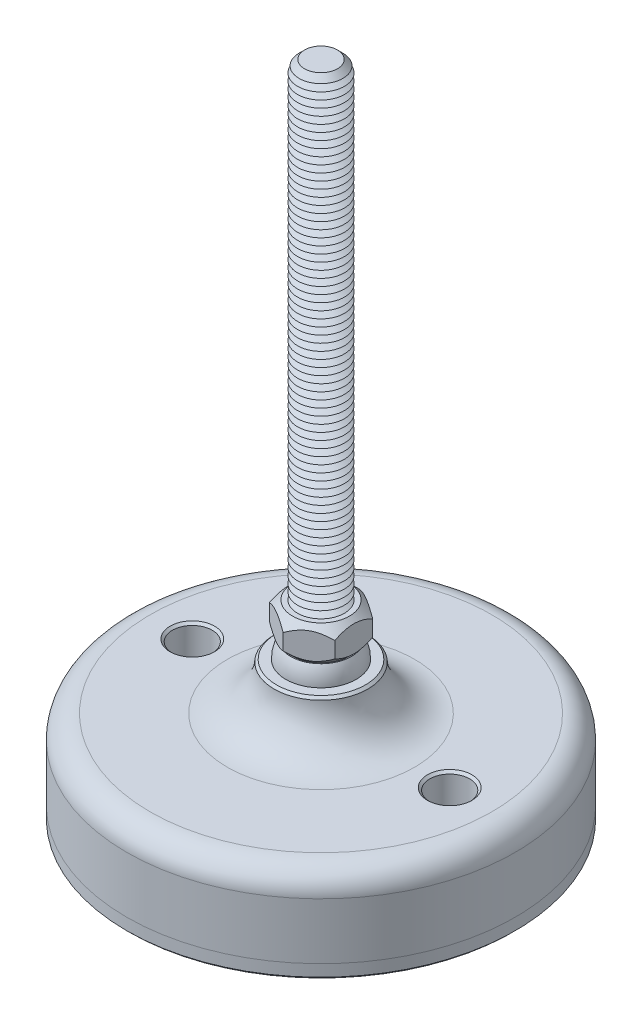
ISO-10303-21;
HEADER;
FILE_DESCRIPTION(('STEP AP214'),'2;1');
FILE_NAME('part.step','',(''),(''),'','','');
FILE_SCHEMA(('AUTOMOTIVE_DESIGN { 1 0 10303 214 1 1 1 1 }'));
ENDSEC;
DATA;
#1=APPLICATION_CONTEXT('core data for automotive mechanical design processes');
#2=APPLICATION_PROTOCOL_DEFINITION('international standard','automotive_design',2000,#1);
#3=PRODUCT_CONTEXT('',#1,'mechanical');
#4=PRODUCT('Part','Part','',(#3));
#5=PRODUCT_RELATED_PRODUCT_CATEGORY('part','',(#4));
#6=PRODUCT_DEFINITION_FORMATION('','',#4);
#7=PRODUCT_DEFINITION_CONTEXT('part definition',#1,'design');
#8=PRODUCT_DEFINITION('design','',#6,#7);
#9=PRODUCT_DEFINITION_SHAPE('','',#8);
#10=(LENGTH_UNIT() NAMED_UNIT(*) SI_UNIT(.MILLI.,.METRE.));
#11=(NAMED_UNIT(*) PLANE_ANGLE_UNIT() SI_UNIT($,.RADIAN.));
#12=(NAMED_UNIT(*) SI_UNIT($,.STERADIAN.) SOLID_ANGLE_UNIT());
#13=UNCERTAINTY_MEASURE_WITH_UNIT(LENGTH_MEASURE(1.E-05),#10,'distance_accuracy_value','');
#14=(GEOMETRIC_REPRESENTATION_CONTEXT(3) GLOBAL_UNCERTAINTY_ASSIGNED_CONTEXT((#13)) GLOBAL_UNIT_ASSIGNED_CONTEXT((#10,
#11,#12)) REPRESENTATION_CONTEXT('',''));
#15=CARTESIAN_POINT('',(0.,0.,0.));
#16=DIRECTION('',(0.,0.,1.));
#17=DIRECTION('',(1.,0.,0.));
#18=AXIS2_PLACEMENT_3D('',#15,#16,#17);
#19=CARTESIAN_POINT('',(0.,-27.,0.));
#20=DIRECTION('',(0.,1.,0.));
#21=DIRECTION('',(0.,0.,1.));
#22=AXIS2_PLACEMENT_3D('',#19,#20,#21);
#23=PLANE('',#22);
#24=CARTESIAN_POINT('',(-27.5,-27.,0.));
#25=DIRECTION('',(0.,1.,0.));
#26=DIRECTION('',(0.,0.,1.));
#27=AXIS2_PLACEMENT_3D('',#24,#25,#26);
#28=CIRCLE('',#27,4.25000000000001);
#29=CARTESIAN_POINT('',(-27.5,-27.,4.25000000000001));
#30=VERTEX_POINT('',#29);
#31=EDGE_CURVE('P0_E43',#30,#30,#28,.T.);
#32=ORIENTED_EDGE('',*,*,#31,.F.);
#33=EDGE_LOOP('',(#32));
#34=FACE_BOUND('',#33,.T.);
#35=CARTESIAN_POINT('',(27.5,-27.,0.));
#36=DIRECTION('',(0.,1.,0.));
#37=DIRECTION('',(0.,0.,1.));
#38=AXIS2_PLACEMENT_3D('',#35,#36,#37);
#39=CIRCLE('',#38,4.25000000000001);
#40=CARTESIAN_POINT('',(27.5,-27.,4.25000000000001));
#41=VERTEX_POINT('',#40);
#42=EDGE_CURVE('P0_E44',#41,#41,#39,.T.);
#43=ORIENTED_EDGE('',*,*,#42,.F.);
#44=EDGE_LOOP('',(#43));
#45=FACE_BOUND('',#44,.T.);
#46=CARTESIAN_POINT('',(0.,-27.,0.));
#47=DIRECTION('',(0.,1.,0.));
#48=DIRECTION('',(0.,0.,1.));
#49=AXIS2_PLACEMENT_3D('',#46,#47,#48);
#50=CIRCLE('',#49,41.5);
#51=CARTESIAN_POINT('',(0.,-27.,41.5));
#52=VERTEX_POINT('',#51);
#53=EDGE_CURVE('P0_E40',#52,#52,#50,.T.);
#54=ORIENTED_EDGE('',*,*,#53,.T.);
#55=EDGE_LOOP('',(#54));
#56=FACE_BOUND('',#55,.T.);
#57=ADVANCED_FACE('P0_F14',(#34,#45,#56),#23,.T.);
#58=CARTESIAN_POINT('',(0.,48.1654938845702,0.));
#59=DIRECTION('',(0.,1.,0.));
#60=DIRECTION('',(0.,0.,1.));
#61=AXIS2_PLACEMENT_3D('',#58,#59,#60);
#62=CYLINDRICAL_SURFACE('',#61,41.5);
#63=CARTESIAN_POINT('',(0.,-29.5,0.));
#64=DIRECTION('',(0.,-1.,0.));
#65=DIRECTION('',(0.,0.,-1.));
#66=AXIS2_PLACEMENT_3D('',#63,#64,#65);
#67=CIRCLE('',#66,41.5);
#68=CARTESIAN_POINT('',(0.,-29.5,-41.5));
#69=VERTEX_POINT('',#68);
#70=EDGE_CURVE('P0_E37',#69,#69,#67,.F.);
#71=ORIENTED_EDGE('',*,*,#70,.T.);
#72=EDGE_LOOP('',(#71));
#73=FACE_BOUND('',#72,.T.);
#74=ORIENTED_EDGE('',*,*,#53,.F.);
#75=EDGE_LOOP('',(#74));
#76=FACE_BOUND('',#75,.T.);
#77=ADVANCED_FACE('P0_F54',(#73,#76),#62,.T.);
#78=CARTESIAN_POINT('',(0.,-30.,41.5));
#79=DIRECTION('',(0.,-1.,0.));
#80=DIRECTION('',(0.,0.,-1.));
#81=AXIS2_PLACEMENT_3D('',#78,#79,#80);
#82=PLANE('',#81);
#83=CARTESIAN_POINT('',(27.5,-30.,0.));
#84=DIRECTION('',(0.,-1.,0.));
#85=DIRECTION('',(0.,0.,-1.));
#86=AXIS2_PLACEMENT_3D('',#83,#84,#85);
#87=CIRCLE('',#86,4.75);
#88=CARTESIAN_POINT('',(27.5,-30.,-4.75000000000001));
#89=VERTEX_POINT('',#88);
#90=EDGE_CURVE('P0_E25',#89,#89,#87,.F.);
#91=ORIENTED_EDGE('',*,*,#90,.T.);
#92=EDGE_LOOP('',(#91));
#93=FACE_BOUND('',#92,.T.);
#94=CARTESIAN_POINT('',(-27.5,-30.,0.));
#95=DIRECTION('',(0.,-1.,0.));
#96=DIRECTION('',(0.,0.,-1.));
#97=AXIS2_PLACEMENT_3D('',#94,#95,#96);
#98=CIRCLE('',#97,4.75);
#99=CARTESIAN_POINT('',(-27.5,-30.,-4.75));
#100=VERTEX_POINT('',#99);
#101=EDGE_CURVE('P0_E29',#100,#100,#98,.F.);
#102=ORIENTED_EDGE('',*,*,#101,.T.);
#103=EDGE_LOOP('',(#102));
#104=FACE_BOUND('',#103,.T.);
#105=CARTESIAN_POINT('',(0.,-30.,0.));
#106=DIRECTION('',(0.,-1.,0.));
#107=DIRECTION('',(0.,0.,-1.));
#108=AXIS2_PLACEMENT_3D('',#105,#106,#107);
#109=CIRCLE('',#108,41.);
#110=CARTESIAN_POINT('',(0.,-30.,-41.));
#111=VERTEX_POINT('',#110);
#112=EDGE_CURVE('P0_E34',#111,#111,#109,.T.);
#113=ORIENTED_EDGE('',*,*,#112,.T.);
#114=EDGE_LOOP('',(#113));
#115=FACE_BOUND('',#114,.T.);
#116=ADVANCED_FACE('P0_F61',(#93,#104,#115),#82,.T.);
#117=CARTESIAN_POINT('',(0.,-29.5,0.));
#118=DIRECTION('',(0.,1.,0.));
#119=DIRECTION('',(0.,0.,1.));
#120=AXIS2_PLACEMENT_3D('',#117,#118,#119);
#121=CONICAL_SURFACE('',#120,41.5,0.785398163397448);
#122=ORIENTED_EDGE('',*,*,#112,.F.);
#123=EDGE_LOOP('',(#122));
#124=FACE_BOUND('',#123,.T.);
#125=ORIENTED_EDGE('',*,*,#70,.F.);
#126=EDGE_LOOP('',(#125));
#127=FACE_BOUND('',#126,.T.);
#128=ADVANCED_FACE('P0_F68',(#124,#127),#121,.T.);
#129=CARTESIAN_POINT('',(27.5,-30.,0.));
#130=DIRECTION('',(0.,1.,0.));
#131=DIRECTION('',(0.,0.,1.));
#132=AXIS2_PLACEMENT_3D('',#129,#130,#131);
#133=CYLINDRICAL_SURFACE('',#132,4.25000000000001);
#134=CARTESIAN_POINT('',(27.5,-29.5,0.));
#135=DIRECTION('',(0.,-1.,0.));
#136=DIRECTION('',(0.,0.,-1.));
#137=AXIS2_PLACEMENT_3D('',#134,#135,#136);
#138=CIRCLE('',#137,4.25000000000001);
#139=CARTESIAN_POINT('',(27.5,-29.5,-4.25000000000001));
#140=VERTEX_POINT('',#139);
#141=EDGE_CURVE('P0_E21',#140,#140,#138,.T.);
#142=ORIENTED_EDGE('',*,*,#141,.T.);
#143=EDGE_LOOP('',(#142));
#144=FACE_BOUND('',#143,.T.);
#145=ORIENTED_EDGE('',*,*,#42,.T.);
#146=EDGE_LOOP('',(#145));
#147=FACE_BOUND('',#146,.T.);
#148=ADVANCED_FACE('P0_F74',(#144,#147),#133,.F.);
#149=CARTESIAN_POINT('',(-27.5,-30.,0.));
#150=DIRECTION('',(0.,1.,0.));
#151=DIRECTION('',(0.,0.,1.));
#152=AXIS2_PLACEMENT_3D('',#149,#150,#151);
#153=CYLINDRICAL_SURFACE('',#152,4.25000000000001);
#154=CARTESIAN_POINT('',(-27.5,-29.5,0.));
#155=DIRECTION('',(0.,-1.,0.));
#156=DIRECTION('',(0.,0.,-1.));
#157=AXIS2_PLACEMENT_3D('',#154,#155,#156);
#158=CIRCLE('',#157,4.25000000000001);
#159=CARTESIAN_POINT('',(-27.5,-29.5,-4.25000000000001));
#160=VERTEX_POINT('',#159);
#161=EDGE_CURVE('P0_E10',#160,#160,#158,.T.);
#162=ORIENTED_EDGE('',*,*,#161,.T.);
#163=EDGE_LOOP('',(#162));
#164=FACE_BOUND('',#163,.T.);
#165=ORIENTED_EDGE('',*,*,#31,.T.);
#166=EDGE_LOOP('',(#165));
#167=FACE_BOUND('',#166,.T.);
#168=ADVANCED_FACE('P0_F50',(#164,#167),#153,.F.);
#169=CARTESIAN_POINT('',(27.5,-30.,0.));
#170=DIRECTION('',(0.,-1.,0.));
#171=DIRECTION('',(0.,0.,-1.));
#172=AXIS2_PLACEMENT_3D('',#169,#170,#171);
#173=CONICAL_SURFACE('',#172,4.75,0.785398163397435);
#174=ORIENTED_EDGE('',*,*,#141,.F.);
#175=EDGE_LOOP('',(#174));
#176=FACE_BOUND('',#175,.T.);
#177=ORIENTED_EDGE('',*,*,#90,.F.);
#178=EDGE_LOOP('',(#177));
#179=FACE_BOUND('',#178,.T.);
#180=ADVANCED_FACE('P0_F76',(#176,#179),#173,.F.);
#181=CARTESIAN_POINT('',(-27.5,-30.,0.));
#182=DIRECTION('',(0.,-1.,0.));
#183=DIRECTION('',(0.,0.,-1.));
#184=AXIS2_PLACEMENT_3D('',#181,#182,#183);
#185=CONICAL_SURFACE('',#184,4.75,0.785398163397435);
#186=ORIENTED_EDGE('',*,*,#161,.F.);
#187=EDGE_LOOP('',(#186));
#188=FACE_BOUND('',#187,.T.);
#189=ORIENTED_EDGE('',*,*,#101,.F.);
#190=EDGE_LOOP('',(#189));
#191=FACE_BOUND('',#190,.T.);
#192=ADVANCED_FACE('P0_F16',(#188,#191),#185,.F.);
#193=CLOSED_SHELL('',(#57,#77,#116,#128,#148,#168,#180,#192));
#194=MANIFOLD_SOLID_BREP('P0_B1',#193);
#195=CARTESIAN_POINT('',(0.,0.,0.));
#196=DIRECTION('',(0.,1.,0.));
#197=DIRECTION('',(0.,0.,-1.));
#198=AXIS2_PLACEMENT_3D('',#195,#196,#197);
#199=SPHERICAL_SURFACE('',#198,7.5);
#200=CARTESIAN_POINT('',(0.,3.75,0.));
#201=DIRECTION('',(0.,-1.,0.));
#202=DIRECTION('',(0.,0.,-1.));
#203=AXIS2_PLACEMENT_3D('',#200,#201,#202);
#204=CIRCLE('',#203,6.49519052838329);
#205=CARTESIAN_POINT('',(0.,3.75,-6.49519052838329));
#206=VERTEX_POINT('',#205);
#207=EDGE_CURVE('P1_E211',#206,#206,#204,.F.);
#208=ORIENTED_EDGE('',*,*,#207,.F.);
#209=EDGE_LOOP('',(#208));
#210=FACE_BOUND('',#209,.T.);
#211=ADVANCED_FACE('P1_F16',(#210),#199,.T.);
#212=CARTESIAN_POINT('',(0.,3.75,0.));
#213=DIRECTION('',(0.,1.,0.));
#214=DIRECTION('',(0.,0.,1.));
#215=AXIS2_PLACEMENT_3D('',#212,#213,#214);
#216=CONICAL_SURFACE('',#215,6.26419292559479,0.785398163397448);
#217=CARTESIAN_POINT('',(0.,3.75,0.));
#218=DIRECTION('',(0.,1.,0.));
#219=DIRECTION('',(0.,0.,1.));
#220=AXIS2_PLACEMENT_3D('',#217,#218,#219);
#221=CIRCLE('',#220,6.26419292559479);
#222=CARTESIAN_POINT('',(0.,3.75,6.26419292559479));
#223=VERTEX_POINT('',#222);
#224=EDGE_CURVE('P1_E215',#223,#223,#221,.T.);
#225=ORIENTED_EDGE('',*,*,#224,.T.);
#226=EDGE_LOOP('',(#225));
#227=FACE_BOUND('',#226,.T.);
#228=CARTESIAN_POINT('',(-7.,8.22175145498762,-8.1400553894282));
#229=CARTESIAN_POINT('',(-7.,8.07177748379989,-7.94220937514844));
#230=CARTESIAN_POINT('',(-7.,7.92322959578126,-7.74326459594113));
#231=CARTESIAN_POINT('',(-7.,7.62962733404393,-7.34274065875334));
#232=CARTESIAN_POINT('',(-7.,7.48457383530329,-7.14116086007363));
#233=CARTESIAN_POINT('',(-7.,7.19756981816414,-6.73345531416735));
#234=CARTESIAN_POINT('',(-7.,7.05565202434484,-6.52730645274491));
#235=CARTESIAN_POINT('',(-7.,6.77703382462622,-6.11152362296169));
#236=CARTESIAN_POINT('',(-7.,6.64033305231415,-5.90188990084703));
#237=CARTESIAN_POINT('',(-7.,6.36550740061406,-5.46619755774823));
#238=CARTESIAN_POINT('',(-7.,6.22776674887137,-5.23989534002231));
#239=CARTESIAN_POINT('',(-7.,5.96123372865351,-4.78200028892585));
#240=CARTESIAN_POINT('',(-7.,5.83244279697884,-4.55040661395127));
#241=CARTESIAN_POINT('',(-7.,5.58658047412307,-4.08193183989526));
#242=CARTESIAN_POINT('',(-7.,5.46947462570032,-3.8450689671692));
#243=CARTESIAN_POINT('',(-7.,5.24960465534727,-3.36483104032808));
#244=CARTESIAN_POINT('',(-7.,5.14683397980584,-3.12145902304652));
#245=CARTESIAN_POINT('',(-7.,4.96723655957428,-2.64866791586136));
#246=CARTESIAN_POINT('',(-7.,4.88895097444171,-2.41980876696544));
#247=CARTESIAN_POINT('',(-7.,4.75072959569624,-1.9565107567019));
#248=CARTESIAN_POINT('',(-7.,4.69079504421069,-1.72207151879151));
#249=CARTESIAN_POINT('',(-7.,4.59342684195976,-1.25295119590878));
#250=CARTESIAN_POINT('',(-7.,4.5556027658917,-1.01835249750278));
#251=CARTESIAN_POINT('',(-7.,4.50320231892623,-0.546559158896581));
#252=CARTESIAN_POINT('',(-7.,4.48862178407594,-0.309364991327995));
#253=CARTESIAN_POINT('',(-7.,4.48382612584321,0.156313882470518));
#254=CARTESIAN_POINT('',(-7.,4.49271264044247,0.384789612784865));
#255=CARTESIAN_POINT('',(-7.,4.53235928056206,0.839822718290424));
#256=CARTESIAN_POINT('',(-7.,4.56312150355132,1.06637990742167));
#257=CARTESIAN_POINT('',(-7.,4.64535130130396,1.51976805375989));
#258=CARTESIAN_POINT('',(-7.,4.69717402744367,1.74653354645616));
#259=CARTESIAN_POINT('',(-7.,4.81873728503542,2.19511331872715));
#260=CARTESIAN_POINT('',(-7.,4.88847641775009,2.41692798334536));
#261=CARTESIAN_POINT('',(-7.,5.04951755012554,2.87389766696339));
#262=CARTESIAN_POINT('',(-7.,5.14215063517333,3.10857869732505));
#263=CARTESIAN_POINT('',(-7.,5.3416605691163,3.57185972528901));
#264=CARTESIAN_POINT('',(-7.,5.44854400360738,3.80045685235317));
#265=CARTESIAN_POINT('',(-7.,5.6740138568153,4.25267813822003));
#266=CARTESIAN_POINT('',(-7.,5.79263686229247,4.47628390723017));
#267=CARTESIAN_POINT('',(-7.,6.03896666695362,4.91835509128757));
#268=CARTESIAN_POINT('',(-7.,6.16667203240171,5.13682131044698));
#269=CARTESIAN_POINT('',(-7.,6.4228595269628,5.55855563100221));
#270=CARTESIAN_POINT('',(-7.,6.55098806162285,5.76203966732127));
#271=CARTESIAN_POINT('',(-7.,6.81264959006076,6.16551366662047));
#272=CARTESIAN_POINT('',(-7.,6.94618299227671,6.36550336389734));
#273=CARTESIAN_POINT('',(-7.,7.21658951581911,6.76082742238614));
#274=CARTESIAN_POINT('',(-7.,7.35342681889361,6.95618637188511));
#275=CARTESIAN_POINT('',(-7.,7.6307324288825,7.34423185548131));
#276=CARTESIAN_POINT('',(-7.,7.77119972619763,7.53691911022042));
#277=CARTESIAN_POINT('',(-7.,7.91315155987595,7.72848711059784));
#278=B_SPLINE_CURVE_WITH_KNOTS('',3,(#228,#229,#230,#231,#232,#233,#234,#235,#236,#237,#238,
#239,#240,#241,#242,#243,#244,#245,#246,#247,#248,#249,#250,#251,#252,#253,#254,#255,#256,#257,
#258,#259,#260,#261,#262,#263,#264,#265,#266,#267,#268,#269,#270,#271,#272,#273,#274,#275,#276,
#277),.UNSPECIFIED.,.F.,.F.,(4,2,2,2,2,2,2,2,2,2,2,2,2,2,2,2,2,2,2,2,2,2,2,2,4),(0.,
0.744807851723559,1.48980030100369,2.2405614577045,2.99126978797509,3.78587980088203,
4.58061708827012,5.37293691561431,6.16489332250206,6.88989369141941,7.61494312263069,
8.32676947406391,9.0384682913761,9.72332048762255,10.4082383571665,11.1052200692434,
11.8021473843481,12.5584650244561,13.3151334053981,14.0742390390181,14.8332251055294,
15.5545151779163,16.2758598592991,16.9913609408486,17.7066651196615),.UNSPECIFIED.);
#279=CARTESIAN_POINT('',(-7.,5.56871084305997,-4.04145188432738));
#280=VERTEX_POINT('',#279);
#281=CARTESIAN_POINT('',(-7.,5.56871084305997,4.04145188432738));
#282=VERTEX_POINT('',#281);
#283=EDGE_CURVE('P1_E25',#280,#282,#278,.T.);
#284=ORIENTED_EDGE('',*,*,#283,.F.);
#285=CARTESIAN_POINT('',(0.000199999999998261,5.56882631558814,-8.0830192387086));
#286=CARTESIAN_POINT('',(-0.120159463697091,5.49934419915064,-8.01352966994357));
#287=CARTESIAN_POINT('',(-0.241444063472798,5.43199440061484,-7.94350597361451));
#288=CARTESIAN_POINT('',(-0.486045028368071,5.30220807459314,-7.80228554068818));
#289=CARTESIAN_POINT('',(-0.60936245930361,5.2397742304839,-7.73108818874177));
#290=CARTESIAN_POINT('',(-0.983781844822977,5.06028719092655,-7.51491705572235));
#291=CARTESIAN_POINT('',(-1.23805341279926,4.95181416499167,-7.36811329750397));
#292=CARTESIAN_POINT('',(-1.75081233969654,4.76606165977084,-7.07207179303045));
#293=CARTESIAN_POINT('',(-2.00916864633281,4.68831421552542,-6.92290970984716));
#294=CARTESIAN_POINT('',(-2.40095049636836,4.59837958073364,-6.69671435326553));
#295=CARTESIAN_POINT('',(-2.53212124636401,4.57286115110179,-6.62098288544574));
#296=CARTESIAN_POINT('',(-2.79557335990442,4.53129725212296,-6.4688787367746));
#297=CARTESIAN_POINT('',(-2.92785455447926,4.5152503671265,-6.39250615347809));
#298=CARTESIAN_POINT('',(-3.25020698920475,4.48834537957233,-6.2063958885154));
#299=CARTESIAN_POINT('',(-3.44062555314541,4.48270029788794,-6.09645767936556));
#300=CARTESIAN_POINT('',(-3.82111946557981,4.49217587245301,-5.87677941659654));
#301=CARTESIAN_POINT('',(-4.01119467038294,4.5073038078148,-5.76703944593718));
#302=CARTESIAN_POINT('',(-4.38955306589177,4.55743368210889,-5.54859412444));
#303=CARTESIAN_POINT('',(-4.57783401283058,4.5924578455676,-5.43989006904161));
#304=CARTESIAN_POINT('',(-4.95115981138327,4.68047604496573,-5.22435031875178));
#305=CARTESIAN_POINT('',(-5.13620490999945,4.73346870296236,-5.1175144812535));
#306=CARTESIAN_POINT('',(-5.46469033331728,4.84248989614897,-4.92786333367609));
#307=CARTESIAN_POINT('',(-5.6088580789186,4.89565100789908,-4.8446280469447));
#308=CARTESIAN_POINT('',(-5.8946056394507,5.0105398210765,-4.67965161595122));
#309=CARTESIAN_POINT('',(-6.03618537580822,5.07226778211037,-4.5979105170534));
#310=CARTESIAN_POINT('',(-6.31631098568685,5.20290661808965,-4.43617992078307));
#311=CARTESIAN_POINT('',(-6.4548648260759,5.27179490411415,-4.3561858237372));
#312=CARTESIAN_POINT('',(-6.72940692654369,5.41585000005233,-4.19767886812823));
#313=CARTESIAN_POINT('',(-6.86539669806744,5.49101295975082,-4.11916513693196));
#314=CARTESIAN_POINT('',(-7.0002,5.56882631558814,-4.04133641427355));
#315=B_SPLINE_CURVE_WITH_KNOTS('',3,(#285,#286,#287,#288,#289,#290,#291,#292,#293,#294,#295,
#296,#297,#298,#299,#300,#301,#302,#303,#304,#305,#306,#307,#308,#309,#310,#311,#312,#313,#314),
.UNSPECIFIED.,.F.,.F.,(4,2,2,2,2,2,2,2,2,2,2,2,2,2,4),(0.,0.466112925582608,0.932478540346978,
1.87024464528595,2.79312018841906,3.25365289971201,3.71411676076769,4.37293813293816,
5.03199042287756,5.69178034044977,6.35151967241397,6.8755322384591,7.39956068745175,
7.92198344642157,8.44408796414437),.UNSPECIFIED.);
#316=CARTESIAN_POINT('',(0.,5.56871084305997,-8.08290376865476));
#317=VERTEX_POINT('',#316);
#318=EDGE_CURVE('P1_E116',#317,#280,#315,.T.);
#319=ORIENTED_EDGE('',*,*,#318,.F.);
#320=CARTESIAN_POINT('',(7.00019999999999,5.56882631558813,-4.04133641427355));
#321=CARTESIAN_POINT('',(6.8798405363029,5.49934419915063,-4.11082598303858));
#322=CARTESIAN_POINT('',(6.7585559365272,5.43199440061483,-4.18084967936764));
#323=CARTESIAN_POINT('',(6.51395497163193,5.30220807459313,-4.32207011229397));
#324=CARTESIAN_POINT('',(6.39063754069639,5.2397742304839,-4.39326746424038));
#325=CARTESIAN_POINT('',(6.01621815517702,5.06028719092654,-4.6094385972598));
#326=CARTESIAN_POINT('',(5.76194658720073,4.95181416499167,-4.75624235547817));
#327=CARTESIAN_POINT('',(5.24918766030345,4.76606165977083,-5.0522838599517));
#328=CARTESIAN_POINT('',(4.99083135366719,4.68831421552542,-5.20144594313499));
#329=CARTESIAN_POINT('',(4.59904950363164,4.59837958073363,-5.42764129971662));
#330=CARTESIAN_POINT('',(4.46787875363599,4.57286115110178,-5.50337276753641));
#331=CARTESIAN_POINT('',(4.20442664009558,4.53129725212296,-5.65547691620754));
#332=CARTESIAN_POINT('',(4.07214544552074,4.5152503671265,-5.73184949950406));
#333=CARTESIAN_POINT('',(3.74979301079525,4.48834537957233,-5.91795976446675));
#334=CARTESIAN_POINT('',(3.55937444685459,4.48270029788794,-6.02789797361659));
#335=CARTESIAN_POINT('',(3.17888053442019,4.49217587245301,-6.2475762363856));
#336=CARTESIAN_POINT('',(2.98880532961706,4.5073038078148,-6.35731620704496));
#337=CARTESIAN_POINT('',(2.61044693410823,4.55743368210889,-6.57576152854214));
#338=CARTESIAN_POINT('',(2.42216598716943,4.5924578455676,-6.68446558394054));
#339=CARTESIAN_POINT('',(2.04884018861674,4.68047604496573,-6.90000533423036));
#340=CARTESIAN_POINT('',(1.86379509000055,4.73346870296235,-7.00684117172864));
#341=CARTESIAN_POINT('',(1.53530966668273,4.84248989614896,-7.19649231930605));
#342=CARTESIAN_POINT('',(1.3911419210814,4.89565100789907,-7.27972760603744));
#343=CARTESIAN_POINT('',(1.1053943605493,5.0105398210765,-7.44470403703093));
#344=CARTESIAN_POINT('',(0.96381462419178,5.07226778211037,-7.52644513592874));
#345=CARTESIAN_POINT('',(0.683689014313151,5.20290661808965,-7.68817573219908));
#346=CARTESIAN_POINT('',(0.545135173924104,5.27179490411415,-7.76816982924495));
#347=CARTESIAN_POINT('',(0.270593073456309,5.41585000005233,-7.92667678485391));
#348=CARTESIAN_POINT('',(0.134603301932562,5.49101295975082,-8.00519051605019));
#349=CARTESIAN_POINT('',(-0.00020000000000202,5.56882631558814,-8.0830192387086));
#350=B_SPLINE_CURVE_WITH_KNOTS('',3,(#320,#321,#322,#323,#324,#325,#326,#327,#328,#329,#330,
#331,#332,#333,#334,#335,#336,#337,#338,#339,#340,#341,#342,#343,#344,#345,#346,#347,#348,#349),
.UNSPECIFIED.,.F.,.F.,(4,2,2,2,2,2,2,2,2,2,2,2,2,2,4),(0.,0.466112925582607,0.932478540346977,
1.87024464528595,2.79312018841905,3.25365289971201,3.71411676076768,4.37293813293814,
5.03199042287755,5.69178034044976,6.35151967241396,6.87553223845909,7.39956068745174,
7.92198344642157,8.44408796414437),.UNSPECIFIED.);
#351=CARTESIAN_POINT('',(7.,5.56871084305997,-4.04145188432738));
#352=VERTEX_POINT('',#351);
#353=EDGE_CURVE('P1_E123',#352,#317,#350,.T.);
#354=ORIENTED_EDGE('',*,*,#353,.F.);
#355=CARTESIAN_POINT('',(6.99999999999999,8.22175145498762,-8.1400553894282));
#356=CARTESIAN_POINT('',(6.99999999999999,8.07177748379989,-7.94220937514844));
#357=CARTESIAN_POINT('',(6.99999999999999,7.92322959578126,-7.74326459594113));
#358=CARTESIAN_POINT('',(6.99999999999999,7.62962733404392,-7.34274065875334));
#359=CARTESIAN_POINT('',(6.99999999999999,7.48457383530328,-7.14116086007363));
#360=CARTESIAN_POINT('',(6.99999999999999,7.19756981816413,-6.73345531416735));
#361=CARTESIAN_POINT('',(6.99999999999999,7.05565202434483,-6.52730645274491));
#362=CARTESIAN_POINT('',(6.99999999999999,6.77703382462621,-6.11152362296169));
#363=CARTESIAN_POINT('',(6.99999999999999,6.64033305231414,-5.90188990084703));
#364=CARTESIAN_POINT('',(6.99999999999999,6.36550740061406,-5.46619755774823));
#365=CARTESIAN_POINT('',(6.99999999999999,6.22776674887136,-5.23989534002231));
#366=CARTESIAN_POINT('',(6.99999999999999,5.9612337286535,-4.78200028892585));
#367=CARTESIAN_POINT('',(6.99999999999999,5.83244279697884,-4.55040661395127));
#368=CARTESIAN_POINT('',(6.99999999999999,5.58658047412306,-4.08193183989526));
#369=CARTESIAN_POINT('',(6.99999999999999,5.46947462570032,-3.8450689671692));
#370=CARTESIAN_POINT('',(6.99999999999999,5.24960465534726,-3.36483104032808));
#371=CARTESIAN_POINT('',(6.99999999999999,5.14683397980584,-3.12145902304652));
#372=CARTESIAN_POINT('',(6.99999999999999,4.96723655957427,-2.64866791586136));
#373=CARTESIAN_POINT('',(6.99999999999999,4.88895097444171,-2.41980876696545));
#374=CARTESIAN_POINT('',(6.99999999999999,4.75072959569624,-1.9565107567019));
#375=CARTESIAN_POINT('',(6.99999999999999,4.69079504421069,-1.72207151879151));
#376=CARTESIAN_POINT('',(6.99999999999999,4.59342684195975,-1.25295119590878));
#377=CARTESIAN_POINT('',(6.99999999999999,4.5556027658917,-1.01835249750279));
#378=CARTESIAN_POINT('',(6.99999999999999,4.50320231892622,-0.546559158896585));
#379=CARTESIAN_POINT('',(6.99999999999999,4.48862178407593,-0.309364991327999));
#380=CARTESIAN_POINT('',(6.99999999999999,4.48382612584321,0.156313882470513));
#381=CARTESIAN_POINT('',(6.99999999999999,4.49271264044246,0.38478961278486));
#382=CARTESIAN_POINT('',(6.99999999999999,4.53235928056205,0.83982271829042));
#383=CARTESIAN_POINT('',(6.99999999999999,4.56312150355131,1.06637990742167));
#384=CARTESIAN_POINT('',(6.99999999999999,4.64535130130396,1.51976805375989));
#385=CARTESIAN_POINT('',(6.99999999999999,4.69717402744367,1.74653354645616));
#386=CARTESIAN_POINT('',(6.99999999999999,4.81873728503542,2.19511331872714));
#387=CARTESIAN_POINT('',(7.,4.88847641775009,2.41692798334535));
#388=CARTESIAN_POINT('',(7.,5.04951755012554,2.87389766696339));
#389=CARTESIAN_POINT('',(7.,5.14215063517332,3.10857869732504));
#390=CARTESIAN_POINT('',(7.,5.34166056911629,3.571859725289));
#391=CARTESIAN_POINT('',(7.,5.44854400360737,3.80045685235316));
#392=CARTESIAN_POINT('',(7.,5.67401385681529,4.25267813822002));
#393=CARTESIAN_POINT('',(7.,5.79263686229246,4.47628390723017));
#394=CARTESIAN_POINT('',(7.,6.03896666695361,4.91835509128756));
#395=CARTESIAN_POINT('',(7.,6.1666720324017,5.13682131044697));
#396=CARTESIAN_POINT('',(7.,6.42285952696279,5.5585556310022));
#397=CARTESIAN_POINT('',(7.,6.55098806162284,5.76203966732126));
#398=CARTESIAN_POINT('',(7.,6.81264959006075,6.16551366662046));
#399=CARTESIAN_POINT('',(7.,6.9461829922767,6.36550336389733));
#400=CARTESIAN_POINT('',(7.,7.21658951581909,6.76082742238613));
#401=CARTESIAN_POINT('',(7.,7.3534268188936,6.9561863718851));
#402=CARTESIAN_POINT('',(7.,7.63073242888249,7.3442318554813));
#403=CARTESIAN_POINT('',(7.,7.77119972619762,7.53691911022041));
#404=CARTESIAN_POINT('',(7.,7.91315155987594,7.72848711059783));
#405=B_SPLINE_CURVE_WITH_KNOTS('',3,(#355,#356,#357,#358,#359,#360,#361,#362,#363,#364,#365,
#366,#367,#368,#369,#370,#371,#372,#373,#374,#375,#376,#377,#378,#379,#380,#381,#382,#383,#384,
#385,#386,#387,#388,#389,#390,#391,#392,#393,#394,#395,#396,#397,#398,#399,#400,#401,#402,#403,
#404),.UNSPECIFIED.,.F.,.F.,(4,2,2,2,2,2,2,2,2,2,2,2,2,2,2,2,2,2,2,2,2,2,2,2,4),(0.,
0.744807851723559,1.48980030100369,2.2405614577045,2.9912697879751,3.78587980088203,
4.58061708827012,5.3729369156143,6.16489332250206,6.8898936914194,7.61494312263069,
8.32676947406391,9.03846829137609,9.72332048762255,10.4082383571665,11.1052200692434,
11.8021473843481,12.5584650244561,13.3151334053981,14.0742390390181,14.8332251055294,
15.5545151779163,16.275859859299,16.9913609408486,17.7066651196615),.UNSPECIFIED.);
#406=CARTESIAN_POINT('',(6.99999999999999,5.56871084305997,4.04145188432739));
#407=VERTEX_POINT('',#406);
#408=EDGE_CURVE('P1_E71',#407,#352,#405,.F.);
#409=ORIENTED_EDGE('',*,*,#408,.F.);
#410=CARTESIAN_POINT('',(-0.000200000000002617,5.56882631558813,8.0830192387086));
#411=CARTESIAN_POINT('',(0.120159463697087,5.49934419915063,8.01352966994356));
#412=CARTESIAN_POINT('',(0.241444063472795,5.43199440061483,7.9435059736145));
#413=CARTESIAN_POINT('',(0.486045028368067,5.30220807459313,7.80228554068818));
#414=CARTESIAN_POINT('',(0.609362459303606,5.2397742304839,7.73108818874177));
#415=CARTESIAN_POINT('',(0.983781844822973,5.06028719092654,7.51491705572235));
#416=CARTESIAN_POINT('',(1.23805341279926,4.95181416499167,7.36811329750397));
#417=CARTESIAN_POINT('',(1.75081233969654,4.76606165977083,7.07207179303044));
#418=CARTESIAN_POINT('',(2.00916864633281,4.68831421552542,6.92290970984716));
#419=CARTESIAN_POINT('',(2.40095049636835,4.59837958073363,6.69671435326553));
#420=CARTESIAN_POINT('',(2.53212124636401,4.57286115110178,6.62098288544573));
#421=CARTESIAN_POINT('',(2.79557335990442,4.53129725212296,6.4688787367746));
#422=CARTESIAN_POINT('',(2.92785455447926,4.5152503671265,6.39250615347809));
#423=CARTESIAN_POINT('',(3.25020698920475,4.48834537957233,6.2063958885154));
#424=CARTESIAN_POINT('',(3.44062555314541,4.48270029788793,6.09645767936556));
#425=CARTESIAN_POINT('',(3.82111946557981,4.492175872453,5.87677941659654));
#426=CARTESIAN_POINT('',(4.01119467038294,4.5073038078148,5.76703944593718));
#427=CARTESIAN_POINT('',(4.38955306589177,4.55743368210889,5.54859412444));
#428=CARTESIAN_POINT('',(4.57783401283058,4.5924578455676,5.4398900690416));
#429=CARTESIAN_POINT('',(4.95115981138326,4.68047604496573,5.22435031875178));
#430=CARTESIAN_POINT('',(5.13620490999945,4.73346870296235,5.1175144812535));
#431=CARTESIAN_POINT('',(5.46469033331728,4.84248989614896,4.92786333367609));
#432=CARTESIAN_POINT('',(5.6088580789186,4.89565100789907,4.8446280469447));
#433=CARTESIAN_POINT('',(5.8946056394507,5.01053982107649,4.67965161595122));
#434=CARTESIAN_POINT('',(6.03618537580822,5.07226778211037,4.5979105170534));
#435=CARTESIAN_POINT('',(6.31631098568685,5.20290661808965,4.43617992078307));
#436=CARTESIAN_POINT('',(6.45486482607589,5.27179490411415,4.3561858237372));
#437=CARTESIAN_POINT('',(6.72940692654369,5.41585000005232,4.19767886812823));
#438=CARTESIAN_POINT('',(6.86539669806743,5.49101295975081,4.11916513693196));
#439=CARTESIAN_POINT('',(7.00019999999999,5.56882631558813,4.04133641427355));
#440=B_SPLINE_CURVE_WITH_KNOTS('',3,(#410,#411,#412,#413,#414,#415,#416,#417,#418,#419,#420,
#421,#422,#423,#424,#425,#426,#427,#428,#429,#430,#431,#432,#433,#434,#435,#436,#437,#438,#439),
.UNSPECIFIED.,.F.,.F.,(4,2,2,2,2,2,2,2,2,2,2,2,2,2,4),(0.,0.466112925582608,0.932478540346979,
1.87024464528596,2.79312018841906,3.25365289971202,3.71411676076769,4.37293813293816,
5.03199042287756,5.69178034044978,6.35151967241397,6.8755322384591,7.39956068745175,
7.92198344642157,8.44408796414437),.UNSPECIFIED.);
#441=CARTESIAN_POINT('',(0.,5.56871084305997,8.08290376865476));
#442=VERTEX_POINT('',#441);
#443=EDGE_CURVE('P1_E68',#442,#407,#440,.T.);
#444=ORIENTED_EDGE('',*,*,#443,.F.);
#445=CARTESIAN_POINT('',(-7.0002,5.56882631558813,4.04133641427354));
#446=CARTESIAN_POINT('',(-6.87984053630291,5.49934419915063,4.11082598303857));
#447=CARTESIAN_POINT('',(-6.7585559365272,5.43199440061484,4.18084967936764));
#448=CARTESIAN_POINT('',(-6.51395497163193,5.30220807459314,4.32207011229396));
#449=CARTESIAN_POINT('',(-6.39063754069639,5.2397742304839,4.39326746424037));
#450=CARTESIAN_POINT('',(-6.01621815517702,5.06028719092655,4.60943859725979));
#451=CARTESIAN_POINT('',(-5.76194658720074,4.95181416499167,4.75624235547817));
#452=CARTESIAN_POINT('',(-5.24918766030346,4.76606165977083,5.0522838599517));
#453=CARTESIAN_POINT('',(-4.99083135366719,4.68831421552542,5.20144594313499));
#454=CARTESIAN_POINT('',(-4.59904950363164,4.59837958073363,5.42764129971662));
#455=CARTESIAN_POINT('',(-4.46787875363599,4.57286115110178,5.50337276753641));
#456=CARTESIAN_POINT('',(-4.20442664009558,4.53129725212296,5.65547691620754));
#457=CARTESIAN_POINT('',(-4.07214544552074,4.5152503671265,5.73184949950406));
#458=CARTESIAN_POINT('',(-3.74979301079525,4.48834537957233,5.91795976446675));
#459=CARTESIAN_POINT('',(-3.55937444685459,4.48270029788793,6.02789797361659));
#460=CARTESIAN_POINT('',(-3.17888053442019,4.492175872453,6.2475762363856));
#461=CARTESIAN_POINT('',(-2.98880532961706,4.5073038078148,6.35731620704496));
#462=CARTESIAN_POINT('',(-2.61044693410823,4.55743368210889,6.57576152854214));
#463=CARTESIAN_POINT('',(-2.42216598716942,4.5924578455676,6.68446558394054));
#464=CARTESIAN_POINT('',(-2.04884018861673,4.68047604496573,6.90000533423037));
#465=CARTESIAN_POINT('',(-1.86379509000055,4.73346870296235,7.00684117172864));
#466=CARTESIAN_POINT('',(-1.53530966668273,4.84248989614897,7.19649231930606));
#467=CARTESIAN_POINT('',(-1.3911419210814,4.89565100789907,7.27972760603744));
#468=CARTESIAN_POINT('',(-1.1053943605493,5.01053982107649,7.44470403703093));
#469=CARTESIAN_POINT('',(-0.963814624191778,5.07226778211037,7.52644513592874));
#470=CARTESIAN_POINT('',(-0.683689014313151,5.20290661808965,7.68817573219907));
#471=CARTESIAN_POINT('',(-0.545135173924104,5.27179490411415,7.76816982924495));
#472=CARTESIAN_POINT('',(-0.270593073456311,5.41585000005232,7.92667678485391));
#473=CARTESIAN_POINT('',(-0.134603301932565,5.49101295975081,8.00519051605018));
#474=CARTESIAN_POINT('',(0.000199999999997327,5.56882631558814,8.0830192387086));
#475=B_SPLINE_CURVE_WITH_KNOTS('',3,(#445,#446,#447,#448,#449,#450,#451,#452,#453,#454,#455,
#456,#457,#458,#459,#460,#461,#462,#463,#464,#465,#466,#467,#468,#469,#470,#471,#472,#473,#474),
.UNSPECIFIED.,.F.,.F.,(4,2,2,2,2,2,2,2,2,2,2,2,2,2,4),(0.,0.466112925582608,0.93247854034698,
1.87024464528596,2.79312018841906,3.25365289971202,3.71411676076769,4.37293813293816,
5.03199042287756,5.69178034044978,6.35151967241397,6.8755322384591,7.39956068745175,
7.92198344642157,8.44408796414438),.UNSPECIFIED.);
#476=EDGE_CURVE('P1_E40',#282,#442,#475,.T.);
#477=ORIENTED_EDGE('',*,*,#476,.F.);
#478=EDGE_LOOP('',(#284,#319,#354,#409,#444,#477));
#479=FACE_BOUND('',#478,.T.);
#480=ADVANCED_FACE('P1_F69',(#227,#479),#216,.T.);
#481=CARTESIAN_POINT('',(0.,3.75,6.26419292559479));
#482=DIRECTION('',(0.,-1.,0.));
#483=DIRECTION('',(0.,0.,-1.));
#484=AXIS2_PLACEMENT_3D('',#481,#482,#483);
#485=PLANE('',#484);
#486=ORIENTED_EDGE('',*,*,#207,.T.);
#487=EDGE_LOOP('',(#486));
#488=FACE_BOUND('',#487,.T.);
#489=ORIENTED_EDGE('',*,*,#224,.F.);
#490=EDGE_LOOP('',(#489));
#491=FACE_BOUND('',#490,.T.);
#492=ADVANCED_FACE('P1_F107',(#488,#491),#485,.F.);
#493=CARTESIAN_POINT('',(-7.,11.,4.04145188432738));
#494=DIRECTION('',(0.5,0.,-0.866025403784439));
#495=DIRECTION('',(-0.866025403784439,0.,-0.5));
#496=AXIS2_PLACEMENT_3D('',#493,#494,#495);
#497=PLANE('',#496);
#498=DIRECTION('',(0.,-1.,0.));
#499=VECTOR('',#498,1.);
#500=CARTESIAN_POINT('',(0.,11.,8.08290376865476));
#501=LINE('',#500,#499);
#502=CARTESIAN_POINT('',(0.,8.97927405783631,8.08290376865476));
#503=VERTEX_POINT('',#502);
#504=EDGE_CURVE('P1_E82',#503,#442,#501,.T.);
#505=ORIENTED_EDGE('',*,*,#504,.F.);
#506=CARTESIAN_POINT('',(0.000199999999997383,8.97915858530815,8.0830192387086));
#507=CARTESIAN_POINT('',(-0.120159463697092,9.04864070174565,8.01352966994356));
#508=CARTESIAN_POINT('',(-0.241444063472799,9.11599050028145,7.9435059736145));
#509=CARTESIAN_POINT('',(-0.486045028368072,9.24577682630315,7.80228554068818));
#510=CARTESIAN_POINT('',(-0.609362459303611,9.30821067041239,7.73108818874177));
#511=CARTESIAN_POINT('',(-0.983781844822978,9.48769770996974,7.51491705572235));
#512=CARTESIAN_POINT('',(-1.23805341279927,9.59617073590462,7.36811329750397));
#513=CARTESIAN_POINT('',(-1.75081233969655,9.78192324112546,7.07207179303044));
#514=CARTESIAN_POINT('',(-2.00916864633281,9.85967068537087,6.92290970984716));
#515=CARTESIAN_POINT('',(-2.40095049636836,9.94960532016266,6.69671435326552));
#516=CARTESIAN_POINT('',(-2.53212124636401,9.9751237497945,6.62098288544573));
#517=CARTESIAN_POINT('',(-2.79557335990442,10.0166876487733,6.4688787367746));
#518=CARTESIAN_POINT('',(-2.92785455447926,10.0327345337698,6.39250615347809));
#519=CARTESIAN_POINT('',(-3.25020698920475,10.059639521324,6.2063958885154));
#520=CARTESIAN_POINT('',(-3.44062555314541,10.0652846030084,6.09645767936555));
#521=CARTESIAN_POINT('',(-3.82111946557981,10.0558090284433,5.87677941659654));
#522=CARTESIAN_POINT('',(-4.01119467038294,10.0406810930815,5.76703944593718));
#523=CARTESIAN_POINT('',(-4.38955306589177,9.9905512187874,5.54859412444));
#524=CARTESIAN_POINT('',(-4.57783401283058,9.95552705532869,5.4398900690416));
#525=CARTESIAN_POINT('',(-4.95115981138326,9.86750885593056,5.22435031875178));
#526=CARTESIAN_POINT('',(-5.13620490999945,9.81451619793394,5.1175144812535));
#527=CARTESIAN_POINT('',(-5.46469033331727,9.70549500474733,4.92786333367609));
#528=CARTESIAN_POINT('',(-5.6088580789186,9.65233389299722,4.8446280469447));
#529=CARTESIAN_POINT('',(-5.8946056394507,9.5374450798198,4.67965161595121));
#530=CARTESIAN_POINT('',(-6.03618537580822,9.47571711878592,4.5979105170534));
#531=CARTESIAN_POINT('',(-6.31631098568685,9.34507828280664,4.43617992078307));
#532=CARTESIAN_POINT('',(-6.4548648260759,9.27618999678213,4.35618582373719));
#533=CARTESIAN_POINT('',(-6.72940692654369,9.13213490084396,4.19767886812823));
#534=CARTESIAN_POINT('',(-6.86539669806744,9.05697194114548,4.11916513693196));
#535=CARTESIAN_POINT('',(-7.0002,8.97915858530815,4.04133641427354));
#536=B_SPLINE_CURVE_WITH_KNOTS('',3,(#506,#507,#508,#509,#510,#511,#512,#513,#514,#515,#516,
#517,#518,#519,#520,#521,#522,#523,#524,#525,#526,#527,#528,#529,#530,#531,#532,#533,#534,#535),
.UNSPECIFIED.,.F.,.F.,(4,2,2,2,2,2,2,2,2,2,2,2,2,2,4),(0.,0.466112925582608,0.932478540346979,
1.87024464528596,2.79312018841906,3.25365289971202,3.71411676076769,4.37293813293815,
5.03199042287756,5.69178034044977,6.35151967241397,6.87553223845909,7.39956068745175,
7.92198344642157,8.44408796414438),.UNSPECIFIED.);
#537=CARTESIAN_POINT('',(-7.,8.97927405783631,4.04145188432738));
#538=VERTEX_POINT('',#537);
#539=EDGE_CURVE('P1_E153',#503,#538,#536,.T.);
#540=ORIENTED_EDGE('',*,*,#539,.T.);
#541=DIRECTION('',(0.,-1.,0.));
#542=VECTOR('',#541,1.);
#543=CARTESIAN_POINT('',(-7.,11.,4.04145188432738));
#544=LINE('',#543,#542);
#545=EDGE_CURVE('P1_E84',#538,#282,#544,.T.);
#546=ORIENTED_EDGE('',*,*,#545,.T.);
#547=ORIENTED_EDGE('',*,*,#476,.T.);
#548=EDGE_LOOP('',(#505,#540,#546,#547));
#549=FACE_BOUND('',#548,.T.);
#550=ADVANCED_FACE('P1_F80',(#549),#497,.F.);
#551=CARTESIAN_POINT('',(0.,11.,8.08290376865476));
#552=DIRECTION('',(-0.5,0.,-0.866025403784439));
#553=DIRECTION('',(-0.866025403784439,0.,0.5));
#554=AXIS2_PLACEMENT_3D('',#551,#552,#553);
#555=PLANE('',#554);
#556=DIRECTION('',(0.,-1.,0.));
#557=VECTOR('',#556,1.);
#558=CARTESIAN_POINT('',(7.,11.,4.04145188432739));
#559=LINE('',#558,#557);
#560=CARTESIAN_POINT('',(7.,8.97927405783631,4.04145188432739));
#561=VERTEX_POINT('',#560);
#562=EDGE_CURVE('P1_E89',#561,#407,#559,.T.);
#563=ORIENTED_EDGE('',*,*,#562,.F.);
#564=CARTESIAN_POINT('',(7.0002,8.97915858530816,4.04133641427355));
#565=CARTESIAN_POINT('',(6.87984053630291,9.04864070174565,4.11082598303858));
#566=CARTESIAN_POINT('',(6.7585559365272,9.11599050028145,4.18084967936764));
#567=CARTESIAN_POINT('',(6.51395497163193,9.24577682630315,4.32207011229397));
#568=CARTESIAN_POINT('',(6.39063754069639,9.30821067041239,4.39326746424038));
#569=CARTESIAN_POINT('',(6.01621815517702,9.48769770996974,4.6094385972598));
#570=CARTESIAN_POINT('',(5.76194658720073,9.59617073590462,4.75624235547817));
#571=CARTESIAN_POINT('',(5.24918766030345,9.78192324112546,5.0522838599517));
#572=CARTESIAN_POINT('',(4.99083135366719,9.85967068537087,5.20144594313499));
#573=CARTESIAN_POINT('',(4.59904950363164,9.94960532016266,5.42764129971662));
#574=CARTESIAN_POINT('',(4.46787875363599,9.9751237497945,5.50337276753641));
#575=CARTESIAN_POINT('',(4.20442664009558,10.0166876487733,5.65547691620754));
#576=CARTESIAN_POINT('',(4.07214544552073,10.0327345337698,5.73184949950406));
#577=CARTESIAN_POINT('',(3.74979301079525,10.059639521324,5.91795976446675));
#578=CARTESIAN_POINT('',(3.55937444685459,10.0652846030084,6.02789797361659));
#579=CARTESIAN_POINT('',(3.17888053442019,10.0558090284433,6.2475762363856));
#580=CARTESIAN_POINT('',(2.98880532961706,10.0406810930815,6.35731620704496));
#581=CARTESIAN_POINT('',(2.61044693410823,9.9905512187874,6.57576152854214));
#582=CARTESIAN_POINT('',(2.42216598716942,9.95552705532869,6.68446558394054));
#583=CARTESIAN_POINT('',(2.04884018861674,9.86750885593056,6.90000533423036));
#584=CARTESIAN_POINT('',(1.86379509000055,9.81451619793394,7.00684117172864));
#585=CARTESIAN_POINT('',(1.53530966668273,9.70549500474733,7.19649231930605));
#586=CARTESIAN_POINT('',(1.3911419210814,9.65233389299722,7.27972760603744));
#587=CARTESIAN_POINT('',(1.1053943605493,9.5374450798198,7.44470403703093));
#588=CARTESIAN_POINT('',(0.963814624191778,9.47571711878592,7.52644513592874));
#589=CARTESIAN_POINT('',(0.683689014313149,9.34507828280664,7.68817573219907));
#590=CARTESIAN_POINT('',(0.545135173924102,9.27618999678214,7.76816982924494));
#591=CARTESIAN_POINT('',(0.270593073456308,9.13213490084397,7.92667678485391));
#592=CARTESIAN_POINT('',(0.134603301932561,9.05697194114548,8.00519051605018));
#593=CARTESIAN_POINT('',(-0.000200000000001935,8.97915858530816,8.0830192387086));
#594=B_SPLINE_CURVE_WITH_KNOTS('',3,(#564,#565,#566,#567,#568,#569,#570,#571,#572,#573,#574,
#575,#576,#577,#578,#579,#580,#581,#582,#583,#584,#585,#586,#587,#588,#589,#590,#591,#592,#593),
.UNSPECIFIED.,.F.,.F.,(4,2,2,2,2,2,2,2,2,2,2,2,2,2,4),(0.,0.466112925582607,0.932478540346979,
1.87024464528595,2.79312018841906,3.25365289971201,3.71411676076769,4.37293813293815,
5.03199042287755,5.69178034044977,6.35151967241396,6.87553223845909,7.39956068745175,
7.92198344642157,8.44408796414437),.UNSPECIFIED.);
#595=EDGE_CURVE('P1_E88',#561,#503,#594,.T.);
#596=ORIENTED_EDGE('',*,*,#595,.T.);
#597=ORIENTED_EDGE('',*,*,#504,.T.);
#598=ORIENTED_EDGE('',*,*,#443,.T.);
#599=EDGE_LOOP('',(#563,#596,#597,#598));
#600=FACE_BOUND('',#599,.T.);
#601=ADVANCED_FACE('P1_F87',(#600),#555,.F.);
#602=CARTESIAN_POINT('',(7.,11.,4.04145188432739));
#603=DIRECTION('',(-1.,0.,0.));
#604=DIRECTION('',(0.,0.,1.));
#605=AXIS2_PLACEMENT_3D('',#602,#603,#604);
#606=PLANE('',#605);
#607=DIRECTION('',(0.,-1.,0.));
#608=VECTOR('',#607,1.);
#609=CARTESIAN_POINT('',(6.99999999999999,11.,-4.04145188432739));
#610=LINE('',#609,#608);
#611=CARTESIAN_POINT('',(7.,8.97927405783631,-4.04145188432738));
#612=VERTEX_POINT('',#611);
#613=EDGE_CURVE('P1_E92',#612,#352,#610,.T.);
#614=ORIENTED_EDGE('',*,*,#613,.F.);
#615=CARTESIAN_POINT('',(6.99999999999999,6.38657431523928,-8.06030460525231));
#616=CARTESIAN_POINT('',(6.99999999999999,6.53472070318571,-7.86404504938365));
#617=CARTESIAN_POINT('',(6.99999999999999,6.68143506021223,-7.66668664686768));
#618=CARTESIAN_POINT('',(6.99999999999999,6.97135854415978,-7.26933868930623));
#619=CARTESIAN_POINT('',(6.99999999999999,7.1145667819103,-7.06934848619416));
#620=CARTESIAN_POINT('',(6.99999999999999,7.39785506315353,-6.66484054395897));
#621=CARTESIAN_POINT('',(6.99999999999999,7.53790227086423,-6.4602997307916));
#622=CARTESIAN_POINT('',(6.99999999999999,7.81276929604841,-6.04774624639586));
#623=CARTESIAN_POINT('',(6.99999999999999,7.94758948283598,-5.83973382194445));
#624=CARTESIAN_POINT('',(6.99999999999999,8.21836349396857,-5.40767991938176));
#625=CARTESIAN_POINT('',(6.99999999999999,8.35394167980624,-5.18340182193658));
#626=CARTESIAN_POINT('',(6.99999999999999,8.61617794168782,-4.72961052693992));
#627=CARTESIAN_POINT('',(6.99999999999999,8.74283460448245,-4.50009650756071));
#628=CARTESIAN_POINT('',(6.99999999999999,8.98449500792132,-4.03585471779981));
#629=CARTESIAN_POINT('',(6.99999999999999,9.09953301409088,-3.80114492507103));
#630=CARTESIAN_POINT('',(6.99999999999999,9.31538083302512,-3.32532417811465));
#631=CARTESIAN_POINT('',(6.99999999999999,9.41619708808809,-3.08421618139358));
#632=CARTESIAN_POINT('',(6.99999999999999,9.59261477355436,-2.61490679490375));
#633=CARTESIAN_POINT('',(6.99999999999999,9.66959244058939,-2.38722816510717));
#634=CARTESIAN_POINT('',(6.99999999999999,9.80528213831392,-1.92638931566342));
#635=CARTESIAN_POINT('',(6.99999999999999,9.86399291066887,-1.69322871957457));
#636=CARTESIAN_POINT('',(6.99999999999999,9.95910606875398,-1.22669621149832));
#637=CARTESIAN_POINT('',(6.99999999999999,9.9958906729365,-0.993403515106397));
#638=CARTESIAN_POINT('',(6.99999999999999,10.0464375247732,-0.524324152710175));
#639=CARTESIAN_POINT('',(6.99999999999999,10.0602037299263,-0.288537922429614));
#640=CARTESIAN_POINT('',(6.99999999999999,10.0636914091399,0.174669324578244));
#641=CARTESIAN_POINT('',(6.99999999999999,10.0542651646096,0.402084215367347));
#642=CARTESIAN_POINT('',(6.99999999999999,10.0137689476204,0.854966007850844));
#643=CARTESIAN_POINT('',(6.99999999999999,9.98269687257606,1.080432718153));
#644=CARTESIAN_POINT('',(6.99999999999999,9.90007567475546,1.53159825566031));
#645=CARTESIAN_POINT('',(6.99999999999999,9.84817808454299,1.75723223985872));
#646=CARTESIAN_POINT('',(6.99999999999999,9.72667364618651,2.20358388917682));
#647=CARTESIAN_POINT('',(7.,9.65706827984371,2.42430196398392));
#648=CARTESIAN_POINT('',(7.,9.49585307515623,2.88081008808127));
#649=CARTESIAN_POINT('',(7.,9.40279568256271,3.11608373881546));
#650=CARTESIAN_POINT('',(7.,9.20239444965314,3.58051976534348));
#651=CARTESIAN_POINT('',(7.,9.09504395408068,3.8096792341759));
#652=CARTESIAN_POINT('',(7.,8.86861061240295,4.26300681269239));
#653=CARTESIAN_POINT('',(7.,8.74949092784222,4.48715637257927));
#654=CARTESIAN_POINT('',(7.,8.50215207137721,4.93029722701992));
#655=CARTESIAN_POINT('',(7.,8.37393434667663,5.14928933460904));
#656=CARTESIAN_POINT('',(7.,8.11675254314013,5.57201416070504));
#657=CARTESIAN_POINT('',(7.,7.98814324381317,5.7759638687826));
#658=CARTESIAN_POINT('',(7.,7.72551640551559,6.1803619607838));
#659=CARTESIAN_POINT('',(7.,7.59149845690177,6.3808100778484));
#660=CARTESIAN_POINT('',(7.,7.32012806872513,6.77703781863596));
#661=CARTESIAN_POINT('',(7.,7.18281155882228,6.97284213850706));
#662=CARTESIAN_POINT('',(7.,6.90454718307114,7.36177489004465));
#663=CARTESIAN_POINT('',(7.,6.76360032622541,7.55490404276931));
#664=CARTESIAN_POINT('',(7.,6.62116922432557,7.74691297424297));
#665=B_SPLINE_CURVE_WITH_KNOTS('',3,(#615,#616,#617,#618,#619,#620,#621,#622,#623,#624,#625,
#626,#627,#628,#629,#630,#631,#632,#633,#634,#635,#636,#637,#638,#639,#640,#641,#642,#643,#644,
#645,#646,#647,#648,#649,#650,#651,#652,#653,#654,#655,#656,#657,#658,#659,#660,#661,#662,#663,
#664),.UNSPECIFIED.,.F.,.F.,(4,2,2,2,2,2,2,2,2,2,2,2,2,2,2,2,2,2,2,2,2,2,2,2,4),(0.,
0.73770456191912,1.47559431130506,2.21920144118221,2.96275593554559,3.74880908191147,
4.53498646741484,5.31877306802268,6.10220347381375,6.82258884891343,7.54302383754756,
8.2505020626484,8.95785864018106,9.63961191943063,10.3214314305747,11.0151699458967,
11.7088504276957,12.4672854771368,13.2260749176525,13.9873195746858,14.7484434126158,
15.4716843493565,16.1949801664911,16.912400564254,17.6296236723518),.UNSPECIFIED.);
#666=EDGE_CURVE('P1_E154',#612,#561,#665,.T.);
#667=ORIENTED_EDGE('',*,*,#666,.T.);
#668=ORIENTED_EDGE('',*,*,#562,.T.);
#669=ORIENTED_EDGE('',*,*,#408,.T.);
#670=EDGE_LOOP('',(#614,#667,#668,#669));
#671=FACE_BOUND('',#670,.T.);
#672=ADVANCED_FACE('P1_F144',(#671),#606,.F.);
#673=CARTESIAN_POINT('',(6.99999999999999,11.,-4.04145188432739));
#674=DIRECTION('',(-0.5,0.,0.866025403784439));
#675=DIRECTION('',(0.866025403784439,0.,0.5));
#676=AXIS2_PLACEMENT_3D('',#673,#674,#675);
#677=PLANE('',#676);
#678=DIRECTION('',(0.,-1.,0.));
#679=VECTOR('',#678,1.);
#680=CARTESIAN_POINT('',(0.,11.,-8.08290376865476));
#681=LINE('',#680,#679);
#682=CARTESIAN_POINT('',(0.,8.97927405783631,-8.08290376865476));
#683=VERTEX_POINT('',#682);
#684=EDGE_CURVE('P1_E1412',#683,#317,#681,.T.);
#685=ORIENTED_EDGE('',*,*,#684,.F.);
#686=CARTESIAN_POINT('',(-0.000200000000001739,8.97915858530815,-8.0830192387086));
#687=CARTESIAN_POINT('',(0.120159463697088,9.04864070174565,-8.01352966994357));
#688=CARTESIAN_POINT('',(0.241444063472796,9.11599050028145,-7.94350597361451));
#689=CARTESIAN_POINT('',(0.48604502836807,9.24577682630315,-7.80228554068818));
#690=CARTESIAN_POINT('',(0.609362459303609,9.30821067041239,-7.73108818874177));
#691=CARTESIAN_POINT('',(0.983781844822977,9.48769770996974,-7.51491705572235));
#692=CARTESIAN_POINT('',(1.23805341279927,9.59617073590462,-7.36811329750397));
#693=CARTESIAN_POINT('',(1.75081233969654,9.78192324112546,-7.07207179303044));
#694=CARTESIAN_POINT('',(2.00916864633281,9.85967068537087,-6.92290970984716));
#695=CARTESIAN_POINT('',(2.40095049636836,9.94960532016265,-6.69671435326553));
#696=CARTESIAN_POINT('',(2.53212124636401,9.9751237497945,-6.62098288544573));
#697=CARTESIAN_POINT('',(2.79557335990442,10.0166876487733,-6.4688787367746));
#698=CARTESIAN_POINT('',(2.92785455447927,10.0327345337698,-6.39250615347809));
#699=CARTESIAN_POINT('',(3.25020698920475,10.059639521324,-6.2063958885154));
#700=CARTESIAN_POINT('',(3.44062555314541,10.0652846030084,-6.09645767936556));
#701=CARTESIAN_POINT('',(3.82111946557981,10.0558090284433,-5.87677941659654));
#702=CARTESIAN_POINT('',(4.01119467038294,10.0406810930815,-5.76703944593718));
#703=CARTESIAN_POINT('',(4.38955306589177,9.9905512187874,-5.54859412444));
#704=CARTESIAN_POINT('',(4.57783401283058,9.95552705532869,-5.4398900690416));
#705=CARTESIAN_POINT('',(4.95115981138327,9.86750885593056,-5.22435031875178));
#706=CARTESIAN_POINT('',(5.13620490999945,9.81451619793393,-5.1175144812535));
#707=CARTESIAN_POINT('',(5.46469033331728,9.70549500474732,-4.92786333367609));
#708=CARTESIAN_POINT('',(5.6088580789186,9.65233389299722,-4.8446280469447));
#709=CARTESIAN_POINT('',(5.8946056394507,9.5374450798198,-4.67965161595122));
#710=CARTESIAN_POINT('',(6.03618537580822,9.47571711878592,-4.5979105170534));
#711=CARTESIAN_POINT('',(6.31631098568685,9.34507828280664,-4.43617992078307));
#712=CARTESIAN_POINT('',(6.45486482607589,9.27618999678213,-4.3561858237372));
#713=CARTESIAN_POINT('',(6.72940692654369,9.13213490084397,-4.19767886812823));
#714=CARTESIAN_POINT('',(6.86539669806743,9.05697194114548,-4.11916513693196));
#715=CARTESIAN_POINT('',(7.00019999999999,8.97915858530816,-4.04133641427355));
#716=B_SPLINE_CURVE_WITH_KNOTS('',3,(#686,#687,#688,#689,#690,#691,#692,#693,#694,#695,#696,
#697,#698,#699,#700,#701,#702,#703,#704,#705,#706,#707,#708,#709,#710,#711,#712,#713,#714,#715),
.UNSPECIFIED.,.F.,.F.,(4,2,2,2,2,2,2,2,2,2,2,2,2,2,4),(0.,0.466112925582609,0.932478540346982,
1.87024464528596,2.79312018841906,3.25365289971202,3.7141167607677,4.37293813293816,
5.03199042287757,5.69178034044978,6.35151967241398,6.8755322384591,7.39956068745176,
7.92198344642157,8.44408796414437),.UNSPECIFIED.);
#717=EDGE_CURVE('P1_E184',#683,#612,#716,.T.);
#718=ORIENTED_EDGE('',*,*,#717,.T.);
#719=ORIENTED_EDGE('',*,*,#613,.T.);
#720=ORIENTED_EDGE('',*,*,#353,.T.);
#721=EDGE_LOOP('',(#685,#718,#719,#720));
#722=FACE_BOUND('',#721,.T.);
#723=ADVANCED_FACE('P1_F189',(#722),#677,.F.);
#724=CARTESIAN_POINT('',(0.,11.,-8.08290376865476));
#725=DIRECTION('',(0.5,0.,0.866025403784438));
#726=DIRECTION('',(0.866025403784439,0.,-0.5));
#727=AXIS2_PLACEMENT_3D('',#724,#725,#726);
#728=PLANE('',#727);
#729=DIRECTION('',(0.,-1.,0.));
#730=VECTOR('',#729,1.);
#731=CARTESIAN_POINT('',(-7.,11.,-4.04145188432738));
#732=LINE('',#731,#730);
#733=CARTESIAN_POINT('',(-7.,8.97927405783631,-4.04145188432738));
#734=VERTEX_POINT('',#733);
#735=EDGE_CURVE('P1_E1414',#734,#280,#732,.T.);
#736=ORIENTED_EDGE('',*,*,#735,.F.);
#737=CARTESIAN_POINT('',(-7.0002,8.97915858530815,-4.04133641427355));
#738=CARTESIAN_POINT('',(-6.87984053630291,9.04864070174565,-4.11082598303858));
#739=CARTESIAN_POINT('',(-6.7585559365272,9.11599050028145,-4.18084967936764));
#740=CARTESIAN_POINT('',(-6.51395497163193,9.24577682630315,-4.32207011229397));
#741=CARTESIAN_POINT('',(-6.39063754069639,9.30821067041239,-4.39326746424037));
#742=CARTESIAN_POINT('',(-6.01621815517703,9.48769770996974,-4.6094385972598));
#743=CARTESIAN_POINT('',(-5.76194658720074,9.59617073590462,-4.75624235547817));
#744=CARTESIAN_POINT('',(-5.24918766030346,9.78192324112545,-5.0522838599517));
#745=CARTESIAN_POINT('',(-4.99083135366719,9.85967068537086,-5.20144594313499));
#746=CARTESIAN_POINT('',(-4.59904950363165,9.94960532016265,-5.42764129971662));
#747=CARTESIAN_POINT('',(-4.467878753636,9.9751237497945,-5.50337276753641));
#748=CARTESIAN_POINT('',(-4.20442664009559,10.0166876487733,-5.65547691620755));
#749=CARTESIAN_POINT('',(-4.07214544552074,10.0327345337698,-5.73184949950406));
#750=CARTESIAN_POINT('',(-3.74979301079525,10.059639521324,-5.91795976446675));
#751=CARTESIAN_POINT('',(-3.55937444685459,10.0652846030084,-6.02789797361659));
#752=CARTESIAN_POINT('',(-3.17888053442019,10.0558090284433,-6.24757623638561));
#753=CARTESIAN_POINT('',(-2.98880532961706,10.0406810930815,-6.35731620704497));
#754=CARTESIAN_POINT('',(-2.61044693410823,9.9905512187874,-6.57576152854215));
#755=CARTESIAN_POINT('',(-2.42216598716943,9.95552705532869,-6.68446558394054));
#756=CARTESIAN_POINT('',(-2.04884018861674,9.86750885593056,-6.90000533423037));
#757=CARTESIAN_POINT('',(-1.86379509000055,9.81451619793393,-7.00684117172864));
#758=CARTESIAN_POINT('',(-1.53530966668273,9.70549500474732,-7.19649231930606));
#759=CARTESIAN_POINT('',(-1.39114192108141,9.65233389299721,-7.27972760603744));
#760=CARTESIAN_POINT('',(-1.10539436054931,9.53744507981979,-7.44470403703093));
#761=CARTESIAN_POINT('',(-0.963814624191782,9.47571711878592,-7.52644513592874));
#762=CARTESIAN_POINT('',(-0.683689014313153,9.34507828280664,-7.68817573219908));
#763=CARTESIAN_POINT('',(-0.545135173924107,9.27618999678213,-7.76816982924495));
#764=CARTESIAN_POINT('',(-0.270593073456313,9.13213490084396,-7.92667678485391));
#765=CARTESIAN_POINT('',(-0.134603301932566,9.05697194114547,-8.00519051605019));
#766=CARTESIAN_POINT('',(0.000199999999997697,8.97915858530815,-8.0830192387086));
#767=B_SPLINE_CURVE_WITH_KNOTS('',3,(#737,#738,#739,#740,#741,#742,#743,#744,#745,#746,#747,
#748,#749,#750,#751,#752,#753,#754,#755,#756,#757,#758,#759,#760,#761,#762,#763,#764,#765,#766),
.UNSPECIFIED.,.F.,.F.,(4,2,2,2,2,2,2,2,2,2,2,2,2,2,4),(0.,0.466112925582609,0.932478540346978,
1.87024464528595,2.79312018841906,3.25365289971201,3.71411676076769,4.37293813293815,
5.03199042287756,5.69178034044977,6.35151967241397,6.87553223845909,7.39956068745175,
7.92198344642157,8.44408796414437),.UNSPECIFIED.);
#768=EDGE_CURVE('P1_E32',#734,#683,#767,.T.);
#769=ORIENTED_EDGE('',*,*,#768,.T.);
#770=ORIENTED_EDGE('',*,*,#684,.T.);
#771=ORIENTED_EDGE('',*,*,#318,.T.);
#772=EDGE_LOOP('',(#736,#769,#770,#771));
#773=FACE_BOUND('',#772,.T.);
#774=ADVANCED_FACE('P1_F192',(#773),#728,.F.);
#775=CARTESIAN_POINT('',(-7.,11.,-4.04145188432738));
#776=DIRECTION('',(1.,0.,0.));
#777=DIRECTION('',(0.,0.,-1.));
#778=AXIS2_PLACEMENT_3D('',#775,#776,#777);
#779=PLANE('',#778);
#780=ORIENTED_EDGE('',*,*,#545,.F.);
#781=CARTESIAN_POINT('',(-7.,6.38657431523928,-8.06030460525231));
#782=CARTESIAN_POINT('',(-7.,6.53472070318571,-7.86404504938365));
#783=CARTESIAN_POINT('',(-7.,6.68143506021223,-7.66668664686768));
#784=CARTESIAN_POINT('',(-7.,6.97135854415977,-7.26933868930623));
#785=CARTESIAN_POINT('',(-7.,7.11456678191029,-7.06934848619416));
#786=CARTESIAN_POINT('',(-7.,7.39785506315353,-6.66484054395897));
#787=CARTESIAN_POINT('',(-7.,7.53790227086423,-6.4602997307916));
#788=CARTESIAN_POINT('',(-7.,7.81276929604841,-6.04774624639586));
#789=CARTESIAN_POINT('',(-7.,7.94758948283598,-5.83973382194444));
#790=CARTESIAN_POINT('',(-7.,8.21836349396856,-5.40767991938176));
#791=CARTESIAN_POINT('',(-7.,8.35394167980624,-5.18340182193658));
#792=CARTESIAN_POINT('',(-7.,8.61617794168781,-4.72961052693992));
#793=CARTESIAN_POINT('',(-7.,8.74283460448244,-4.50009650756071));
#794=CARTESIAN_POINT('',(-7.,8.98449500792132,-4.03585471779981));
#795=CARTESIAN_POINT('',(-7.,9.09953301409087,-3.80114492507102));
#796=CARTESIAN_POINT('',(-7.,9.31538083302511,-3.32532417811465));
#797=CARTESIAN_POINT('',(-7.,9.41619708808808,-3.08421618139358));
#798=CARTESIAN_POINT('',(-7.,9.59261477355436,-2.61490679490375));
#799=CARTESIAN_POINT('',(-7.,9.66959244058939,-2.38722816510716));
#800=CARTESIAN_POINT('',(-7.,9.80528213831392,-1.92638931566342));
#801=CARTESIAN_POINT('',(-7.,9.86399291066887,-1.69322871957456));
#802=CARTESIAN_POINT('',(-7.,9.95910606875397,-1.22669621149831));
#803=CARTESIAN_POINT('',(-7.,9.99589067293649,-0.993403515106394));
#804=CARTESIAN_POINT('',(-7.,10.0464375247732,-0.524324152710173));
#805=CARTESIAN_POINT('',(-7.,10.0602037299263,-0.288537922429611));
#806=CARTESIAN_POINT('',(-7.,10.0636914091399,0.174669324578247));
#807=CARTESIAN_POINT('',(-7.,10.0542651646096,0.402084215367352));
#808=CARTESIAN_POINT('',(-7.,10.0137689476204,0.854966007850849));
#809=CARTESIAN_POINT('',(-7.,9.98269687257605,1.08043271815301));
#810=CARTESIAN_POINT('',(-7.,9.90007567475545,1.53159825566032));
#811=CARTESIAN_POINT('',(-7.,9.84817808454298,1.75723223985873));
#812=CARTESIAN_POINT('',(-7.,9.72667364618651,2.20358388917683));
#813=CARTESIAN_POINT('',(-7.,9.65706827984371,2.42430196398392));
#814=CARTESIAN_POINT('',(-7.,9.49585307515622,2.88081008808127));
#815=CARTESIAN_POINT('',(-7.,9.40279568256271,3.11608373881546));
#816=CARTESIAN_POINT('',(-7.,9.20239444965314,3.58051976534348));
#817=CARTESIAN_POINT('',(-7.,9.09504395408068,3.80967923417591));
#818=CARTESIAN_POINT('',(-7.,8.86861061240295,4.2630068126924));
#819=CARTESIAN_POINT('',(-7.,8.74949092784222,4.48715637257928));
#820=CARTESIAN_POINT('',(-7.,8.5021520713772,4.93029722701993));
#821=CARTESIAN_POINT('',(-7.,8.37393434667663,5.14928933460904));
#822=CARTESIAN_POINT('',(-7.,8.11675254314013,5.57201416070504));
#823=CARTESIAN_POINT('',(-7.,7.98814324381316,5.7759638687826));
#824=CARTESIAN_POINT('',(-7.,7.72551640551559,6.1803619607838));
#825=CARTESIAN_POINT('',(-7.,7.59149845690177,6.3808100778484));
#826=CARTESIAN_POINT('',(-7.,7.32012806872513,6.77703781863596));
#827=CARTESIAN_POINT('',(-7.,7.18281155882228,6.97284213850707));
#828=CARTESIAN_POINT('',(-7.,6.90454718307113,7.36177489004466));
#829=CARTESIAN_POINT('',(-7.,6.7636003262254,7.55490404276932));
#830=CARTESIAN_POINT('',(-7.,6.62116922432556,7.74691297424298));
#831=B_SPLINE_CURVE_WITH_KNOTS('',3,(#781,#782,#783,#784,#785,#786,#787,#788,#789,#790,#791,
#792,#793,#794,#795,#796,#797,#798,#799,#800,#801,#802,#803,#804,#805,#806,#807,#808,#809,#810,
#811,#812,#813,#814,#815,#816,#817,#818,#819,#820,#821,#822,#823,#824,#825,#826,#827,#828,#829,
#830),.UNSPECIFIED.,.F.,.F.,(4,2,2,2,2,2,2,2,2,2,2,2,2,2,2,2,2,2,2,2,2,2,2,2,4),(0.,
0.737704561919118,1.47559431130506,2.21920144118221,2.96275593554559,3.74880908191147,
4.53498646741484,5.31877306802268,6.10220347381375,6.82258884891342,7.54302383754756,
8.2505020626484,8.95785864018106,9.63961191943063,10.3214314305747,11.0151699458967,
11.7088504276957,12.4672854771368,13.2260749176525,13.9873195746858,14.7484434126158,
15.4716843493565,16.1949801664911,16.912400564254,17.6296236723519),.UNSPECIFIED.);
#832=EDGE_CURVE('P1_E172',#538,#734,#831,.F.);
#833=ORIENTED_EDGE('',*,*,#832,.T.);
#834=ORIENTED_EDGE('',*,*,#735,.T.);
#835=ORIENTED_EDGE('',*,*,#283,.T.);
#836=EDGE_LOOP('',(#780,#833,#834,#835));
#837=FACE_BOUND('',#836,.T.);
#838=ADVANCED_FACE('P1_F100',(#837),#779,.F.);
#839=CARTESIAN_POINT('',(0.,8.97927405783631,0.));
#840=DIRECTION('',(0.,-1.,0.));
#841=DIRECTION('',(0.,0.,-1.));
#842=AXIS2_PLACEMENT_3D('',#839,#840,#841);
#843=CONICAL_SURFACE('',#842,8.08290376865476,0.785398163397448);
#844=CARTESIAN_POINT('',(0.,11.,0.));
#845=DIRECTION('',(0.,1.,0.));
#846=DIRECTION('',(0.,0.,1.));
#847=AXIS2_PLACEMENT_3D('',#844,#845,#846);
#848=CIRCLE('',#847,6.06217782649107);
#849=CARTESIAN_POINT('',(0.,11.,6.06217782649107));
#850=VERTEX_POINT('',#849);
#851=EDGE_CURVE('P1_E213',#850,#850,#848,.T.);
#852=ORIENTED_EDGE('',*,*,#851,.F.);
#853=EDGE_LOOP('',(#852));
#854=FACE_BOUND('',#853,.T.);
#855=ORIENTED_EDGE('',*,*,#595,.F.);
#856=ORIENTED_EDGE('',*,*,#666,.F.);
#857=ORIENTED_EDGE('',*,*,#717,.F.);
#858=ORIENTED_EDGE('',*,*,#768,.F.);
#859=ORIENTED_EDGE('',*,*,#832,.F.);
#860=ORIENTED_EDGE('',*,*,#539,.F.);
#861=EDGE_LOOP('',(#855,#856,#857,#858,#859,#860));
#862=FACE_BOUND('',#861,.T.);
#863=ADVANCED_FACE('P1_F162',(#854,#862),#843,.T.);
#864=CARTESIAN_POINT('',(0.,11.,0.));
#865=DIRECTION('',(0.,1.,0.));
#866=DIRECTION('',(0.,0.,1.));
#867=AXIS2_PLACEMENT_3D('',#864,#865,#866);
#868=PLANE('',#867);
#869=CARTESIAN_POINT('',(0.,11.,0.));
#870=DIRECTION('',(0.,1.,0.));
#871=DIRECTION('',(0.,0.,1.));
#872=AXIS2_PLACEMENT_3D('',#869,#870,#871);
#873=CIRCLE('',#872,5.);
#874=CARTESIAN_POINT('',(0.,11.,5.));
#875=VERTEX_POINT('',#874);
#876=EDGE_CURVE('P1_E219',#875,#875,#873,.T.);
#877=ORIENTED_EDGE('',*,*,#876,.F.);
#878=EDGE_LOOP('',(#877));
#879=FACE_BOUND('',#878,.T.);
#880=ORIENTED_EDGE('',*,*,#851,.T.);
#881=EDGE_LOOP('',(#880));
#882=FACE_BOUND('',#881,.T.);
#883=ADVANCED_FACE('P1_F110',(#879,#882),#868,.T.);
#884=CARTESIAN_POINT('',(0.,11.,0.));
#885=DIRECTION('',(0.,-1.,0.));
#886=DIRECTION('',(0.,0.,-1.));
#887=AXIS2_PLACEMENT_3D('',#884,#885,#886);
#888=CONICAL_SURFACE('',#887,5.,1.0471975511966);
#889=CARTESIAN_POINT('',(0.,11.75,0.));
#890=DIRECTION('',(0.,1.,0.));
#891=DIRECTION('',(0.,0.,1.));
#892=AXIS2_PLACEMENT_3D('',#889,#890,#891);
#893=CIRCLE('',#892,3.70096189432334);
#894=CARTESIAN_POINT('',(0.,11.75,3.70096189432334));
#895=VERTEX_POINT('',#894);
#896=EDGE_CURVE('P1_E223',#895,#895,#893,.T.);
#897=ORIENTED_EDGE('',*,*,#896,.F.);
#898=EDGE_LOOP('',(#897));
#899=FACE_BOUND('',#898,.T.);
#900=ORIENTED_EDGE('',*,*,#876,.T.);
#901=EDGE_LOOP('',(#900));
#902=FACE_BOUND('',#901,.T.);
#903=ADVANCED_FACE('P1_F1396',(#899,#902),#888,.T.);
#904=CARTESIAN_POINT('',(0.,11.75,0.));
#905=DIRECTION('',(0.,1.,0.));
#906=DIRECTION('',(0.,0.,1.));
#907=AXIS2_PLACEMENT_3D('',#904,#905,#906);
#908=CONICAL_SURFACE('',#907,3.70096189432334,1.0471975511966);
#909=CARTESIAN_POINT('',(0.,12.5,0.));
#910=DIRECTION('',(0.,1.,0.));
#911=DIRECTION('',(0.,0.,1.));
#912=AXIS2_PLACEMENT_3D('',#909,#910,#911);
#913=CIRCLE('',#912,5.);
#914=CARTESIAN_POINT('',(0.,12.5,5.));
#915=VERTEX_POINT('',#914);
#916=EDGE_CURVE('P1_E226',#915,#915,#913,.T.);
#917=ORIENTED_EDGE('',*,*,#916,.F.);
#918=EDGE_LOOP('',(#917));
#919=FACE_BOUND('',#918,.T.);
#920=ORIENTED_EDGE('',*,*,#896,.T.);
#921=EDGE_LOOP('',(#920));
#922=FACE_BOUND('',#921,.T.);
#923=ADVANCED_FACE('P1_F1390',(#919,#922),#908,.T.);
#924=CARTESIAN_POINT('',(0.,12.5,0.));
#925=DIRECTION('',(0.,-1.,0.));
#926=DIRECTION('',(0.,0.,-1.));
#927=AXIS2_PLACEMENT_3D('',#924,#925,#926);
#928=CONICAL_SURFACE('',#927,5.,1.0471975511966);
#929=CARTESIAN_POINT('',(0.,13.25,0.));
#930=DIRECTION('',(0.,1.,0.));
#931=DIRECTION('',(0.,0.,1.));
#932=AXIS2_PLACEMENT_3D('',#929,#930,#931);
#933=CIRCLE('',#932,3.70096189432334);
#934=CARTESIAN_POINT('',(0.,13.25,3.70096189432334));
#935=VERTEX_POINT('',#934);
#936=EDGE_CURVE('P1_E229',#935,#935,#933,.T.);
#937=ORIENTED_EDGE('',*,*,#936,.F.);
#938=EDGE_LOOP('',(#937));
#939=FACE_BOUND('',#938,.T.);
#940=ORIENTED_EDGE('',*,*,#916,.T.);
#941=EDGE_LOOP('',(#940));
#942=FACE_BOUND('',#941,.T.);
#943=ADVANCED_FACE('P1_F1384',(#939,#942),#928,.T.);
#944=CARTESIAN_POINT('',(0.,13.25,0.));
#945=DIRECTION('',(0.,1.,0.));
#946=DIRECTION('',(0.,0.,1.));
#947=AXIS2_PLACEMENT_3D('',#944,#945,#946);
#948=CONICAL_SURFACE('',#947,3.70096189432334,1.0471975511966);
#949=CARTESIAN_POINT('',(0.,14.,0.));
#950=DIRECTION('',(0.,1.,0.));
#951=DIRECTION('',(0.,0.,1.));
#952=AXIS2_PLACEMENT_3D('',#949,#950,#951);
#953=CIRCLE('',#952,5.);
#954=CARTESIAN_POINT('',(0.,14.,5.));
#955=VERTEX_POINT('',#954);
#956=EDGE_CURVE('P1_E232',#955,#955,#953,.T.);
#957=ORIENTED_EDGE('',*,*,#956,.F.);
#958=EDGE_LOOP('',(#957));
#959=FACE_BOUND('',#958,.T.);
#960=ORIENTED_EDGE('',*,*,#936,.T.);
#961=EDGE_LOOP('',(#960));
#962=FACE_BOUND('',#961,.T.);
#963=ADVANCED_FACE('P1_F1378',(#959,#962),#948,.T.);
#964=CARTESIAN_POINT('',(0.,14.,0.));
#965=DIRECTION('',(0.,-1.,0.));
#966=DIRECTION('',(0.,0.,-1.));
#967=AXIS2_PLACEMENT_3D('',#964,#965,#966);
#968=CONICAL_SURFACE('',#967,5.,1.0471975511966);
#969=CARTESIAN_POINT('',(0.,14.75,0.));
#970=DIRECTION('',(0.,1.,0.));
#971=DIRECTION('',(0.,0.,1.));
#972=AXIS2_PLACEMENT_3D('',#969,#970,#971);
#973=CIRCLE('',#972,3.70096189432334);
#974=CARTESIAN_POINT('',(0.,14.75,3.70096189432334));
#975=VERTEX_POINT('',#974);
#976=EDGE_CURVE('P1_E235',#975,#975,#973,.T.);
#977=ORIENTED_EDGE('',*,*,#976,.F.);
#978=EDGE_LOOP('',(#977));
#979=FACE_BOUND('',#978,.T.);
#980=ORIENTED_EDGE('',*,*,#956,.T.);
#981=EDGE_LOOP('',(#980));
#982=FACE_BOUND('',#981,.T.);
#983=ADVANCED_FACE('P1_F1372',(#979,#982),#968,.T.);
#984=CARTESIAN_POINT('',(0.,14.75,0.));
#985=DIRECTION('',(0.,1.,0.));
#986=DIRECTION('',(0.,0.,1.));
#987=AXIS2_PLACEMENT_3D('',#984,#985,#986);
#988=CONICAL_SURFACE('',#987,3.70096189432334,1.0471975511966);
#989=CARTESIAN_POINT('',(0.,15.5,0.));
#990=DIRECTION('',(0.,1.,0.));
#991=DIRECTION('',(0.,0.,1.));
#992=AXIS2_PLACEMENT_3D('',#989,#990,#991);
#993=CIRCLE('',#992,5.);
#994=CARTESIAN_POINT('',(0.,15.5,5.));
#995=VERTEX_POINT('',#994);
#996=EDGE_CURVE('P1_E238',#995,#995,#993,.T.);
#997=ORIENTED_EDGE('',*,*,#996,.F.);
#998=EDGE_LOOP('',(#997));
#999=FACE_BOUND('',#998,.T.);
#1000=ORIENTED_EDGE('',*,*,#976,.T.);
#1001=EDGE_LOOP('',(#1000));
#1002=FACE_BOUND('',#1001,.T.);
#1003=ADVANCED_FACE('P1_F1366',(#999,#1002),#988,.T.);
#1004=CARTESIAN_POINT('',(0.,15.5,0.));
#1005=DIRECTION('',(0.,-1.,0.));
#1006=DIRECTION('',(0.,0.,-1.));
#1007=AXIS2_PLACEMENT_3D('',#1004,#1005,#1006);
#1008=CONICAL_SURFACE('',#1007,5.,1.0471975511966);
#1009=CARTESIAN_POINT('',(0.,16.25,0.));
#1010=DIRECTION('',(0.,1.,0.));
#1011=DIRECTION('',(0.,0.,1.));
#1012=AXIS2_PLACEMENT_3D('',#1009,#1010,#1011);
#1013=CIRCLE('',#1012,3.70096189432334);
#1014=CARTESIAN_POINT('',(0.,16.25,3.70096189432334));
#1015=VERTEX_POINT('',#1014);
#1016=EDGE_CURVE('P1_E241',#1015,#1015,#1013,.T.);
#1017=ORIENTED_EDGE('',*,*,#1016,.F.);
#1018=EDGE_LOOP('',(#1017));
#1019=FACE_BOUND('',#1018,.T.);
#1020=ORIENTED_EDGE('',*,*,#996,.T.);
#1021=EDGE_LOOP('',(#1020));
#1022=FACE_BOUND('',#1021,.T.);
#1023=ADVANCED_FACE('P1_F1360',(#1019,#1022),#1008,.T.);
#1024=CARTESIAN_POINT('',(0.,16.25,0.));
#1025=DIRECTION('',(0.,1.,0.));
#1026=DIRECTION('',(0.,0.,1.));
#1027=AXIS2_PLACEMENT_3D('',#1024,#1025,#1026);
#1028=CONICAL_SURFACE('',#1027,3.70096189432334,1.0471975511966);
#1029=CARTESIAN_POINT('',(0.,17.,0.));
#1030=DIRECTION('',(0.,1.,0.));
#1031=DIRECTION('',(0.,0.,1.));
#1032=AXIS2_PLACEMENT_3D('',#1029,#1030,#1031);
#1033=CIRCLE('',#1032,5.);
#1034=CARTESIAN_POINT('',(0.,17.,5.));
#1035=VERTEX_POINT('',#1034);
#1036=EDGE_CURVE('P1_E244',#1035,#1035,#1033,.T.);
#1037=ORIENTED_EDGE('',*,*,#1036,.F.);
#1038=EDGE_LOOP('',(#1037));
#1039=FACE_BOUND('',#1038,.T.);
#1040=ORIENTED_EDGE('',*,*,#1016,.T.);
#1041=EDGE_LOOP('',(#1040));
#1042=FACE_BOUND('',#1041,.T.);
#1043=ADVANCED_FACE('P1_F1354',(#1039,#1042),#1028,.T.);
#1044=CARTESIAN_POINT('',(0.,17.,0.));
#1045=DIRECTION('',(0.,-1.,0.));
#1046=DIRECTION('',(0.,0.,-1.));
#1047=AXIS2_PLACEMENT_3D('',#1044,#1045,#1046);
#1048=CONICAL_SURFACE('',#1047,5.,1.0471975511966);
#1049=CARTESIAN_POINT('',(0.,17.75,0.));
#1050=DIRECTION('',(0.,1.,0.));
#1051=DIRECTION('',(0.,0.,1.));
#1052=AXIS2_PLACEMENT_3D('',#1049,#1050,#1051);
#1053=CIRCLE('',#1052,3.70096189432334);
#1054=CARTESIAN_POINT('',(0.,17.75,3.70096189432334));
#1055=VERTEX_POINT('',#1054);
#1056=EDGE_CURVE('P1_E247',#1055,#1055,#1053,.T.);
#1057=ORIENTED_EDGE('',*,*,#1056,.F.);
#1058=EDGE_LOOP('',(#1057));
#1059=FACE_BOUND('',#1058,.T.);
#1060=ORIENTED_EDGE('',*,*,#1036,.T.);
#1061=EDGE_LOOP('',(#1060));
#1062=FACE_BOUND('',#1061,.T.);
#1063=ADVANCED_FACE('P1_F1348',(#1059,#1062),#1048,.T.);
#1064=CARTESIAN_POINT('',(0.,17.75,0.));
#1065=DIRECTION('',(0.,1.,0.));
#1066=DIRECTION('',(0.,0.,1.));
#1067=AXIS2_PLACEMENT_3D('',#1064,#1065,#1066);
#1068=CONICAL_SURFACE('',#1067,3.70096189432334,1.0471975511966);
#1069=CARTESIAN_POINT('',(0.,18.5,0.));
#1070=DIRECTION('',(0.,1.,0.));
#1071=DIRECTION('',(0.,0.,1.));
#1072=AXIS2_PLACEMENT_3D('',#1069,#1070,#1071);
#1073=CIRCLE('',#1072,5.);
#1074=CARTESIAN_POINT('',(0.,18.5,5.));
#1075=VERTEX_POINT('',#1074);
#1076=EDGE_CURVE('P1_E250',#1075,#1075,#1073,.T.);
#1077=ORIENTED_EDGE('',*,*,#1076,.F.);
#1078=EDGE_LOOP('',(#1077));
#1079=FACE_BOUND('',#1078,.T.);
#1080=ORIENTED_EDGE('',*,*,#1056,.T.);
#1081=EDGE_LOOP('',(#1080));
#1082=FACE_BOUND('',#1081,.T.);
#1083=ADVANCED_FACE('P1_F1342',(#1079,#1082),#1068,.T.);
#1084=CARTESIAN_POINT('',(0.,18.5,0.));
#1085=DIRECTION('',(0.,-1.,0.));
#1086=DIRECTION('',(0.,0.,-1.));
#1087=AXIS2_PLACEMENT_3D('',#1084,#1085,#1086);
#1088=CONICAL_SURFACE('',#1087,5.,1.0471975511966);
#1089=CARTESIAN_POINT('',(0.,19.25,0.));
#1090=DIRECTION('',(0.,1.,0.));
#1091=DIRECTION('',(0.,0.,1.));
#1092=AXIS2_PLACEMENT_3D('',#1089,#1090,#1091);
#1093=CIRCLE('',#1092,3.70096189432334);
#1094=CARTESIAN_POINT('',(0.,19.25,3.70096189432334));
#1095=VERTEX_POINT('',#1094);
#1096=EDGE_CURVE('P1_E253',#1095,#1095,#1093,.T.);
#1097=ORIENTED_EDGE('',*,*,#1096,.F.);
#1098=EDGE_LOOP('',(#1097));
#1099=FACE_BOUND('',#1098,.T.);
#1100=ORIENTED_EDGE('',*,*,#1076,.T.);
#1101=EDGE_LOOP('',(#1100));
#1102=FACE_BOUND('',#1101,.T.);
#1103=ADVANCED_FACE('P1_F1336',(#1099,#1102),#1088,.T.);
#1104=CARTESIAN_POINT('',(0.,19.25,0.));
#1105=DIRECTION('',(0.,1.,0.));
#1106=DIRECTION('',(0.,0.,1.));
#1107=AXIS2_PLACEMENT_3D('',#1104,#1105,#1106);
#1108=CONICAL_SURFACE('',#1107,3.70096189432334,1.0471975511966);
#1109=CARTESIAN_POINT('',(0.,20.,0.));
#1110=DIRECTION('',(0.,1.,0.));
#1111=DIRECTION('',(0.,0.,1.));
#1112=AXIS2_PLACEMENT_3D('',#1109,#1110,#1111);
#1113=CIRCLE('',#1112,5.);
#1114=CARTESIAN_POINT('',(0.,20.,5.));
#1115=VERTEX_POINT('',#1114);
#1116=EDGE_CURVE('P1_E256',#1115,#1115,#1113,.T.);
#1117=ORIENTED_EDGE('',*,*,#1116,.F.);
#1118=EDGE_LOOP('',(#1117));
#1119=FACE_BOUND('',#1118,.T.);
#1120=ORIENTED_EDGE('',*,*,#1096,.T.);
#1121=EDGE_LOOP('',(#1120));
#1122=FACE_BOUND('',#1121,.T.);
#1123=ADVANCED_FACE('P1_F1330',(#1119,#1122),#1108,.T.);
#1124=CARTESIAN_POINT('',(0.,20.,0.));
#1125=DIRECTION('',(0.,-1.,0.));
#1126=DIRECTION('',(0.,0.,-1.));
#1127=AXIS2_PLACEMENT_3D('',#1124,#1125,#1126);
#1128=CONICAL_SURFACE('',#1127,5.,1.0471975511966);
#1129=CARTESIAN_POINT('',(0.,20.75,0.));
#1130=DIRECTION('',(0.,1.,0.));
#1131=DIRECTION('',(0.,0.,1.));
#1132=AXIS2_PLACEMENT_3D('',#1129,#1130,#1131);
#1133=CIRCLE('',#1132,3.70096189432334);
#1134=CARTESIAN_POINT('',(0.,20.75,3.70096189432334));
#1135=VERTEX_POINT('',#1134);
#1136=EDGE_CURVE('P1_E259',#1135,#1135,#1133,.T.);
#1137=ORIENTED_EDGE('',*,*,#1136,.F.);
#1138=EDGE_LOOP('',(#1137));
#1139=FACE_BOUND('',#1138,.T.);
#1140=ORIENTED_EDGE('',*,*,#1116,.T.);
#1141=EDGE_LOOP('',(#1140));
#1142=FACE_BOUND('',#1141,.T.);
#1143=ADVANCED_FACE('P1_F1324',(#1139,#1142),#1128,.T.);
#1144=CARTESIAN_POINT('',(0.,20.75,0.));
#1145=DIRECTION('',(0.,1.,0.));
#1146=DIRECTION('',(0.,0.,1.));
#1147=AXIS2_PLACEMENT_3D('',#1144,#1145,#1146);
#1148=CONICAL_SURFACE('',#1147,3.70096189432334,1.0471975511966);
#1149=CARTESIAN_POINT('',(0.,21.5,0.));
#1150=DIRECTION('',(0.,1.,0.));
#1151=DIRECTION('',(0.,0.,1.));
#1152=AXIS2_PLACEMENT_3D('',#1149,#1150,#1151);
#1153=CIRCLE('',#1152,5.);
#1154=CARTESIAN_POINT('',(0.,21.5,5.));
#1155=VERTEX_POINT('',#1154);
#1156=EDGE_CURVE('P1_E262',#1155,#1155,#1153,.T.);
#1157=ORIENTED_EDGE('',*,*,#1156,.F.);
#1158=EDGE_LOOP('',(#1157));
#1159=FACE_BOUND('',#1158,.T.);
#1160=ORIENTED_EDGE('',*,*,#1136,.T.);
#1161=EDGE_LOOP('',(#1160));
#1162=FACE_BOUND('',#1161,.T.);
#1163=ADVANCED_FACE('P1_F1318',(#1159,#1162),#1148,.T.);
#1164=CARTESIAN_POINT('',(0.,21.5,0.));
#1165=DIRECTION('',(0.,-1.,0.));
#1166=DIRECTION('',(0.,0.,-1.));
#1167=AXIS2_PLACEMENT_3D('',#1164,#1165,#1166);
#1168=CONICAL_SURFACE('',#1167,5.,1.0471975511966);
#1169=CARTESIAN_POINT('',(0.,22.25,0.));
#1170=DIRECTION('',(0.,1.,0.));
#1171=DIRECTION('',(0.,0.,1.));
#1172=AXIS2_PLACEMENT_3D('',#1169,#1170,#1171);
#1173=CIRCLE('',#1172,3.70096189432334);
#1174=CARTESIAN_POINT('',(0.,22.25,3.70096189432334));
#1175=VERTEX_POINT('',#1174);
#1176=EDGE_CURVE('P1_E265',#1175,#1175,#1173,.T.);
#1177=ORIENTED_EDGE('',*,*,#1176,.F.);
#1178=EDGE_LOOP('',(#1177));
#1179=FACE_BOUND('',#1178,.T.);
#1180=ORIENTED_EDGE('',*,*,#1156,.T.);
#1181=EDGE_LOOP('',(#1180));
#1182=FACE_BOUND('',#1181,.T.);
#1183=ADVANCED_FACE('P1_F1312',(#1179,#1182),#1168,.T.);
#1184=CARTESIAN_POINT('',(0.,22.25,0.));
#1185=DIRECTION('',(0.,1.,0.));
#1186=DIRECTION('',(0.,0.,1.));
#1187=AXIS2_PLACEMENT_3D('',#1184,#1185,#1186);
#1188=CONICAL_SURFACE('',#1187,3.70096189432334,1.0471975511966);
#1189=CARTESIAN_POINT('',(0.,23.,0.));
#1190=DIRECTION('',(0.,1.,0.));
#1191=DIRECTION('',(0.,0.,1.));
#1192=AXIS2_PLACEMENT_3D('',#1189,#1190,#1191);
#1193=CIRCLE('',#1192,5.);
#1194=CARTESIAN_POINT('',(0.,23.,5.));
#1195=VERTEX_POINT('',#1194);
#1196=EDGE_CURVE('P1_E268',#1195,#1195,#1193,.T.);
#1197=ORIENTED_EDGE('',*,*,#1196,.F.);
#1198=EDGE_LOOP('',(#1197));
#1199=FACE_BOUND('',#1198,.T.);
#1200=ORIENTED_EDGE('',*,*,#1176,.T.);
#1201=EDGE_LOOP('',(#1200));
#1202=FACE_BOUND('',#1201,.T.);
#1203=ADVANCED_FACE('P1_F1306',(#1199,#1202),#1188,.T.);
#1204=CARTESIAN_POINT('',(0.,23.,0.));
#1205=DIRECTION('',(0.,-1.,0.));
#1206=DIRECTION('',(0.,0.,-1.));
#1207=AXIS2_PLACEMENT_3D('',#1204,#1205,#1206);
#1208=CONICAL_SURFACE('',#1207,5.,1.0471975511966);
#1209=CARTESIAN_POINT('',(0.,23.75,0.));
#1210=DIRECTION('',(0.,1.,0.));
#1211=DIRECTION('',(0.,0.,1.));
#1212=AXIS2_PLACEMENT_3D('',#1209,#1210,#1211);
#1213=CIRCLE('',#1212,3.70096189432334);
#1214=CARTESIAN_POINT('',(0.,23.75,3.70096189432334));
#1215=VERTEX_POINT('',#1214);
#1216=EDGE_CURVE('P1_E271',#1215,#1215,#1213,.T.);
#1217=ORIENTED_EDGE('',*,*,#1216,.F.);
#1218=EDGE_LOOP('',(#1217));
#1219=FACE_BOUND('',#1218,.T.);
#1220=ORIENTED_EDGE('',*,*,#1196,.T.);
#1221=EDGE_LOOP('',(#1220));
#1222=FACE_BOUND('',#1221,.T.);
#1223=ADVANCED_FACE('P1_F1300',(#1219,#1222),#1208,.T.);
#1224=CARTESIAN_POINT('',(0.,23.75,0.));
#1225=DIRECTION('',(0.,1.,0.));
#1226=DIRECTION('',(0.,0.,1.));
#1227=AXIS2_PLACEMENT_3D('',#1224,#1225,#1226);
#1228=CONICAL_SURFACE('',#1227,3.70096189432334,1.0471975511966);
#1229=CARTESIAN_POINT('',(0.,24.5,0.));
#1230=DIRECTION('',(0.,1.,0.));
#1231=DIRECTION('',(0.,0.,1.));
#1232=AXIS2_PLACEMENT_3D('',#1229,#1230,#1231);
#1233=CIRCLE('',#1232,5.);
#1234=CARTESIAN_POINT('',(0.,24.5,5.));
#1235=VERTEX_POINT('',#1234);
#1236=EDGE_CURVE('P1_E274',#1235,#1235,#1233,.T.);
#1237=ORIENTED_EDGE('',*,*,#1236,.F.);
#1238=EDGE_LOOP('',(#1237));
#1239=FACE_BOUND('',#1238,.T.);
#1240=ORIENTED_EDGE('',*,*,#1216,.T.);
#1241=EDGE_LOOP('',(#1240));
#1242=FACE_BOUND('',#1241,.T.);
#1243=ADVANCED_FACE('P1_F1294',(#1239,#1242),#1228,.T.);
#1244=CARTESIAN_POINT('',(0.,24.5,0.));
#1245=DIRECTION('',(0.,-1.,0.));
#1246=DIRECTION('',(0.,0.,-1.));
#1247=AXIS2_PLACEMENT_3D('',#1244,#1245,#1246);
#1248=CONICAL_SURFACE('',#1247,5.,1.0471975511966);
#1249=CARTESIAN_POINT('',(0.,25.25,0.));
#1250=DIRECTION('',(0.,1.,0.));
#1251=DIRECTION('',(0.,0.,1.));
#1252=AXIS2_PLACEMENT_3D('',#1249,#1250,#1251);
#1253=CIRCLE('',#1252,3.70096189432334);
#1254=CARTESIAN_POINT('',(0.,25.25,3.70096189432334));
#1255=VERTEX_POINT('',#1254);
#1256=EDGE_CURVE('P1_E277',#1255,#1255,#1253,.T.);
#1257=ORIENTED_EDGE('',*,*,#1256,.F.);
#1258=EDGE_LOOP('',(#1257));
#1259=FACE_BOUND('',#1258,.T.);
#1260=ORIENTED_EDGE('',*,*,#1236,.T.);
#1261=EDGE_LOOP('',(#1260));
#1262=FACE_BOUND('',#1261,.T.);
#1263=ADVANCED_FACE('P1_F1288',(#1259,#1262),#1248,.T.);
#1264=CARTESIAN_POINT('',(0.,25.25,0.));
#1265=DIRECTION('',(0.,1.,0.));
#1266=DIRECTION('',(0.,0.,1.));
#1267=AXIS2_PLACEMENT_3D('',#1264,#1265,#1266);
#1268=CONICAL_SURFACE('',#1267,3.70096189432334,1.0471975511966);
#1269=CARTESIAN_POINT('',(0.,26.,0.));
#1270=DIRECTION('',(0.,1.,0.));
#1271=DIRECTION('',(0.,0.,1.));
#1272=AXIS2_PLACEMENT_3D('',#1269,#1270,#1271);
#1273=CIRCLE('',#1272,5.);
#1274=CARTESIAN_POINT('',(0.,26.,5.));
#1275=VERTEX_POINT('',#1274);
#1276=EDGE_CURVE('P1_E280',#1275,#1275,#1273,.T.);
#1277=ORIENTED_EDGE('',*,*,#1276,.F.);
#1278=EDGE_LOOP('',(#1277));
#1279=FACE_BOUND('',#1278,.T.);
#1280=ORIENTED_EDGE('',*,*,#1256,.T.);
#1281=EDGE_LOOP('',(#1280));
#1282=FACE_BOUND('',#1281,.T.);
#1283=ADVANCED_FACE('P1_F1282',(#1279,#1282),#1268,.T.);
#1284=CARTESIAN_POINT('',(0.,26.,0.));
#1285=DIRECTION('',(0.,-1.,0.));
#1286=DIRECTION('',(0.,0.,-1.));
#1287=AXIS2_PLACEMENT_3D('',#1284,#1285,#1286);
#1288=CONICAL_SURFACE('',#1287,5.,1.0471975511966);
#1289=CARTESIAN_POINT('',(0.,26.75,0.));
#1290=DIRECTION('',(0.,1.,0.));
#1291=DIRECTION('',(0.,0.,1.));
#1292=AXIS2_PLACEMENT_3D('',#1289,#1290,#1291);
#1293=CIRCLE('',#1292,3.70096189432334);
#1294=CARTESIAN_POINT('',(0.,26.75,3.70096189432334));
#1295=VERTEX_POINT('',#1294);
#1296=EDGE_CURVE('P1_E283',#1295,#1295,#1293,.T.);
#1297=ORIENTED_EDGE('',*,*,#1296,.F.);
#1298=EDGE_LOOP('',(#1297));
#1299=FACE_BOUND('',#1298,.T.);
#1300=ORIENTED_EDGE('',*,*,#1276,.T.);
#1301=EDGE_LOOP('',(#1300));
#1302=FACE_BOUND('',#1301,.T.);
#1303=ADVANCED_FACE('P1_F1276',(#1299,#1302),#1288,.T.);
#1304=CARTESIAN_POINT('',(0.,26.75,0.));
#1305=DIRECTION('',(0.,1.,0.));
#1306=DIRECTION('',(0.,0.,1.));
#1307=AXIS2_PLACEMENT_3D('',#1304,#1305,#1306);
#1308=CONICAL_SURFACE('',#1307,3.70096189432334,1.0471975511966);
#1309=CARTESIAN_POINT('',(0.,27.5,0.));
#1310=DIRECTION('',(0.,1.,0.));
#1311=DIRECTION('',(0.,0.,1.));
#1312=AXIS2_PLACEMENT_3D('',#1309,#1310,#1311);
#1313=CIRCLE('',#1312,5.);
#1314=CARTESIAN_POINT('',(0.,27.5,5.));
#1315=VERTEX_POINT('',#1314);
#1316=EDGE_CURVE('P1_E286',#1315,#1315,#1313,.T.);
#1317=ORIENTED_EDGE('',*,*,#1316,.F.);
#1318=EDGE_LOOP('',(#1317));
#1319=FACE_BOUND('',#1318,.T.);
#1320=ORIENTED_EDGE('',*,*,#1296,.T.);
#1321=EDGE_LOOP('',(#1320));
#1322=FACE_BOUND('',#1321,.T.);
#1323=ADVANCED_FACE('P1_F1270',(#1319,#1322),#1308,.T.);
#1324=CARTESIAN_POINT('',(0.,27.5,0.));
#1325=DIRECTION('',(0.,-1.,0.));
#1326=DIRECTION('',(0.,0.,-1.));
#1327=AXIS2_PLACEMENT_3D('',#1324,#1325,#1326);
#1328=CONICAL_SURFACE('',#1327,5.,1.0471975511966);
#1329=CARTESIAN_POINT('',(0.,28.25,0.));
#1330=DIRECTION('',(0.,1.,0.));
#1331=DIRECTION('',(0.,0.,1.));
#1332=AXIS2_PLACEMENT_3D('',#1329,#1330,#1331);
#1333=CIRCLE('',#1332,3.70096189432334);
#1334=CARTESIAN_POINT('',(0.,28.25,3.70096189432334));
#1335=VERTEX_POINT('',#1334);
#1336=EDGE_CURVE('P1_E289',#1335,#1335,#1333,.T.);
#1337=ORIENTED_EDGE('',*,*,#1336,.F.);
#1338=EDGE_LOOP('',(#1337));
#1339=FACE_BOUND('',#1338,.T.);
#1340=ORIENTED_EDGE('',*,*,#1316,.T.);
#1341=EDGE_LOOP('',(#1340));
#1342=FACE_BOUND('',#1341,.T.);
#1343=ADVANCED_FACE('P1_F1264',(#1339,#1342),#1328,.T.);
#1344=CARTESIAN_POINT('',(0.,28.25,0.));
#1345=DIRECTION('',(0.,1.,0.));
#1346=DIRECTION('',(0.,0.,1.));
#1347=AXIS2_PLACEMENT_3D('',#1344,#1345,#1346);
#1348=CONICAL_SURFACE('',#1347,3.70096189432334,1.0471975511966);
#1349=CARTESIAN_POINT('',(0.,29.,0.));
#1350=DIRECTION('',(0.,1.,0.));
#1351=DIRECTION('',(0.,0.,1.));
#1352=AXIS2_PLACEMENT_3D('',#1349,#1350,#1351);
#1353=CIRCLE('',#1352,5.);
#1354=CARTESIAN_POINT('',(0.,29.,5.));
#1355=VERTEX_POINT('',#1354);
#1356=EDGE_CURVE('P1_E292',#1355,#1355,#1353,.T.);
#1357=ORIENTED_EDGE('',*,*,#1356,.F.);
#1358=EDGE_LOOP('',(#1357));
#1359=FACE_BOUND('',#1358,.T.);
#1360=ORIENTED_EDGE('',*,*,#1336,.T.);
#1361=EDGE_LOOP('',(#1360));
#1362=FACE_BOUND('',#1361,.T.);
#1363=ADVANCED_FACE('P1_F1258',(#1359,#1362),#1348,.T.);
#1364=CARTESIAN_POINT('',(0.,29.,0.));
#1365=DIRECTION('',(0.,-1.,0.));
#1366=DIRECTION('',(0.,0.,-1.));
#1367=AXIS2_PLACEMENT_3D('',#1364,#1365,#1366);
#1368=CONICAL_SURFACE('',#1367,5.,1.0471975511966);
#1369=CARTESIAN_POINT('',(0.,29.75,0.));
#1370=DIRECTION('',(0.,1.,0.));
#1371=DIRECTION('',(0.,0.,1.));
#1372=AXIS2_PLACEMENT_3D('',#1369,#1370,#1371);
#1373=CIRCLE('',#1372,3.70096189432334);
#1374=CARTESIAN_POINT('',(0.,29.75,3.70096189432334));
#1375=VERTEX_POINT('',#1374);
#1376=EDGE_CURVE('P1_E295',#1375,#1375,#1373,.T.);
#1377=ORIENTED_EDGE('',*,*,#1376,.F.);
#1378=EDGE_LOOP('',(#1377));
#1379=FACE_BOUND('',#1378,.T.);
#1380=ORIENTED_EDGE('',*,*,#1356,.T.);
#1381=EDGE_LOOP('',(#1380));
#1382=FACE_BOUND('',#1381,.T.);
#1383=ADVANCED_FACE('P1_F1252',(#1379,#1382),#1368,.T.);
#1384=CARTESIAN_POINT('',(0.,29.75,0.));
#1385=DIRECTION('',(0.,1.,0.));
#1386=DIRECTION('',(0.,0.,1.));
#1387=AXIS2_PLACEMENT_3D('',#1384,#1385,#1386);
#1388=CONICAL_SURFACE('',#1387,3.70096189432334,1.0471975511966);
#1389=CARTESIAN_POINT('',(0.,30.5,0.));
#1390=DIRECTION('',(0.,1.,0.));
#1391=DIRECTION('',(0.,0.,1.));
#1392=AXIS2_PLACEMENT_3D('',#1389,#1390,#1391);
#1393=CIRCLE('',#1392,5.);
#1394=CARTESIAN_POINT('',(0.,30.5,5.));
#1395=VERTEX_POINT('',#1394);
#1396=EDGE_CURVE('P1_E298',#1395,#1395,#1393,.T.);
#1397=ORIENTED_EDGE('',*,*,#1396,.F.);
#1398=EDGE_LOOP('',(#1397));
#1399=FACE_BOUND('',#1398,.T.);
#1400=ORIENTED_EDGE('',*,*,#1376,.T.);
#1401=EDGE_LOOP('',(#1400));
#1402=FACE_BOUND('',#1401,.T.);
#1403=ADVANCED_FACE('P1_F1246',(#1399,#1402),#1388,.T.);
#1404=CARTESIAN_POINT('',(0.,30.5,0.));
#1405=DIRECTION('',(0.,-1.,0.));
#1406=DIRECTION('',(0.,0.,-1.));
#1407=AXIS2_PLACEMENT_3D('',#1404,#1405,#1406);
#1408=CONICAL_SURFACE('',#1407,5.,1.0471975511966);
#1409=CARTESIAN_POINT('',(0.,31.25,0.));
#1410=DIRECTION('',(0.,1.,0.));
#1411=DIRECTION('',(0.,0.,1.));
#1412=AXIS2_PLACEMENT_3D('',#1409,#1410,#1411);
#1413=CIRCLE('',#1412,3.70096189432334);
#1414=CARTESIAN_POINT('',(0.,31.25,3.70096189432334));
#1415=VERTEX_POINT('',#1414);
#1416=EDGE_CURVE('P1_E301',#1415,#1415,#1413,.T.);
#1417=ORIENTED_EDGE('',*,*,#1416,.F.);
#1418=EDGE_LOOP('',(#1417));
#1419=FACE_BOUND('',#1418,.T.);
#1420=ORIENTED_EDGE('',*,*,#1396,.T.);
#1421=EDGE_LOOP('',(#1420));
#1422=FACE_BOUND('',#1421,.T.);
#1423=ADVANCED_FACE('P1_F1240',(#1419,#1422),#1408,.T.);
#1424=CARTESIAN_POINT('',(0.,31.25,0.));
#1425=DIRECTION('',(0.,1.,0.));
#1426=DIRECTION('',(0.,0.,1.));
#1427=AXIS2_PLACEMENT_3D('',#1424,#1425,#1426);
#1428=CONICAL_SURFACE('',#1427,3.70096189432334,1.0471975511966);
#1429=CARTESIAN_POINT('',(0.,32.,0.));
#1430=DIRECTION('',(0.,1.,0.));
#1431=DIRECTION('',(0.,0.,1.));
#1432=AXIS2_PLACEMENT_3D('',#1429,#1430,#1431);
#1433=CIRCLE('',#1432,5.);
#1434=CARTESIAN_POINT('',(0.,32.,5.));
#1435=VERTEX_POINT('',#1434);
#1436=EDGE_CURVE('P1_E304',#1435,#1435,#1433,.T.);
#1437=ORIENTED_EDGE('',*,*,#1436,.F.);
#1438=EDGE_LOOP('',(#1437));
#1439=FACE_BOUND('',#1438,.T.);
#1440=ORIENTED_EDGE('',*,*,#1416,.T.);
#1441=EDGE_LOOP('',(#1440));
#1442=FACE_BOUND('',#1441,.T.);
#1443=ADVANCED_FACE('P1_F1234',(#1439,#1442),#1428,.T.);
#1444=CARTESIAN_POINT('',(0.,32.,0.));
#1445=DIRECTION('',(0.,-1.,0.));
#1446=DIRECTION('',(0.,0.,-1.));
#1447=AXIS2_PLACEMENT_3D('',#1444,#1445,#1446);
#1448=CONICAL_SURFACE('',#1447,5.,1.0471975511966);
#1449=CARTESIAN_POINT('',(0.,32.75,0.));
#1450=DIRECTION('',(0.,1.,0.));
#1451=DIRECTION('',(0.,0.,1.));
#1452=AXIS2_PLACEMENT_3D('',#1449,#1450,#1451);
#1453=CIRCLE('',#1452,3.70096189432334);
#1454=CARTESIAN_POINT('',(0.,32.75,3.70096189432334));
#1455=VERTEX_POINT('',#1454);
#1456=EDGE_CURVE('P1_E307',#1455,#1455,#1453,.T.);
#1457=ORIENTED_EDGE('',*,*,#1456,.F.);
#1458=EDGE_LOOP('',(#1457));
#1459=FACE_BOUND('',#1458,.T.);
#1460=ORIENTED_EDGE('',*,*,#1436,.T.);
#1461=EDGE_LOOP('',(#1460));
#1462=FACE_BOUND('',#1461,.T.);
#1463=ADVANCED_FACE('P1_F1228',(#1459,#1462),#1448,.T.);
#1464=CARTESIAN_POINT('',(0.,32.75,0.));
#1465=DIRECTION('',(0.,1.,0.));
#1466=DIRECTION('',(0.,0.,1.));
#1467=AXIS2_PLACEMENT_3D('',#1464,#1465,#1466);
#1468=CONICAL_SURFACE('',#1467,3.70096189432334,1.0471975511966);
#1469=CARTESIAN_POINT('',(0.,33.5,0.));
#1470=DIRECTION('',(0.,1.,0.));
#1471=DIRECTION('',(0.,0.,1.));
#1472=AXIS2_PLACEMENT_3D('',#1469,#1470,#1471);
#1473=CIRCLE('',#1472,5.);
#1474=CARTESIAN_POINT('',(0.,33.5,5.));
#1475=VERTEX_POINT('',#1474);
#1476=EDGE_CURVE('P1_E310',#1475,#1475,#1473,.T.);
#1477=ORIENTED_EDGE('',*,*,#1476,.F.);
#1478=EDGE_LOOP('',(#1477));
#1479=FACE_BOUND('',#1478,.T.);
#1480=ORIENTED_EDGE('',*,*,#1456,.T.);
#1481=EDGE_LOOP('',(#1480));
#1482=FACE_BOUND('',#1481,.T.);
#1483=ADVANCED_FACE('P1_F1222',(#1479,#1482),#1468,.T.);
#1484=CARTESIAN_POINT('',(0.,33.5,0.));
#1485=DIRECTION('',(0.,-1.,0.));
#1486=DIRECTION('',(0.,0.,-1.));
#1487=AXIS2_PLACEMENT_3D('',#1484,#1485,#1486);
#1488=CONICAL_SURFACE('',#1487,5.,1.0471975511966);
#1489=CARTESIAN_POINT('',(0.,34.25,0.));
#1490=DIRECTION('',(0.,1.,0.));
#1491=DIRECTION('',(0.,0.,1.));
#1492=AXIS2_PLACEMENT_3D('',#1489,#1490,#1491);
#1493=CIRCLE('',#1492,3.70096189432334);
#1494=CARTESIAN_POINT('',(0.,34.25,3.70096189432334));
#1495=VERTEX_POINT('',#1494);
#1496=EDGE_CURVE('P1_E313',#1495,#1495,#1493,.T.);
#1497=ORIENTED_EDGE('',*,*,#1496,.F.);
#1498=EDGE_LOOP('',(#1497));
#1499=FACE_BOUND('',#1498,.T.);
#1500=ORIENTED_EDGE('',*,*,#1476,.T.);
#1501=EDGE_LOOP('',(#1500));
#1502=FACE_BOUND('',#1501,.T.);
#1503=ADVANCED_FACE('P1_F1216',(#1499,#1502),#1488,.T.);
#1504=CARTESIAN_POINT('',(0.,34.25,0.));
#1505=DIRECTION('',(0.,1.,0.));
#1506=DIRECTION('',(0.,0.,1.));
#1507=AXIS2_PLACEMENT_3D('',#1504,#1505,#1506);
#1508=CONICAL_SURFACE('',#1507,3.70096189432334,1.0471975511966);
#1509=CARTESIAN_POINT('',(0.,35.,0.));
#1510=DIRECTION('',(0.,1.,0.));
#1511=DIRECTION('',(0.,0.,1.));
#1512=AXIS2_PLACEMENT_3D('',#1509,#1510,#1511);
#1513=CIRCLE('',#1512,5.);
#1514=CARTESIAN_POINT('',(0.,35.,5.));
#1515=VERTEX_POINT('',#1514);
#1516=EDGE_CURVE('P1_E316',#1515,#1515,#1513,.T.);
#1517=ORIENTED_EDGE('',*,*,#1516,.F.);
#1518=EDGE_LOOP('',(#1517));
#1519=FACE_BOUND('',#1518,.T.);
#1520=ORIENTED_EDGE('',*,*,#1496,.T.);
#1521=EDGE_LOOP('',(#1520));
#1522=FACE_BOUND('',#1521,.T.);
#1523=ADVANCED_FACE('P1_F1210',(#1519,#1522),#1508,.T.);
#1524=CARTESIAN_POINT('',(0.,35.,0.));
#1525=DIRECTION('',(0.,-1.,0.));
#1526=DIRECTION('',(0.,0.,-1.));
#1527=AXIS2_PLACEMENT_3D('',#1524,#1525,#1526);
#1528=CONICAL_SURFACE('',#1527,5.,1.0471975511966);
#1529=CARTESIAN_POINT('',(0.,35.75,0.));
#1530=DIRECTION('',(0.,1.,0.));
#1531=DIRECTION('',(0.,0.,1.));
#1532=AXIS2_PLACEMENT_3D('',#1529,#1530,#1531);
#1533=CIRCLE('',#1532,3.70096189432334);
#1534=CARTESIAN_POINT('',(0.,35.75,3.70096189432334));
#1535=VERTEX_POINT('',#1534);
#1536=EDGE_CURVE('P1_E319',#1535,#1535,#1533,.T.);
#1537=ORIENTED_EDGE('',*,*,#1536,.F.);
#1538=EDGE_LOOP('',(#1537));
#1539=FACE_BOUND('',#1538,.T.);
#1540=ORIENTED_EDGE('',*,*,#1516,.T.);
#1541=EDGE_LOOP('',(#1540));
#1542=FACE_BOUND('',#1541,.T.);
#1543=ADVANCED_FACE('P1_F1204',(#1539,#1542),#1528,.T.);
#1544=CARTESIAN_POINT('',(0.,35.75,0.));
#1545=DIRECTION('',(0.,1.,0.));
#1546=DIRECTION('',(0.,0.,1.));
#1547=AXIS2_PLACEMENT_3D('',#1544,#1545,#1546);
#1548=CONICAL_SURFACE('',#1547,3.70096189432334,1.0471975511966);
#1549=CARTESIAN_POINT('',(0.,36.5,0.));
#1550=DIRECTION('',(0.,1.,0.));
#1551=DIRECTION('',(0.,0.,1.));
#1552=AXIS2_PLACEMENT_3D('',#1549,#1550,#1551);
#1553=CIRCLE('',#1552,5.);
#1554=CARTESIAN_POINT('',(0.,36.5,5.));
#1555=VERTEX_POINT('',#1554);
#1556=EDGE_CURVE('P1_E322',#1555,#1555,#1553,.T.);
#1557=ORIENTED_EDGE('',*,*,#1556,.F.);
#1558=EDGE_LOOP('',(#1557));
#1559=FACE_BOUND('',#1558,.T.);
#1560=ORIENTED_EDGE('',*,*,#1536,.T.);
#1561=EDGE_LOOP('',(#1560));
#1562=FACE_BOUND('',#1561,.T.);
#1563=ADVANCED_FACE('P1_F1198',(#1559,#1562),#1548,.T.);
#1564=CARTESIAN_POINT('',(0.,36.5,0.));
#1565=DIRECTION('',(0.,-1.,0.));
#1566=DIRECTION('',(0.,0.,-1.));
#1567=AXIS2_PLACEMENT_3D('',#1564,#1565,#1566);
#1568=CONICAL_SURFACE('',#1567,5.,1.0471975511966);
#1569=CARTESIAN_POINT('',(0.,37.25,0.));
#1570=DIRECTION('',(0.,1.,0.));
#1571=DIRECTION('',(0.,0.,1.));
#1572=AXIS2_PLACEMENT_3D('',#1569,#1570,#1571);
#1573=CIRCLE('',#1572,3.70096189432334);
#1574=CARTESIAN_POINT('',(0.,37.25,3.70096189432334));
#1575=VERTEX_POINT('',#1574);
#1576=EDGE_CURVE('P1_E325',#1575,#1575,#1573,.T.);
#1577=ORIENTED_EDGE('',*,*,#1576,.F.);
#1578=EDGE_LOOP('',(#1577));
#1579=FACE_BOUND('',#1578,.T.);
#1580=ORIENTED_EDGE('',*,*,#1556,.T.);
#1581=EDGE_LOOP('',(#1580));
#1582=FACE_BOUND('',#1581,.T.);
#1583=ADVANCED_FACE('P1_F1192',(#1579,#1582),#1568,.T.);
#1584=CARTESIAN_POINT('',(0.,37.25,0.));
#1585=DIRECTION('',(0.,1.,0.));
#1586=DIRECTION('',(0.,0.,1.));
#1587=AXIS2_PLACEMENT_3D('',#1584,#1585,#1586);
#1588=CONICAL_SURFACE('',#1587,3.70096189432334,1.0471975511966);
#1589=CARTESIAN_POINT('',(0.,38.,0.));
#1590=DIRECTION('',(0.,1.,0.));
#1591=DIRECTION('',(0.,0.,1.));
#1592=AXIS2_PLACEMENT_3D('',#1589,#1590,#1591);
#1593=CIRCLE('',#1592,5.);
#1594=CARTESIAN_POINT('',(0.,38.,5.));
#1595=VERTEX_POINT('',#1594);
#1596=EDGE_CURVE('P1_E328',#1595,#1595,#1593,.T.);
#1597=ORIENTED_EDGE('',*,*,#1596,.F.);
#1598=EDGE_LOOP('',(#1597));
#1599=FACE_BOUND('',#1598,.T.);
#1600=ORIENTED_EDGE('',*,*,#1576,.T.);
#1601=EDGE_LOOP('',(#1600));
#1602=FACE_BOUND('',#1601,.T.);
#1603=ADVANCED_FACE('P1_F1186',(#1599,#1602),#1588,.T.);
#1604=CARTESIAN_POINT('',(0.,38.,0.));
#1605=DIRECTION('',(0.,-1.,0.));
#1606=DIRECTION('',(0.,0.,-1.));
#1607=AXIS2_PLACEMENT_3D('',#1604,#1605,#1606);
#1608=CONICAL_SURFACE('',#1607,5.,1.0471975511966);
#1609=CARTESIAN_POINT('',(0.,38.75,0.));
#1610=DIRECTION('',(0.,1.,0.));
#1611=DIRECTION('',(0.,0.,1.));
#1612=AXIS2_PLACEMENT_3D('',#1609,#1610,#1611);
#1613=CIRCLE('',#1612,3.70096189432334);
#1614=CARTESIAN_POINT('',(0.,38.75,3.70096189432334));
#1615=VERTEX_POINT('',#1614);
#1616=EDGE_CURVE('P1_E331',#1615,#1615,#1613,.T.);
#1617=ORIENTED_EDGE('',*,*,#1616,.F.);
#1618=EDGE_LOOP('',(#1617));
#1619=FACE_BOUND('',#1618,.T.);
#1620=ORIENTED_EDGE('',*,*,#1596,.T.);
#1621=EDGE_LOOP('',(#1620));
#1622=FACE_BOUND('',#1621,.T.);
#1623=ADVANCED_FACE('P1_F1180',(#1619,#1622),#1608,.T.);
#1624=CARTESIAN_POINT('',(0.,38.75,0.));
#1625=DIRECTION('',(0.,1.,0.));
#1626=DIRECTION('',(0.,0.,1.));
#1627=AXIS2_PLACEMENT_3D('',#1624,#1625,#1626);
#1628=CONICAL_SURFACE('',#1627,3.70096189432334,1.0471975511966);
#1629=CARTESIAN_POINT('',(0.,39.5,0.));
#1630=DIRECTION('',(0.,1.,0.));
#1631=DIRECTION('',(0.,0.,1.));
#1632=AXIS2_PLACEMENT_3D('',#1629,#1630,#1631);
#1633=CIRCLE('',#1632,5.);
#1634=CARTESIAN_POINT('',(0.,39.5,5.));
#1635=VERTEX_POINT('',#1634);
#1636=EDGE_CURVE('P1_E334',#1635,#1635,#1633,.T.);
#1637=ORIENTED_EDGE('',*,*,#1636,.F.);
#1638=EDGE_LOOP('',(#1637));
#1639=FACE_BOUND('',#1638,.T.);
#1640=ORIENTED_EDGE('',*,*,#1616,.T.);
#1641=EDGE_LOOP('',(#1640));
#1642=FACE_BOUND('',#1641,.T.);
#1643=ADVANCED_FACE('P1_F1174',(#1639,#1642),#1628,.T.);
#1644=CARTESIAN_POINT('',(0.,39.5,0.));
#1645=DIRECTION('',(0.,-1.,0.));
#1646=DIRECTION('',(0.,0.,-1.));
#1647=AXIS2_PLACEMENT_3D('',#1644,#1645,#1646);
#1648=CONICAL_SURFACE('',#1647,5.,1.0471975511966);
#1649=CARTESIAN_POINT('',(0.,40.25,0.));
#1650=DIRECTION('',(0.,1.,0.));
#1651=DIRECTION('',(0.,0.,1.));
#1652=AXIS2_PLACEMENT_3D('',#1649,#1650,#1651);
#1653=CIRCLE('',#1652,3.70096189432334);
#1654=CARTESIAN_POINT('',(0.,40.25,3.70096189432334));
#1655=VERTEX_POINT('',#1654);
#1656=EDGE_CURVE('P1_E337',#1655,#1655,#1653,.T.);
#1657=ORIENTED_EDGE('',*,*,#1656,.F.);
#1658=EDGE_LOOP('',(#1657));
#1659=FACE_BOUND('',#1658,.T.);
#1660=ORIENTED_EDGE('',*,*,#1636,.T.);
#1661=EDGE_LOOP('',(#1660));
#1662=FACE_BOUND('',#1661,.T.);
#1663=ADVANCED_FACE('P1_F1168',(#1659,#1662),#1648,.T.);
#1664=CARTESIAN_POINT('',(0.,40.25,0.));
#1665=DIRECTION('',(0.,1.,0.));
#1666=DIRECTION('',(0.,0.,1.));
#1667=AXIS2_PLACEMENT_3D('',#1664,#1665,#1666);
#1668=CONICAL_SURFACE('',#1667,3.70096189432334,1.0471975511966);
#1669=CARTESIAN_POINT('',(0.,41.,0.));
#1670=DIRECTION('',(0.,1.,0.));
#1671=DIRECTION('',(0.,0.,1.));
#1672=AXIS2_PLACEMENT_3D('',#1669,#1670,#1671);
#1673=CIRCLE('',#1672,5.);
#1674=CARTESIAN_POINT('',(0.,41.,5.));
#1675=VERTEX_POINT('',#1674);
#1676=EDGE_CURVE('P1_E340',#1675,#1675,#1673,.T.);
#1677=ORIENTED_EDGE('',*,*,#1676,.F.);
#1678=EDGE_LOOP('',(#1677));
#1679=FACE_BOUND('',#1678,.T.);
#1680=ORIENTED_EDGE('',*,*,#1656,.T.);
#1681=EDGE_LOOP('',(#1680));
#1682=FACE_BOUND('',#1681,.T.);
#1683=ADVANCED_FACE('P1_F1162',(#1679,#1682),#1668,.T.);
#1684=CARTESIAN_POINT('',(0.,41.,0.));
#1685=DIRECTION('',(0.,-1.,0.));
#1686=DIRECTION('',(0.,0.,-1.));
#1687=AXIS2_PLACEMENT_3D('',#1684,#1685,#1686);
#1688=CONICAL_SURFACE('',#1687,5.,1.0471975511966);
#1689=CARTESIAN_POINT('',(0.,41.75,0.));
#1690=DIRECTION('',(0.,1.,0.));
#1691=DIRECTION('',(0.,0.,1.));
#1692=AXIS2_PLACEMENT_3D('',#1689,#1690,#1691);
#1693=CIRCLE('',#1692,3.70096189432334);
#1694=CARTESIAN_POINT('',(0.,41.75,3.70096189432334));
#1695=VERTEX_POINT('',#1694);
#1696=EDGE_CURVE('P1_E343',#1695,#1695,#1693,.T.);
#1697=ORIENTED_EDGE('',*,*,#1696,.F.);
#1698=EDGE_LOOP('',(#1697));
#1699=FACE_BOUND('',#1698,.T.);
#1700=ORIENTED_EDGE('',*,*,#1676,.T.);
#1701=EDGE_LOOP('',(#1700));
#1702=FACE_BOUND('',#1701,.T.);
#1703=ADVANCED_FACE('P1_F1156',(#1699,#1702),#1688,.T.);
#1704=CARTESIAN_POINT('',(0.,41.75,0.));
#1705=DIRECTION('',(0.,1.,0.));
#1706=DIRECTION('',(0.,0.,1.));
#1707=AXIS2_PLACEMENT_3D('',#1704,#1705,#1706);
#1708=CONICAL_SURFACE('',#1707,3.70096189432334,1.0471975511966);
#1709=CARTESIAN_POINT('',(0.,42.5,0.));
#1710=DIRECTION('',(0.,1.,0.));
#1711=DIRECTION('',(0.,0.,1.));
#1712=AXIS2_PLACEMENT_3D('',#1709,#1710,#1711);
#1713=CIRCLE('',#1712,5.);
#1714=CARTESIAN_POINT('',(0.,42.5,5.));
#1715=VERTEX_POINT('',#1714);
#1716=EDGE_CURVE('P1_E346',#1715,#1715,#1713,.T.);
#1717=ORIENTED_EDGE('',*,*,#1716,.F.);
#1718=EDGE_LOOP('',(#1717));
#1719=FACE_BOUND('',#1718,.T.);
#1720=ORIENTED_EDGE('',*,*,#1696,.T.);
#1721=EDGE_LOOP('',(#1720));
#1722=FACE_BOUND('',#1721,.T.);
#1723=ADVANCED_FACE('P1_F1150',(#1719,#1722),#1708,.T.);
#1724=CARTESIAN_POINT('',(0.,42.5,0.));
#1725=DIRECTION('',(0.,-1.,0.));
#1726=DIRECTION('',(0.,0.,-1.));
#1727=AXIS2_PLACEMENT_3D('',#1724,#1725,#1726);
#1728=CONICAL_SURFACE('',#1727,5.,1.0471975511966);
#1729=CARTESIAN_POINT('',(0.,43.25,0.));
#1730=DIRECTION('',(0.,1.,0.));
#1731=DIRECTION('',(0.,0.,1.));
#1732=AXIS2_PLACEMENT_3D('',#1729,#1730,#1731);
#1733=CIRCLE('',#1732,3.70096189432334);
#1734=CARTESIAN_POINT('',(0.,43.25,3.70096189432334));
#1735=VERTEX_POINT('',#1734);
#1736=EDGE_CURVE('P1_E349',#1735,#1735,#1733,.T.);
#1737=ORIENTED_EDGE('',*,*,#1736,.F.);
#1738=EDGE_LOOP('',(#1737));
#1739=FACE_BOUND('',#1738,.T.);
#1740=ORIENTED_EDGE('',*,*,#1716,.T.);
#1741=EDGE_LOOP('',(#1740));
#1742=FACE_BOUND('',#1741,.T.);
#1743=ADVANCED_FACE('P1_F1144',(#1739,#1742),#1728,.T.);
#1744=CARTESIAN_POINT('',(0.,43.25,0.));
#1745=DIRECTION('',(0.,1.,0.));
#1746=DIRECTION('',(0.,0.,1.));
#1747=AXIS2_PLACEMENT_3D('',#1744,#1745,#1746);
#1748=CONICAL_SURFACE('',#1747,3.70096189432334,1.0471975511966);
#1749=CARTESIAN_POINT('',(0.,44.,0.));
#1750=DIRECTION('',(0.,1.,0.));
#1751=DIRECTION('',(0.,0.,1.));
#1752=AXIS2_PLACEMENT_3D('',#1749,#1750,#1751);
#1753=CIRCLE('',#1752,5.);
#1754=CARTESIAN_POINT('',(0.,44.,5.));
#1755=VERTEX_POINT('',#1754);
#1756=EDGE_CURVE('P1_E352',#1755,#1755,#1753,.T.);
#1757=ORIENTED_EDGE('',*,*,#1756,.F.);
#1758=EDGE_LOOP('',(#1757));
#1759=FACE_BOUND('',#1758,.T.);
#1760=ORIENTED_EDGE('',*,*,#1736,.T.);
#1761=EDGE_LOOP('',(#1760));
#1762=FACE_BOUND('',#1761,.T.);
#1763=ADVANCED_FACE('P1_F1138',(#1759,#1762),#1748,.T.);
#1764=CARTESIAN_POINT('',(0.,44.,0.));
#1765=DIRECTION('',(0.,-1.,0.));
#1766=DIRECTION('',(0.,0.,-1.));
#1767=AXIS2_PLACEMENT_3D('',#1764,#1765,#1766);
#1768=CONICAL_SURFACE('',#1767,5.,1.0471975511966);
#1769=CARTESIAN_POINT('',(0.,44.75,0.));
#1770=DIRECTION('',(0.,1.,0.));
#1771=DIRECTION('',(0.,0.,1.));
#1772=AXIS2_PLACEMENT_3D('',#1769,#1770,#1771);
#1773=CIRCLE('',#1772,3.70096189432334);
#1774=CARTESIAN_POINT('',(0.,44.75,3.70096189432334));
#1775=VERTEX_POINT('',#1774);
#1776=EDGE_CURVE('P1_E355',#1775,#1775,#1773,.T.);
#1777=ORIENTED_EDGE('',*,*,#1776,.F.);
#1778=EDGE_LOOP('',(#1777));
#1779=FACE_BOUND('',#1778,.T.);
#1780=ORIENTED_EDGE('',*,*,#1756,.T.);
#1781=EDGE_LOOP('',(#1780));
#1782=FACE_BOUND('',#1781,.T.);
#1783=ADVANCED_FACE('P1_F1132',(#1779,#1782),#1768,.T.);
#1784=CARTESIAN_POINT('',(0.,44.75,0.));
#1785=DIRECTION('',(0.,1.,0.));
#1786=DIRECTION('',(0.,0.,1.));
#1787=AXIS2_PLACEMENT_3D('',#1784,#1785,#1786);
#1788=CONICAL_SURFACE('',#1787,3.70096189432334,1.0471975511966);
#1789=CARTESIAN_POINT('',(0.,45.5,0.));
#1790=DIRECTION('',(0.,1.,0.));
#1791=DIRECTION('',(0.,0.,1.));
#1792=AXIS2_PLACEMENT_3D('',#1789,#1790,#1791);
#1793=CIRCLE('',#1792,5.);
#1794=CARTESIAN_POINT('',(0.,45.5,5.));
#1795=VERTEX_POINT('',#1794);
#1796=EDGE_CURVE('P1_E358',#1795,#1795,#1793,.T.);
#1797=ORIENTED_EDGE('',*,*,#1796,.F.);
#1798=EDGE_LOOP('',(#1797));
#1799=FACE_BOUND('',#1798,.T.);
#1800=ORIENTED_EDGE('',*,*,#1776,.T.);
#1801=EDGE_LOOP('',(#1800));
#1802=FACE_BOUND('',#1801,.T.);
#1803=ADVANCED_FACE('P1_F1126',(#1799,#1802),#1788,.T.);
#1804=CARTESIAN_POINT('',(0.,45.5,0.));
#1805=DIRECTION('',(0.,-1.,0.));
#1806=DIRECTION('',(0.,0.,-1.));
#1807=AXIS2_PLACEMENT_3D('',#1804,#1805,#1806);
#1808=CONICAL_SURFACE('',#1807,5.,1.0471975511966);
#1809=CARTESIAN_POINT('',(0.,46.25,0.));
#1810=DIRECTION('',(0.,1.,0.));
#1811=DIRECTION('',(0.,0.,1.));
#1812=AXIS2_PLACEMENT_3D('',#1809,#1810,#1811);
#1813=CIRCLE('',#1812,3.70096189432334);
#1814=CARTESIAN_POINT('',(0.,46.25,3.70096189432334));
#1815=VERTEX_POINT('',#1814);
#1816=EDGE_CURVE('P1_E361',#1815,#1815,#1813,.T.);
#1817=ORIENTED_EDGE('',*,*,#1816,.F.);
#1818=EDGE_LOOP('',(#1817));
#1819=FACE_BOUND('',#1818,.T.);
#1820=ORIENTED_EDGE('',*,*,#1796,.T.);
#1821=EDGE_LOOP('',(#1820));
#1822=FACE_BOUND('',#1821,.T.);
#1823=ADVANCED_FACE('P1_F1120',(#1819,#1822),#1808,.T.);
#1824=CARTESIAN_POINT('',(0.,46.25,0.));
#1825=DIRECTION('',(0.,1.,0.));
#1826=DIRECTION('',(0.,0.,1.));
#1827=AXIS2_PLACEMENT_3D('',#1824,#1825,#1826);
#1828=CONICAL_SURFACE('',#1827,3.70096189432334,1.0471975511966);
#1829=CARTESIAN_POINT('',(0.,47.,0.));
#1830=DIRECTION('',(0.,1.,0.));
#1831=DIRECTION('',(0.,0.,1.));
#1832=AXIS2_PLACEMENT_3D('',#1829,#1830,#1831);
#1833=CIRCLE('',#1832,5.);
#1834=CARTESIAN_POINT('',(0.,47.,5.));
#1835=VERTEX_POINT('',#1834);
#1836=EDGE_CURVE('P1_E364',#1835,#1835,#1833,.T.);
#1837=ORIENTED_EDGE('',*,*,#1836,.F.);
#1838=EDGE_LOOP('',(#1837));
#1839=FACE_BOUND('',#1838,.T.);
#1840=ORIENTED_EDGE('',*,*,#1816,.T.);
#1841=EDGE_LOOP('',(#1840));
#1842=FACE_BOUND('',#1841,.T.);
#1843=ADVANCED_FACE('P1_F1114',(#1839,#1842),#1828,.T.);
#1844=CARTESIAN_POINT('',(0.,47.,0.));
#1845=DIRECTION('',(0.,-1.,0.));
#1846=DIRECTION('',(0.,0.,-1.));
#1847=AXIS2_PLACEMENT_3D('',#1844,#1845,#1846);
#1848=CONICAL_SURFACE('',#1847,5.,1.0471975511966);
#1849=CARTESIAN_POINT('',(0.,47.75,0.));
#1850=DIRECTION('',(0.,1.,0.));
#1851=DIRECTION('',(0.,0.,1.));
#1852=AXIS2_PLACEMENT_3D('',#1849,#1850,#1851);
#1853=CIRCLE('',#1852,3.70096189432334);
#1854=CARTESIAN_POINT('',(0.,47.75,3.70096189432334));
#1855=VERTEX_POINT('',#1854);
#1856=EDGE_CURVE('P1_E367',#1855,#1855,#1853,.T.);
#1857=ORIENTED_EDGE('',*,*,#1856,.F.);
#1858=EDGE_LOOP('',(#1857));
#1859=FACE_BOUND('',#1858,.T.);
#1860=ORIENTED_EDGE('',*,*,#1836,.T.);
#1861=EDGE_LOOP('',(#1860));
#1862=FACE_BOUND('',#1861,.T.);
#1863=ADVANCED_FACE('P1_F1108',(#1859,#1862),#1848,.T.);
#1864=CARTESIAN_POINT('',(0.,47.75,0.));
#1865=DIRECTION('',(0.,1.,0.));
#1866=DIRECTION('',(0.,0.,1.));
#1867=AXIS2_PLACEMENT_3D('',#1864,#1865,#1866);
#1868=CONICAL_SURFACE('',#1867,3.70096189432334,1.0471975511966);
#1869=CARTESIAN_POINT('',(0.,48.5,0.));
#1870=DIRECTION('',(0.,1.,0.));
#1871=DIRECTION('',(0.,0.,1.));
#1872=AXIS2_PLACEMENT_3D('',#1869,#1870,#1871);
#1873=CIRCLE('',#1872,5.);
#1874=CARTESIAN_POINT('',(0.,48.5,5.));
#1875=VERTEX_POINT('',#1874);
#1876=EDGE_CURVE('P1_E370',#1875,#1875,#1873,.T.);
#1877=ORIENTED_EDGE('',*,*,#1876,.F.);
#1878=EDGE_LOOP('',(#1877));
#1879=FACE_BOUND('',#1878,.T.);
#1880=ORIENTED_EDGE('',*,*,#1856,.T.);
#1881=EDGE_LOOP('',(#1880));
#1882=FACE_BOUND('',#1881,.T.);
#1883=ADVANCED_FACE('P1_F1102',(#1879,#1882),#1868,.T.);
#1884=CARTESIAN_POINT('',(0.,48.5,0.));
#1885=DIRECTION('',(0.,-1.,0.));
#1886=DIRECTION('',(0.,0.,-1.));
#1887=AXIS2_PLACEMENT_3D('',#1884,#1885,#1886);
#1888=CONICAL_SURFACE('',#1887,5.,1.0471975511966);
#1889=CARTESIAN_POINT('',(0.,49.25,0.));
#1890=DIRECTION('',(0.,1.,0.));
#1891=DIRECTION('',(0.,0.,1.));
#1892=AXIS2_PLACEMENT_3D('',#1889,#1890,#1891);
#1893=CIRCLE('',#1892,3.70096189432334);
#1894=CARTESIAN_POINT('',(0.,49.25,3.70096189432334));
#1895=VERTEX_POINT('',#1894);
#1896=EDGE_CURVE('P1_E373',#1895,#1895,#1893,.T.);
#1897=ORIENTED_EDGE('',*,*,#1896,.F.);
#1898=EDGE_LOOP('',(#1897));
#1899=FACE_BOUND('',#1898,.T.);
#1900=ORIENTED_EDGE('',*,*,#1876,.T.);
#1901=EDGE_LOOP('',(#1900));
#1902=FACE_BOUND('',#1901,.T.);
#1903=ADVANCED_FACE('P1_F1096',(#1899,#1902),#1888,.T.);
#1904=CARTESIAN_POINT('',(0.,49.25,0.));
#1905=DIRECTION('',(0.,1.,0.));
#1906=DIRECTION('',(0.,0.,1.));
#1907=AXIS2_PLACEMENT_3D('',#1904,#1905,#1906);
#1908=CONICAL_SURFACE('',#1907,3.70096189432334,1.0471975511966);
#1909=CARTESIAN_POINT('',(0.,50.,0.));
#1910=DIRECTION('',(0.,1.,0.));
#1911=DIRECTION('',(0.,0.,1.));
#1912=AXIS2_PLACEMENT_3D('',#1909,#1910,#1911);
#1913=CIRCLE('',#1912,5.);
#1914=CARTESIAN_POINT('',(0.,50.,5.));
#1915=VERTEX_POINT('',#1914);
#1916=EDGE_CURVE('P1_E376',#1915,#1915,#1913,.T.);
#1917=ORIENTED_EDGE('',*,*,#1916,.F.);
#1918=EDGE_LOOP('',(#1917));
#1919=FACE_BOUND('',#1918,.T.);
#1920=ORIENTED_EDGE('',*,*,#1896,.T.);
#1921=EDGE_LOOP('',(#1920));
#1922=FACE_BOUND('',#1921,.T.);
#1923=ADVANCED_FACE('P1_F1090',(#1919,#1922),#1908,.T.);
#1924=CARTESIAN_POINT('',(0.,50.,0.));
#1925=DIRECTION('',(0.,-1.,0.));
#1926=DIRECTION('',(0.,0.,-1.));
#1927=AXIS2_PLACEMENT_3D('',#1924,#1925,#1926);
#1928=CONICAL_SURFACE('',#1927,5.,1.0471975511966);
#1929=CARTESIAN_POINT('',(0.,50.75,0.));
#1930=DIRECTION('',(0.,1.,0.));
#1931=DIRECTION('',(0.,0.,1.));
#1932=AXIS2_PLACEMENT_3D('',#1929,#1930,#1931);
#1933=CIRCLE('',#1932,3.70096189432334);
#1934=CARTESIAN_POINT('',(0.,50.75,3.70096189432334));
#1935=VERTEX_POINT('',#1934);
#1936=EDGE_CURVE('P1_E379',#1935,#1935,#1933,.T.);
#1937=ORIENTED_EDGE('',*,*,#1936,.F.);
#1938=EDGE_LOOP('',(#1937));
#1939=FACE_BOUND('',#1938,.T.);
#1940=ORIENTED_EDGE('',*,*,#1916,.T.);
#1941=EDGE_LOOP('',(#1940));
#1942=FACE_BOUND('',#1941,.T.);
#1943=ADVANCED_FACE('P1_F1084',(#1939,#1942),#1928,.T.);
#1944=CARTESIAN_POINT('',(0.,50.75,0.));
#1945=DIRECTION('',(0.,1.,0.));
#1946=DIRECTION('',(0.,0.,1.));
#1947=AXIS2_PLACEMENT_3D('',#1944,#1945,#1946);
#1948=CONICAL_SURFACE('',#1947,3.70096189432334,1.0471975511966);
#1949=CARTESIAN_POINT('',(0.,51.5,0.));
#1950=DIRECTION('',(0.,1.,0.));
#1951=DIRECTION('',(0.,0.,1.));
#1952=AXIS2_PLACEMENT_3D('',#1949,#1950,#1951);
#1953=CIRCLE('',#1952,5.);
#1954=CARTESIAN_POINT('',(0.,51.5,5.));
#1955=VERTEX_POINT('',#1954);
#1956=EDGE_CURVE('P1_E382',#1955,#1955,#1953,.T.);
#1957=ORIENTED_EDGE('',*,*,#1956,.F.);
#1958=EDGE_LOOP('',(#1957));
#1959=FACE_BOUND('',#1958,.T.);
#1960=ORIENTED_EDGE('',*,*,#1936,.T.);
#1961=EDGE_LOOP('',(#1960));
#1962=FACE_BOUND('',#1961,.T.);
#1963=ADVANCED_FACE('P1_F1078',(#1959,#1962),#1948,.T.);
#1964=CARTESIAN_POINT('',(0.,51.5,0.));
#1965=DIRECTION('',(0.,-1.,0.));
#1966=DIRECTION('',(0.,0.,-1.));
#1967=AXIS2_PLACEMENT_3D('',#1964,#1965,#1966);
#1968=CONICAL_SURFACE('',#1967,5.,1.0471975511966);
#1969=CARTESIAN_POINT('',(0.,52.25,0.));
#1970=DIRECTION('',(0.,1.,0.));
#1971=DIRECTION('',(0.,0.,1.));
#1972=AXIS2_PLACEMENT_3D('',#1969,#1970,#1971);
#1973=CIRCLE('',#1972,3.70096189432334);
#1974=CARTESIAN_POINT('',(0.,52.25,3.70096189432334));
#1975=VERTEX_POINT('',#1974);
#1976=EDGE_CURVE('P1_E385',#1975,#1975,#1973,.T.);
#1977=ORIENTED_EDGE('',*,*,#1976,.F.);
#1978=EDGE_LOOP('',(#1977));
#1979=FACE_BOUND('',#1978,.T.);
#1980=ORIENTED_EDGE('',*,*,#1956,.T.);
#1981=EDGE_LOOP('',(#1980));
#1982=FACE_BOUND('',#1981,.T.);
#1983=ADVANCED_FACE('P1_F1072',(#1979,#1982),#1968,.T.);
#1984=CARTESIAN_POINT('',(0.,52.25,0.));
#1985=DIRECTION('',(0.,1.,0.));
#1986=DIRECTION('',(0.,0.,1.));
#1987=AXIS2_PLACEMENT_3D('',#1984,#1985,#1986);
#1988=CONICAL_SURFACE('',#1987,3.70096189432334,1.0471975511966);
#1989=CARTESIAN_POINT('',(0.,53.,0.));
#1990=DIRECTION('',(0.,1.,0.));
#1991=DIRECTION('',(0.,0.,1.));
#1992=AXIS2_PLACEMENT_3D('',#1989,#1990,#1991);
#1993=CIRCLE('',#1992,5.);
#1994=CARTESIAN_POINT('',(0.,53.,5.));
#1995=VERTEX_POINT('',#1994);
#1996=EDGE_CURVE('P1_E388',#1995,#1995,#1993,.T.);
#1997=ORIENTED_EDGE('',*,*,#1996,.F.);
#1998=EDGE_LOOP('',(#1997));
#1999=FACE_BOUND('',#1998,.T.);
#2000=ORIENTED_EDGE('',*,*,#1976,.T.);
#2001=EDGE_LOOP('',(#2000));
#2002=FACE_BOUND('',#2001,.T.);
#2003=ADVANCED_FACE('P1_F1066',(#1999,#2002),#1988,.T.);
#2004=CARTESIAN_POINT('',(0.,53.,0.));
#2005=DIRECTION('',(0.,-1.,0.));
#2006=DIRECTION('',(0.,0.,-1.));
#2007=AXIS2_PLACEMENT_3D('',#2004,#2005,#2006);
#2008=CONICAL_SURFACE('',#2007,5.,1.0471975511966);
#2009=CARTESIAN_POINT('',(0.,53.75,0.));
#2010=DIRECTION('',(0.,1.,0.));
#2011=DIRECTION('',(0.,0.,1.));
#2012=AXIS2_PLACEMENT_3D('',#2009,#2010,#2011);
#2013=CIRCLE('',#2012,3.70096189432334);
#2014=CARTESIAN_POINT('',(0.,53.75,3.70096189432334));
#2015=VERTEX_POINT('',#2014);
#2016=EDGE_CURVE('P1_E391',#2015,#2015,#2013,.T.);
#2017=ORIENTED_EDGE('',*,*,#2016,.F.);
#2018=EDGE_LOOP('',(#2017));
#2019=FACE_BOUND('',#2018,.T.);
#2020=ORIENTED_EDGE('',*,*,#1996,.T.);
#2021=EDGE_LOOP('',(#2020));
#2022=FACE_BOUND('',#2021,.T.);
#2023=ADVANCED_FACE('P1_F1060',(#2019,#2022),#2008,.T.);
#2024=CARTESIAN_POINT('',(0.,53.75,0.));
#2025=DIRECTION('',(0.,1.,0.));
#2026=DIRECTION('',(0.,0.,1.));
#2027=AXIS2_PLACEMENT_3D('',#2024,#2025,#2026);
#2028=CONICAL_SURFACE('',#2027,3.70096189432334,1.0471975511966);
#2029=CARTESIAN_POINT('',(0.,54.5,0.));
#2030=DIRECTION('',(0.,1.,0.));
#2031=DIRECTION('',(0.,0.,1.));
#2032=AXIS2_PLACEMENT_3D('',#2029,#2030,#2031);
#2033=CIRCLE('',#2032,5.);
#2034=CARTESIAN_POINT('',(0.,54.5,5.));
#2035=VERTEX_POINT('',#2034);
#2036=EDGE_CURVE('P1_E394',#2035,#2035,#2033,.T.);
#2037=ORIENTED_EDGE('',*,*,#2036,.F.);
#2038=EDGE_LOOP('',(#2037));
#2039=FACE_BOUND('',#2038,.T.);
#2040=ORIENTED_EDGE('',*,*,#2016,.T.);
#2041=EDGE_LOOP('',(#2040));
#2042=FACE_BOUND('',#2041,.T.);
#2043=ADVANCED_FACE('P1_F1054',(#2039,#2042),#2028,.T.);
#2044=CARTESIAN_POINT('',(0.,54.5,0.));
#2045=DIRECTION('',(0.,-1.,0.));
#2046=DIRECTION('',(0.,0.,-1.));
#2047=AXIS2_PLACEMENT_3D('',#2044,#2045,#2046);
#2048=CONICAL_SURFACE('',#2047,5.,1.0471975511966);
#2049=CARTESIAN_POINT('',(0.,55.25,0.));
#2050=DIRECTION('',(0.,1.,0.));
#2051=DIRECTION('',(0.,0.,1.));
#2052=AXIS2_PLACEMENT_3D('',#2049,#2050,#2051);
#2053=CIRCLE('',#2052,3.70096189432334);
#2054=CARTESIAN_POINT('',(0.,55.25,3.70096189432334));
#2055=VERTEX_POINT('',#2054);
#2056=EDGE_CURVE('P1_E397',#2055,#2055,#2053,.T.);
#2057=ORIENTED_EDGE('',*,*,#2056,.F.);
#2058=EDGE_LOOP('',(#2057));
#2059=FACE_BOUND('',#2058,.T.);
#2060=ORIENTED_EDGE('',*,*,#2036,.T.);
#2061=EDGE_LOOP('',(#2060));
#2062=FACE_BOUND('',#2061,.T.);
#2063=ADVANCED_FACE('P1_F1048',(#2059,#2062),#2048,.T.);
#2064=CARTESIAN_POINT('',(0.,55.25,0.));
#2065=DIRECTION('',(0.,1.,0.));
#2066=DIRECTION('',(0.,0.,1.));
#2067=AXIS2_PLACEMENT_3D('',#2064,#2065,#2066);
#2068=CONICAL_SURFACE('',#2067,3.70096189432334,1.0471975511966);
#2069=CARTESIAN_POINT('',(0.,56.,0.));
#2070=DIRECTION('',(0.,1.,0.));
#2071=DIRECTION('',(0.,0.,1.));
#2072=AXIS2_PLACEMENT_3D('',#2069,#2070,#2071);
#2073=CIRCLE('',#2072,5.);
#2074=CARTESIAN_POINT('',(0.,56.,5.));
#2075=VERTEX_POINT('',#2074);
#2076=EDGE_CURVE('P1_E400',#2075,#2075,#2073,.T.);
#2077=ORIENTED_EDGE('',*,*,#2076,.F.);
#2078=EDGE_LOOP('',(#2077));
#2079=FACE_BOUND('',#2078,.T.);
#2080=ORIENTED_EDGE('',*,*,#2056,.T.);
#2081=EDGE_LOOP('',(#2080));
#2082=FACE_BOUND('',#2081,.T.);
#2083=ADVANCED_FACE('P1_F1042',(#2079,#2082),#2068,.T.);
#2084=CARTESIAN_POINT('',(0.,56.,0.));
#2085=DIRECTION('',(0.,-1.,0.));
#2086=DIRECTION('',(0.,0.,-1.));
#2087=AXIS2_PLACEMENT_3D('',#2084,#2085,#2086);
#2088=CONICAL_SURFACE('',#2087,5.,1.0471975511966);
#2089=CARTESIAN_POINT('',(0.,56.75,0.));
#2090=DIRECTION('',(0.,1.,0.));
#2091=DIRECTION('',(0.,0.,1.));
#2092=AXIS2_PLACEMENT_3D('',#2089,#2090,#2091);
#2093=CIRCLE('',#2092,3.70096189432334);
#2094=CARTESIAN_POINT('',(0.,56.75,3.70096189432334));
#2095=VERTEX_POINT('',#2094);
#2096=EDGE_CURVE('P1_E403',#2095,#2095,#2093,.T.);
#2097=ORIENTED_EDGE('',*,*,#2096,.F.);
#2098=EDGE_LOOP('',(#2097));
#2099=FACE_BOUND('',#2098,.T.);
#2100=ORIENTED_EDGE('',*,*,#2076,.T.);
#2101=EDGE_LOOP('',(#2100));
#2102=FACE_BOUND('',#2101,.T.);
#2103=ADVANCED_FACE('P1_F1036',(#2099,#2102),#2088,.T.);
#2104=CARTESIAN_POINT('',(0.,56.75,0.));
#2105=DIRECTION('',(0.,1.,0.));
#2106=DIRECTION('',(0.,0.,1.));
#2107=AXIS2_PLACEMENT_3D('',#2104,#2105,#2106);
#2108=CONICAL_SURFACE('',#2107,3.70096189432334,1.0471975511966);
#2109=CARTESIAN_POINT('',(0.,57.5,0.));
#2110=DIRECTION('',(0.,1.,0.));
#2111=DIRECTION('',(0.,0.,1.));
#2112=AXIS2_PLACEMENT_3D('',#2109,#2110,#2111);
#2113=CIRCLE('',#2112,5.);
#2114=CARTESIAN_POINT('',(0.,57.5,5.));
#2115=VERTEX_POINT('',#2114);
#2116=EDGE_CURVE('P1_E406',#2115,#2115,#2113,.T.);
#2117=ORIENTED_EDGE('',*,*,#2116,.F.);
#2118=EDGE_LOOP('',(#2117));
#2119=FACE_BOUND('',#2118,.T.);
#2120=ORIENTED_EDGE('',*,*,#2096,.T.);
#2121=EDGE_LOOP('',(#2120));
#2122=FACE_BOUND('',#2121,.T.);
#2123=ADVANCED_FACE('P1_F1030',(#2119,#2122),#2108,.T.);
#2124=CARTESIAN_POINT('',(0.,57.5,0.));
#2125=DIRECTION('',(0.,-1.,0.));
#2126=DIRECTION('',(0.,0.,-1.));
#2127=AXIS2_PLACEMENT_3D('',#2124,#2125,#2126);
#2128=CONICAL_SURFACE('',#2127,5.,1.0471975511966);
#2129=CARTESIAN_POINT('',(0.,58.25,0.));
#2130=DIRECTION('',(0.,1.,0.));
#2131=DIRECTION('',(0.,0.,1.));
#2132=AXIS2_PLACEMENT_3D('',#2129,#2130,#2131);
#2133=CIRCLE('',#2132,3.70096189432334);
#2134=CARTESIAN_POINT('',(0.,58.25,3.70096189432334));
#2135=VERTEX_POINT('',#2134);
#2136=EDGE_CURVE('P1_E409',#2135,#2135,#2133,.T.);
#2137=ORIENTED_EDGE('',*,*,#2136,.F.);
#2138=EDGE_LOOP('',(#2137));
#2139=FACE_BOUND('',#2138,.T.);
#2140=ORIENTED_EDGE('',*,*,#2116,.T.);
#2141=EDGE_LOOP('',(#2140));
#2142=FACE_BOUND('',#2141,.T.);
#2143=ADVANCED_FACE('P1_F1024',(#2139,#2142),#2128,.T.);
#2144=CARTESIAN_POINT('',(0.,58.25,0.));
#2145=DIRECTION('',(0.,1.,0.));
#2146=DIRECTION('',(0.,0.,1.));
#2147=AXIS2_PLACEMENT_3D('',#2144,#2145,#2146);
#2148=CONICAL_SURFACE('',#2147,3.70096189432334,1.0471975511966);
#2149=CARTESIAN_POINT('',(0.,59.,0.));
#2150=DIRECTION('',(0.,1.,0.));
#2151=DIRECTION('',(0.,0.,1.));
#2152=AXIS2_PLACEMENT_3D('',#2149,#2150,#2151);
#2153=CIRCLE('',#2152,5.);
#2154=CARTESIAN_POINT('',(0.,59.,5.));
#2155=VERTEX_POINT('',#2154);
#2156=EDGE_CURVE('P1_E412',#2155,#2155,#2153,.T.);
#2157=ORIENTED_EDGE('',*,*,#2156,.F.);
#2158=EDGE_LOOP('',(#2157));
#2159=FACE_BOUND('',#2158,.T.);
#2160=ORIENTED_EDGE('',*,*,#2136,.T.);
#2161=EDGE_LOOP('',(#2160));
#2162=FACE_BOUND('',#2161,.T.);
#2163=ADVANCED_FACE('P1_F1018',(#2159,#2162),#2148,.T.);
#2164=CARTESIAN_POINT('',(0.,59.,0.));
#2165=DIRECTION('',(0.,-1.,0.));
#2166=DIRECTION('',(0.,0.,-1.));
#2167=AXIS2_PLACEMENT_3D('',#2164,#2165,#2166);
#2168=CONICAL_SURFACE('',#2167,5.,1.0471975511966);
#2169=CARTESIAN_POINT('',(0.,59.75,0.));
#2170=DIRECTION('',(0.,1.,0.));
#2171=DIRECTION('',(0.,0.,1.));
#2172=AXIS2_PLACEMENT_3D('',#2169,#2170,#2171);
#2173=CIRCLE('',#2172,3.70096189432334);
#2174=CARTESIAN_POINT('',(0.,59.75,3.70096189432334));
#2175=VERTEX_POINT('',#2174);
#2176=EDGE_CURVE('P1_E415',#2175,#2175,#2173,.T.);
#2177=ORIENTED_EDGE('',*,*,#2176,.F.);
#2178=EDGE_LOOP('',(#2177));
#2179=FACE_BOUND('',#2178,.T.);
#2180=ORIENTED_EDGE('',*,*,#2156,.T.);
#2181=EDGE_LOOP('',(#2180));
#2182=FACE_BOUND('',#2181,.T.);
#2183=ADVANCED_FACE('P1_F1012',(#2179,#2182),#2168,.T.);
#2184=CARTESIAN_POINT('',(0.,59.75,0.));
#2185=DIRECTION('',(0.,1.,0.));
#2186=DIRECTION('',(0.,0.,1.));
#2187=AXIS2_PLACEMENT_3D('',#2184,#2185,#2186);
#2188=CONICAL_SURFACE('',#2187,3.70096189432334,1.0471975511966);
#2189=CARTESIAN_POINT('',(0.,60.5,0.));
#2190=DIRECTION('',(0.,1.,0.));
#2191=DIRECTION('',(0.,0.,1.));
#2192=AXIS2_PLACEMENT_3D('',#2189,#2190,#2191);
#2193=CIRCLE('',#2192,5.);
#2194=CARTESIAN_POINT('',(0.,60.5,5.));
#2195=VERTEX_POINT('',#2194);
#2196=EDGE_CURVE('P1_E418',#2195,#2195,#2193,.T.);
#2197=ORIENTED_EDGE('',*,*,#2196,.F.);
#2198=EDGE_LOOP('',(#2197));
#2199=FACE_BOUND('',#2198,.T.);
#2200=ORIENTED_EDGE('',*,*,#2176,.T.);
#2201=EDGE_LOOP('',(#2200));
#2202=FACE_BOUND('',#2201,.T.);
#2203=ADVANCED_FACE('P1_F1006',(#2199,#2202),#2188,.T.);
#2204=CARTESIAN_POINT('',(0.,60.5,0.));
#2205=DIRECTION('',(0.,-1.,0.));
#2206=DIRECTION('',(0.,0.,-1.));
#2207=AXIS2_PLACEMENT_3D('',#2204,#2205,#2206);
#2208=CONICAL_SURFACE('',#2207,5.,1.0471975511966);
#2209=CARTESIAN_POINT('',(0.,61.25,0.));
#2210=DIRECTION('',(0.,1.,0.));
#2211=DIRECTION('',(0.,0.,1.));
#2212=AXIS2_PLACEMENT_3D('',#2209,#2210,#2211);
#2213=CIRCLE('',#2212,3.70096189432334);
#2214=CARTESIAN_POINT('',(0.,61.25,3.70096189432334));
#2215=VERTEX_POINT('',#2214);
#2216=EDGE_CURVE('P1_E421',#2215,#2215,#2213,.T.);
#2217=ORIENTED_EDGE('',*,*,#2216,.F.);
#2218=EDGE_LOOP('',(#2217));
#2219=FACE_BOUND('',#2218,.T.);
#2220=ORIENTED_EDGE('',*,*,#2196,.T.);
#2221=EDGE_LOOP('',(#2220));
#2222=FACE_BOUND('',#2221,.T.);
#2223=ADVANCED_FACE('P1_F1000',(#2219,#2222),#2208,.T.);
#2224=CARTESIAN_POINT('',(0.,61.25,0.));
#2225=DIRECTION('',(0.,1.,0.));
#2226=DIRECTION('',(0.,0.,1.));
#2227=AXIS2_PLACEMENT_3D('',#2224,#2225,#2226);
#2228=CONICAL_SURFACE('',#2227,3.70096189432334,1.0471975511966);
#2229=CARTESIAN_POINT('',(0.,62.,0.));
#2230=DIRECTION('',(0.,1.,0.));
#2231=DIRECTION('',(0.,0.,1.));
#2232=AXIS2_PLACEMENT_3D('',#2229,#2230,#2231);
#2233=CIRCLE('',#2232,5.);
#2234=CARTESIAN_POINT('',(0.,62.,5.));
#2235=VERTEX_POINT('',#2234);
#2236=EDGE_CURVE('P1_E424',#2235,#2235,#2233,.T.);
#2237=ORIENTED_EDGE('',*,*,#2236,.F.);
#2238=EDGE_LOOP('',(#2237));
#2239=FACE_BOUND('',#2238,.T.);
#2240=ORIENTED_EDGE('',*,*,#2216,.T.);
#2241=EDGE_LOOP('',(#2240));
#2242=FACE_BOUND('',#2241,.T.);
#2243=ADVANCED_FACE('P1_F994',(#2239,#2242),#2228,.T.);
#2244=CARTESIAN_POINT('',(0.,62.,0.));
#2245=DIRECTION('',(0.,-1.,0.));
#2246=DIRECTION('',(0.,0.,-1.));
#2247=AXIS2_PLACEMENT_3D('',#2244,#2245,#2246);
#2248=CONICAL_SURFACE('',#2247,5.,1.0471975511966);
#2249=CARTESIAN_POINT('',(0.,62.75,0.));
#2250=DIRECTION('',(0.,1.,0.));
#2251=DIRECTION('',(0.,0.,1.));
#2252=AXIS2_PLACEMENT_3D('',#2249,#2250,#2251);
#2253=CIRCLE('',#2252,3.70096189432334);
#2254=CARTESIAN_POINT('',(0.,62.75,3.70096189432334));
#2255=VERTEX_POINT('',#2254);
#2256=EDGE_CURVE('P1_E427',#2255,#2255,#2253,.T.);
#2257=ORIENTED_EDGE('',*,*,#2256,.F.);
#2258=EDGE_LOOP('',(#2257));
#2259=FACE_BOUND('',#2258,.T.);
#2260=ORIENTED_EDGE('',*,*,#2236,.T.);
#2261=EDGE_LOOP('',(#2260));
#2262=FACE_BOUND('',#2261,.T.);
#2263=ADVANCED_FACE('P1_F988',(#2259,#2262),#2248,.T.);
#2264=CARTESIAN_POINT('',(0.,62.75,0.));
#2265=DIRECTION('',(0.,1.,0.));
#2266=DIRECTION('',(0.,0.,1.));
#2267=AXIS2_PLACEMENT_3D('',#2264,#2265,#2266);
#2268=CONICAL_SURFACE('',#2267,3.70096189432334,1.0471975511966);
#2269=CARTESIAN_POINT('',(0.,63.5,0.));
#2270=DIRECTION('',(0.,1.,0.));
#2271=DIRECTION('',(0.,0.,1.));
#2272=AXIS2_PLACEMENT_3D('',#2269,#2270,#2271);
#2273=CIRCLE('',#2272,5.);
#2274=CARTESIAN_POINT('',(0.,63.5,5.));
#2275=VERTEX_POINT('',#2274);
#2276=EDGE_CURVE('P1_E430',#2275,#2275,#2273,.T.);
#2277=ORIENTED_EDGE('',*,*,#2276,.F.);
#2278=EDGE_LOOP('',(#2277));
#2279=FACE_BOUND('',#2278,.T.);
#2280=ORIENTED_EDGE('',*,*,#2256,.T.);
#2281=EDGE_LOOP('',(#2280));
#2282=FACE_BOUND('',#2281,.T.);
#2283=ADVANCED_FACE('P1_F982',(#2279,#2282),#2268,.T.);
#2284=CARTESIAN_POINT('',(0.,63.5,0.));
#2285=DIRECTION('',(0.,-1.,0.));
#2286=DIRECTION('',(0.,0.,-1.));
#2287=AXIS2_PLACEMENT_3D('',#2284,#2285,#2286);
#2288=CONICAL_SURFACE('',#2287,5.,1.0471975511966);
#2289=CARTESIAN_POINT('',(0.,64.25,0.));
#2290=DIRECTION('',(0.,1.,0.));
#2291=DIRECTION('',(0.,0.,1.));
#2292=AXIS2_PLACEMENT_3D('',#2289,#2290,#2291);
#2293=CIRCLE('',#2292,3.70096189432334);
#2294=CARTESIAN_POINT('',(0.,64.25,3.70096189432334));
#2295=VERTEX_POINT('',#2294);
#2296=EDGE_CURVE('P1_E433',#2295,#2295,#2293,.T.);
#2297=ORIENTED_EDGE('',*,*,#2296,.F.);
#2298=EDGE_LOOP('',(#2297));
#2299=FACE_BOUND('',#2298,.T.);
#2300=ORIENTED_EDGE('',*,*,#2276,.T.);
#2301=EDGE_LOOP('',(#2300));
#2302=FACE_BOUND('',#2301,.T.);
#2303=ADVANCED_FACE('P1_F976',(#2299,#2302),#2288,.T.);
#2304=CARTESIAN_POINT('',(0.,64.25,0.));
#2305=DIRECTION('',(0.,1.,0.));
#2306=DIRECTION('',(0.,0.,1.));
#2307=AXIS2_PLACEMENT_3D('',#2304,#2305,#2306);
#2308=CONICAL_SURFACE('',#2307,3.70096189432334,1.0471975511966);
#2309=CARTESIAN_POINT('',(0.,65.,0.));
#2310=DIRECTION('',(0.,1.,0.));
#2311=DIRECTION('',(0.,0.,1.));
#2312=AXIS2_PLACEMENT_3D('',#2309,#2310,#2311);
#2313=CIRCLE('',#2312,5.);
#2314=CARTESIAN_POINT('',(0.,65.,5.));
#2315=VERTEX_POINT('',#2314);
#2316=EDGE_CURVE('P1_E436',#2315,#2315,#2313,.T.);
#2317=ORIENTED_EDGE('',*,*,#2316,.F.);
#2318=EDGE_LOOP('',(#2317));
#2319=FACE_BOUND('',#2318,.T.);
#2320=ORIENTED_EDGE('',*,*,#2296,.T.);
#2321=EDGE_LOOP('',(#2320));
#2322=FACE_BOUND('',#2321,.T.);
#2323=ADVANCED_FACE('P1_F970',(#2319,#2322),#2308,.T.);
#2324=CARTESIAN_POINT('',(0.,65.,0.));
#2325=DIRECTION('',(0.,-1.,0.));
#2326=DIRECTION('',(0.,0.,-1.));
#2327=AXIS2_PLACEMENT_3D('',#2324,#2325,#2326);
#2328=CONICAL_SURFACE('',#2327,5.,1.0471975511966);
#2329=CARTESIAN_POINT('',(0.,65.75,0.));
#2330=DIRECTION('',(0.,1.,0.));
#2331=DIRECTION('',(0.,0.,1.));
#2332=AXIS2_PLACEMENT_3D('',#2329,#2330,#2331);
#2333=CIRCLE('',#2332,3.70096189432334);
#2334=CARTESIAN_POINT('',(0.,65.75,3.70096189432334));
#2335=VERTEX_POINT('',#2334);
#2336=EDGE_CURVE('P1_E439',#2335,#2335,#2333,.T.);
#2337=ORIENTED_EDGE('',*,*,#2336,.F.);
#2338=EDGE_LOOP('',(#2337));
#2339=FACE_BOUND('',#2338,.T.);
#2340=ORIENTED_EDGE('',*,*,#2316,.T.);
#2341=EDGE_LOOP('',(#2340));
#2342=FACE_BOUND('',#2341,.T.);
#2343=ADVANCED_FACE('P1_F964',(#2339,#2342),#2328,.T.);
#2344=CARTESIAN_POINT('',(0.,65.75,0.));
#2345=DIRECTION('',(0.,1.,0.));
#2346=DIRECTION('',(0.,0.,1.));
#2347=AXIS2_PLACEMENT_3D('',#2344,#2345,#2346);
#2348=CONICAL_SURFACE('',#2347,3.70096189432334,1.0471975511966);
#2349=CARTESIAN_POINT('',(0.,66.5,0.));
#2350=DIRECTION('',(0.,1.,0.));
#2351=DIRECTION('',(0.,0.,1.));
#2352=AXIS2_PLACEMENT_3D('',#2349,#2350,#2351);
#2353=CIRCLE('',#2352,5.);
#2354=CARTESIAN_POINT('',(0.,66.5,5.));
#2355=VERTEX_POINT('',#2354);
#2356=EDGE_CURVE('P1_E442',#2355,#2355,#2353,.T.);
#2357=ORIENTED_EDGE('',*,*,#2356,.F.);
#2358=EDGE_LOOP('',(#2357));
#2359=FACE_BOUND('',#2358,.T.);
#2360=ORIENTED_EDGE('',*,*,#2336,.T.);
#2361=EDGE_LOOP('',(#2360));
#2362=FACE_BOUND('',#2361,.T.);
#2363=ADVANCED_FACE('P1_F958',(#2359,#2362),#2348,.T.);
#2364=CARTESIAN_POINT('',(0.,66.5,0.));
#2365=DIRECTION('',(0.,-1.,0.));
#2366=DIRECTION('',(0.,0.,-1.));
#2367=AXIS2_PLACEMENT_3D('',#2364,#2365,#2366);
#2368=CONICAL_SURFACE('',#2367,5.,1.0471975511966);
#2369=CARTESIAN_POINT('',(0.,67.25,0.));
#2370=DIRECTION('',(0.,1.,0.));
#2371=DIRECTION('',(0.,0.,1.));
#2372=AXIS2_PLACEMENT_3D('',#2369,#2370,#2371);
#2373=CIRCLE('',#2372,3.70096189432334);
#2374=CARTESIAN_POINT('',(0.,67.25,3.70096189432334));
#2375=VERTEX_POINT('',#2374);
#2376=EDGE_CURVE('P1_E445',#2375,#2375,#2373,.T.);
#2377=ORIENTED_EDGE('',*,*,#2376,.F.);
#2378=EDGE_LOOP('',(#2377));
#2379=FACE_BOUND('',#2378,.T.);
#2380=ORIENTED_EDGE('',*,*,#2356,.T.);
#2381=EDGE_LOOP('',(#2380));
#2382=FACE_BOUND('',#2381,.T.);
#2383=ADVANCED_FACE('P1_F952',(#2379,#2382),#2368,.T.);
#2384=CARTESIAN_POINT('',(0.,67.25,0.));
#2385=DIRECTION('',(0.,1.,0.));
#2386=DIRECTION('',(0.,0.,1.));
#2387=AXIS2_PLACEMENT_3D('',#2384,#2385,#2386);
#2388=CONICAL_SURFACE('',#2387,3.70096189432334,1.0471975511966);
#2389=CARTESIAN_POINT('',(0.,68.,0.));
#2390=DIRECTION('',(0.,1.,0.));
#2391=DIRECTION('',(0.,0.,1.));
#2392=AXIS2_PLACEMENT_3D('',#2389,#2390,#2391);
#2393=CIRCLE('',#2392,5.);
#2394=CARTESIAN_POINT('',(0.,68.,5.));
#2395=VERTEX_POINT('',#2394);
#2396=EDGE_CURVE('P1_E448',#2395,#2395,#2393,.T.);
#2397=ORIENTED_EDGE('',*,*,#2396,.F.);
#2398=EDGE_LOOP('',(#2397));
#2399=FACE_BOUND('',#2398,.T.);
#2400=ORIENTED_EDGE('',*,*,#2376,.T.);
#2401=EDGE_LOOP('',(#2400));
#2402=FACE_BOUND('',#2401,.T.);
#2403=ADVANCED_FACE('P1_F946',(#2399,#2402),#2388,.T.);
#2404=CARTESIAN_POINT('',(0.,68.,0.));
#2405=DIRECTION('',(0.,-1.,0.));
#2406=DIRECTION('',(0.,0.,-1.));
#2407=AXIS2_PLACEMENT_3D('',#2404,#2405,#2406);
#2408=CONICAL_SURFACE('',#2407,5.,1.0471975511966);
#2409=CARTESIAN_POINT('',(0.,68.75,0.));
#2410=DIRECTION('',(0.,1.,0.));
#2411=DIRECTION('',(0.,0.,1.));
#2412=AXIS2_PLACEMENT_3D('',#2409,#2410,#2411);
#2413=CIRCLE('',#2412,3.70096189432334);
#2414=CARTESIAN_POINT('',(0.,68.75,3.70096189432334));
#2415=VERTEX_POINT('',#2414);
#2416=EDGE_CURVE('P1_E451',#2415,#2415,#2413,.T.);
#2417=ORIENTED_EDGE('',*,*,#2416,.F.);
#2418=EDGE_LOOP('',(#2417));
#2419=FACE_BOUND('',#2418,.T.);
#2420=ORIENTED_EDGE('',*,*,#2396,.T.);
#2421=EDGE_LOOP('',(#2420));
#2422=FACE_BOUND('',#2421,.T.);
#2423=ADVANCED_FACE('P1_F940',(#2419,#2422),#2408,.T.);
#2424=CARTESIAN_POINT('',(0.,68.75,0.));
#2425=DIRECTION('',(0.,1.,0.));
#2426=DIRECTION('',(0.,0.,1.));
#2427=AXIS2_PLACEMENT_3D('',#2424,#2425,#2426);
#2428=CONICAL_SURFACE('',#2427,3.70096189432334,1.0471975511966);
#2429=CARTESIAN_POINT('',(0.,69.5,0.));
#2430=DIRECTION('',(0.,1.,0.));
#2431=DIRECTION('',(0.,0.,1.));
#2432=AXIS2_PLACEMENT_3D('',#2429,#2430,#2431);
#2433=CIRCLE('',#2432,5.);
#2434=CARTESIAN_POINT('',(0.,69.5,5.));
#2435=VERTEX_POINT('',#2434);
#2436=EDGE_CURVE('P1_E454',#2435,#2435,#2433,.T.);
#2437=ORIENTED_EDGE('',*,*,#2436,.F.);
#2438=EDGE_LOOP('',(#2437));
#2439=FACE_BOUND('',#2438,.T.);
#2440=ORIENTED_EDGE('',*,*,#2416,.T.);
#2441=EDGE_LOOP('',(#2440));
#2442=FACE_BOUND('',#2441,.T.);
#2443=ADVANCED_FACE('P1_F934',(#2439,#2442),#2428,.T.);
#2444=CARTESIAN_POINT('',(0.,69.5,0.));
#2445=DIRECTION('',(0.,-1.,0.));
#2446=DIRECTION('',(0.,0.,-1.));
#2447=AXIS2_PLACEMENT_3D('',#2444,#2445,#2446);
#2448=CONICAL_SURFACE('',#2447,5.,1.0471975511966);
#2449=CARTESIAN_POINT('',(0.,70.25,0.));
#2450=DIRECTION('',(0.,1.,0.));
#2451=DIRECTION('',(0.,0.,1.));
#2452=AXIS2_PLACEMENT_3D('',#2449,#2450,#2451);
#2453=CIRCLE('',#2452,3.70096189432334);
#2454=CARTESIAN_POINT('',(0.,70.25,3.70096189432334));
#2455=VERTEX_POINT('',#2454);
#2456=EDGE_CURVE('P1_E457',#2455,#2455,#2453,.T.);
#2457=ORIENTED_EDGE('',*,*,#2456,.F.);
#2458=EDGE_LOOP('',(#2457));
#2459=FACE_BOUND('',#2458,.T.);
#2460=ORIENTED_EDGE('',*,*,#2436,.T.);
#2461=EDGE_LOOP('',(#2460));
#2462=FACE_BOUND('',#2461,.T.);
#2463=ADVANCED_FACE('P1_F928',(#2459,#2462),#2448,.T.);
#2464=CARTESIAN_POINT('',(0.,70.25,0.));
#2465=DIRECTION('',(0.,1.,0.));
#2466=DIRECTION('',(0.,0.,1.));
#2467=AXIS2_PLACEMENT_3D('',#2464,#2465,#2466);
#2468=CONICAL_SURFACE('',#2467,3.70096189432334,1.0471975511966);
#2469=CARTESIAN_POINT('',(0.,71.,0.));
#2470=DIRECTION('',(0.,1.,0.));
#2471=DIRECTION('',(0.,0.,1.));
#2472=AXIS2_PLACEMENT_3D('',#2469,#2470,#2471);
#2473=CIRCLE('',#2472,5.);
#2474=CARTESIAN_POINT('',(0.,71.,5.));
#2475=VERTEX_POINT('',#2474);
#2476=EDGE_CURVE('P1_E460',#2475,#2475,#2473,.T.);
#2477=ORIENTED_EDGE('',*,*,#2476,.F.);
#2478=EDGE_LOOP('',(#2477));
#2479=FACE_BOUND('',#2478,.T.);
#2480=ORIENTED_EDGE('',*,*,#2456,.T.);
#2481=EDGE_LOOP('',(#2480));
#2482=FACE_BOUND('',#2481,.T.);
#2483=ADVANCED_FACE('P1_F922',(#2479,#2482),#2468,.T.);
#2484=CARTESIAN_POINT('',(0.,71.,0.));
#2485=DIRECTION('',(0.,-1.,0.));
#2486=DIRECTION('',(0.,0.,-1.));
#2487=AXIS2_PLACEMENT_3D('',#2484,#2485,#2486);
#2488=CONICAL_SURFACE('',#2487,5.,1.0471975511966);
#2489=CARTESIAN_POINT('',(0.,71.75,0.));
#2490=DIRECTION('',(0.,1.,0.));
#2491=DIRECTION('',(0.,0.,1.));
#2492=AXIS2_PLACEMENT_3D('',#2489,#2490,#2491);
#2493=CIRCLE('',#2492,3.70096189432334);
#2494=CARTESIAN_POINT('',(0.,71.75,3.70096189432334));
#2495=VERTEX_POINT('',#2494);
#2496=EDGE_CURVE('P1_E463',#2495,#2495,#2493,.T.);
#2497=ORIENTED_EDGE('',*,*,#2496,.F.);
#2498=EDGE_LOOP('',(#2497));
#2499=FACE_BOUND('',#2498,.T.);
#2500=ORIENTED_EDGE('',*,*,#2476,.T.);
#2501=EDGE_LOOP('',(#2500));
#2502=FACE_BOUND('',#2501,.T.);
#2503=ADVANCED_FACE('P1_F916',(#2499,#2502),#2488,.T.);
#2504=CARTESIAN_POINT('',(0.,71.75,0.));
#2505=DIRECTION('',(0.,1.,0.));
#2506=DIRECTION('',(0.,0.,1.));
#2507=AXIS2_PLACEMENT_3D('',#2504,#2505,#2506);
#2508=CONICAL_SURFACE('',#2507,3.70096189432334,1.0471975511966);
#2509=CARTESIAN_POINT('',(0.,72.5,0.));
#2510=DIRECTION('',(0.,1.,0.));
#2511=DIRECTION('',(0.,0.,1.));
#2512=AXIS2_PLACEMENT_3D('',#2509,#2510,#2511);
#2513=CIRCLE('',#2512,5.);
#2514=CARTESIAN_POINT('',(0.,72.5,5.));
#2515=VERTEX_POINT('',#2514);
#2516=EDGE_CURVE('P1_E466',#2515,#2515,#2513,.T.);
#2517=ORIENTED_EDGE('',*,*,#2516,.F.);
#2518=EDGE_LOOP('',(#2517));
#2519=FACE_BOUND('',#2518,.T.);
#2520=ORIENTED_EDGE('',*,*,#2496,.T.);
#2521=EDGE_LOOP('',(#2520));
#2522=FACE_BOUND('',#2521,.T.);
#2523=ADVANCED_FACE('P1_F910',(#2519,#2522),#2508,.T.);
#2524=CARTESIAN_POINT('',(0.,72.5,0.));
#2525=DIRECTION('',(0.,-1.,0.));
#2526=DIRECTION('',(0.,0.,-1.));
#2527=AXIS2_PLACEMENT_3D('',#2524,#2525,#2526);
#2528=CONICAL_SURFACE('',#2527,5.,1.0471975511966);
#2529=CARTESIAN_POINT('',(0.,73.25,0.));
#2530=DIRECTION('',(0.,1.,0.));
#2531=DIRECTION('',(0.,0.,1.));
#2532=AXIS2_PLACEMENT_3D('',#2529,#2530,#2531);
#2533=CIRCLE('',#2532,3.70096189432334);
#2534=CARTESIAN_POINT('',(0.,73.25,3.70096189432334));
#2535=VERTEX_POINT('',#2534);
#2536=EDGE_CURVE('P1_E469',#2535,#2535,#2533,.T.);
#2537=ORIENTED_EDGE('',*,*,#2536,.F.);
#2538=EDGE_LOOP('',(#2537));
#2539=FACE_BOUND('',#2538,.T.);
#2540=ORIENTED_EDGE('',*,*,#2516,.T.);
#2541=EDGE_LOOP('',(#2540));
#2542=FACE_BOUND('',#2541,.T.);
#2543=ADVANCED_FACE('P1_F904',(#2539,#2542),#2528,.T.);
#2544=CARTESIAN_POINT('',(0.,73.25,0.));
#2545=DIRECTION('',(0.,1.,0.));
#2546=DIRECTION('',(0.,0.,1.));
#2547=AXIS2_PLACEMENT_3D('',#2544,#2545,#2546);
#2548=CONICAL_SURFACE('',#2547,3.70096189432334,1.0471975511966);
#2549=CARTESIAN_POINT('',(0.,74.,0.));
#2550=DIRECTION('',(0.,1.,0.));
#2551=DIRECTION('',(0.,0.,1.));
#2552=AXIS2_PLACEMENT_3D('',#2549,#2550,#2551);
#2553=CIRCLE('',#2552,5.);
#2554=CARTESIAN_POINT('',(0.,74.,5.));
#2555=VERTEX_POINT('',#2554);
#2556=EDGE_CURVE('P1_E472',#2555,#2555,#2553,.T.);
#2557=ORIENTED_EDGE('',*,*,#2556,.F.);
#2558=EDGE_LOOP('',(#2557));
#2559=FACE_BOUND('',#2558,.T.);
#2560=ORIENTED_EDGE('',*,*,#2536,.T.);
#2561=EDGE_LOOP('',(#2560));
#2562=FACE_BOUND('',#2561,.T.);
#2563=ADVANCED_FACE('P1_F898',(#2559,#2562),#2548,.T.);
#2564=CARTESIAN_POINT('',(0.,74.,0.));
#2565=DIRECTION('',(0.,-1.,0.));
#2566=DIRECTION('',(0.,0.,-1.));
#2567=AXIS2_PLACEMENT_3D('',#2564,#2565,#2566);
#2568=CONICAL_SURFACE('',#2567,5.,1.0471975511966);
#2569=CARTESIAN_POINT('',(0.,74.75,0.));
#2570=DIRECTION('',(0.,1.,0.));
#2571=DIRECTION('',(0.,0.,1.));
#2572=AXIS2_PLACEMENT_3D('',#2569,#2570,#2571);
#2573=CIRCLE('',#2572,3.70096189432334);
#2574=CARTESIAN_POINT('',(0.,74.75,3.70096189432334));
#2575=VERTEX_POINT('',#2574);
#2576=EDGE_CURVE('P1_E475',#2575,#2575,#2573,.T.);
#2577=ORIENTED_EDGE('',*,*,#2576,.F.);
#2578=EDGE_LOOP('',(#2577));
#2579=FACE_BOUND('',#2578,.T.);
#2580=ORIENTED_EDGE('',*,*,#2556,.T.);
#2581=EDGE_LOOP('',(#2580));
#2582=FACE_BOUND('',#2581,.T.);
#2583=ADVANCED_FACE('P1_F892',(#2579,#2582),#2568,.T.);
#2584=CARTESIAN_POINT('',(0.,74.75,0.));
#2585=DIRECTION('',(0.,1.,0.));
#2586=DIRECTION('',(0.,0.,1.));
#2587=AXIS2_PLACEMENT_3D('',#2584,#2585,#2586);
#2588=CONICAL_SURFACE('',#2587,3.70096189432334,1.0471975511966);
#2589=CARTESIAN_POINT('',(0.,75.5,0.));
#2590=DIRECTION('',(0.,1.,0.));
#2591=DIRECTION('',(0.,0.,1.));
#2592=AXIS2_PLACEMENT_3D('',#2589,#2590,#2591);
#2593=CIRCLE('',#2592,5.);
#2594=CARTESIAN_POINT('',(0.,75.5,5.));
#2595=VERTEX_POINT('',#2594);
#2596=EDGE_CURVE('P1_E478',#2595,#2595,#2593,.T.);
#2597=ORIENTED_EDGE('',*,*,#2596,.F.);
#2598=EDGE_LOOP('',(#2597));
#2599=FACE_BOUND('',#2598,.T.);
#2600=ORIENTED_EDGE('',*,*,#2576,.T.);
#2601=EDGE_LOOP('',(#2600));
#2602=FACE_BOUND('',#2601,.T.);
#2603=ADVANCED_FACE('P1_F886',(#2599,#2602),#2588,.T.);
#2604=CARTESIAN_POINT('',(0.,75.5,0.));
#2605=DIRECTION('',(0.,-1.,0.));
#2606=DIRECTION('',(0.,0.,-1.));
#2607=AXIS2_PLACEMENT_3D('',#2604,#2605,#2606);
#2608=CONICAL_SURFACE('',#2607,5.,1.0471975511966);
#2609=CARTESIAN_POINT('',(0.,76.25,0.));
#2610=DIRECTION('',(0.,1.,0.));
#2611=DIRECTION('',(0.,0.,1.));
#2612=AXIS2_PLACEMENT_3D('',#2609,#2610,#2611);
#2613=CIRCLE('',#2612,3.70096189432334);
#2614=CARTESIAN_POINT('',(0.,76.25,3.70096189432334));
#2615=VERTEX_POINT('',#2614);
#2616=EDGE_CURVE('P1_E481',#2615,#2615,#2613,.T.);
#2617=ORIENTED_EDGE('',*,*,#2616,.F.);
#2618=EDGE_LOOP('',(#2617));
#2619=FACE_BOUND('',#2618,.T.);
#2620=ORIENTED_EDGE('',*,*,#2596,.T.);
#2621=EDGE_LOOP('',(#2620));
#2622=FACE_BOUND('',#2621,.T.);
#2623=ADVANCED_FACE('P1_F880',(#2619,#2622),#2608,.T.);
#2624=CARTESIAN_POINT('',(0.,76.25,0.));
#2625=DIRECTION('',(0.,1.,0.));
#2626=DIRECTION('',(0.,0.,1.));
#2627=AXIS2_PLACEMENT_3D('',#2624,#2625,#2626);
#2628=CONICAL_SURFACE('',#2627,3.70096189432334,1.0471975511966);
#2629=CARTESIAN_POINT('',(0.,77.,0.));
#2630=DIRECTION('',(0.,1.,0.));
#2631=DIRECTION('',(0.,0.,1.));
#2632=AXIS2_PLACEMENT_3D('',#2629,#2630,#2631);
#2633=CIRCLE('',#2632,5.);
#2634=CARTESIAN_POINT('',(0.,77.,5.));
#2635=VERTEX_POINT('',#2634);
#2636=EDGE_CURVE('P1_E484',#2635,#2635,#2633,.T.);
#2637=ORIENTED_EDGE('',*,*,#2636,.F.);
#2638=EDGE_LOOP('',(#2637));
#2639=FACE_BOUND('',#2638,.T.);
#2640=ORIENTED_EDGE('',*,*,#2616,.T.);
#2641=EDGE_LOOP('',(#2640));
#2642=FACE_BOUND('',#2641,.T.);
#2643=ADVANCED_FACE('P1_F874',(#2639,#2642),#2628,.T.);
#2644=CARTESIAN_POINT('',(0.,77.,0.));
#2645=DIRECTION('',(0.,-1.,0.));
#2646=DIRECTION('',(0.,0.,-1.));
#2647=AXIS2_PLACEMENT_3D('',#2644,#2645,#2646);
#2648=CONICAL_SURFACE('',#2647,5.,1.0471975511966);
#2649=CARTESIAN_POINT('',(0.,77.75,0.));
#2650=DIRECTION('',(0.,1.,0.));
#2651=DIRECTION('',(0.,0.,1.));
#2652=AXIS2_PLACEMENT_3D('',#2649,#2650,#2651);
#2653=CIRCLE('',#2652,3.70096189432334);
#2654=CARTESIAN_POINT('',(0.,77.75,3.70096189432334));
#2655=VERTEX_POINT('',#2654);
#2656=EDGE_CURVE('P1_E487',#2655,#2655,#2653,.T.);
#2657=ORIENTED_EDGE('',*,*,#2656,.F.);
#2658=EDGE_LOOP('',(#2657));
#2659=FACE_BOUND('',#2658,.T.);
#2660=ORIENTED_EDGE('',*,*,#2636,.T.);
#2661=EDGE_LOOP('',(#2660));
#2662=FACE_BOUND('',#2661,.T.);
#2663=ADVANCED_FACE('P1_F868',(#2659,#2662),#2648,.T.);
#2664=CARTESIAN_POINT('',(0.,77.75,0.));
#2665=DIRECTION('',(0.,1.,0.));
#2666=DIRECTION('',(0.,0.,1.));
#2667=AXIS2_PLACEMENT_3D('',#2664,#2665,#2666);
#2668=CONICAL_SURFACE('',#2667,3.70096189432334,1.0471975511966);
#2669=CARTESIAN_POINT('',(0.,78.5,0.));
#2670=DIRECTION('',(0.,1.,0.));
#2671=DIRECTION('',(0.,0.,1.));
#2672=AXIS2_PLACEMENT_3D('',#2669,#2670,#2671);
#2673=CIRCLE('',#2672,5.);
#2674=CARTESIAN_POINT('',(0.,78.5,5.));
#2675=VERTEX_POINT('',#2674);
#2676=EDGE_CURVE('P1_E490',#2675,#2675,#2673,.T.);
#2677=ORIENTED_EDGE('',*,*,#2676,.F.);
#2678=EDGE_LOOP('',(#2677));
#2679=FACE_BOUND('',#2678,.T.);
#2680=ORIENTED_EDGE('',*,*,#2656,.T.);
#2681=EDGE_LOOP('',(#2680));
#2682=FACE_BOUND('',#2681,.T.);
#2683=ADVANCED_FACE('P1_F862',(#2679,#2682),#2668,.T.);
#2684=CARTESIAN_POINT('',(0.,78.5,0.));
#2685=DIRECTION('',(0.,-1.,0.));
#2686=DIRECTION('',(0.,0.,-1.));
#2687=AXIS2_PLACEMENT_3D('',#2684,#2685,#2686);
#2688=CONICAL_SURFACE('',#2687,5.,1.0471975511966);
#2689=CARTESIAN_POINT('',(0.,79.25,0.));
#2690=DIRECTION('',(0.,1.,0.));
#2691=DIRECTION('',(0.,0.,1.));
#2692=AXIS2_PLACEMENT_3D('',#2689,#2690,#2691);
#2693=CIRCLE('',#2692,3.70096189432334);
#2694=CARTESIAN_POINT('',(0.,79.25,3.70096189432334));
#2695=VERTEX_POINT('',#2694);
#2696=EDGE_CURVE('P1_E493',#2695,#2695,#2693,.T.);
#2697=ORIENTED_EDGE('',*,*,#2696,.F.);
#2698=EDGE_LOOP('',(#2697));
#2699=FACE_BOUND('',#2698,.T.);
#2700=ORIENTED_EDGE('',*,*,#2676,.T.);
#2701=EDGE_LOOP('',(#2700));
#2702=FACE_BOUND('',#2701,.T.);
#2703=ADVANCED_FACE('P1_F856',(#2699,#2702),#2688,.T.);
#2704=CARTESIAN_POINT('',(0.,79.25,0.));
#2705=DIRECTION('',(0.,1.,0.));
#2706=DIRECTION('',(0.,0.,1.));
#2707=AXIS2_PLACEMENT_3D('',#2704,#2705,#2706);
#2708=CONICAL_SURFACE('',#2707,3.70096189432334,1.0471975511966);
#2709=CARTESIAN_POINT('',(0.,80.,0.));
#2710=DIRECTION('',(0.,1.,0.));
#2711=DIRECTION('',(0.,0.,1.));
#2712=AXIS2_PLACEMENT_3D('',#2709,#2710,#2711);
#2713=CIRCLE('',#2712,5.);
#2714=CARTESIAN_POINT('',(0.,80.,5.));
#2715=VERTEX_POINT('',#2714);
#2716=EDGE_CURVE('P1_E496',#2715,#2715,#2713,.T.);
#2717=ORIENTED_EDGE('',*,*,#2716,.F.);
#2718=EDGE_LOOP('',(#2717));
#2719=FACE_BOUND('',#2718,.T.);
#2720=ORIENTED_EDGE('',*,*,#2696,.T.);
#2721=EDGE_LOOP('',(#2720));
#2722=FACE_BOUND('',#2721,.T.);
#2723=ADVANCED_FACE('P1_F850',(#2719,#2722),#2708,.T.);
#2724=CARTESIAN_POINT('',(0.,80.,0.));
#2725=DIRECTION('',(0.,-1.,0.));
#2726=DIRECTION('',(0.,0.,-1.));
#2727=AXIS2_PLACEMENT_3D('',#2724,#2725,#2726);
#2728=CONICAL_SURFACE('',#2727,5.,1.0471975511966);
#2729=CARTESIAN_POINT('',(0.,80.75,0.));
#2730=DIRECTION('',(0.,1.,0.));
#2731=DIRECTION('',(0.,0.,1.));
#2732=AXIS2_PLACEMENT_3D('',#2729,#2730,#2731);
#2733=CIRCLE('',#2732,3.70096189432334);
#2734=CARTESIAN_POINT('',(0.,80.75,3.70096189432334));
#2735=VERTEX_POINT('',#2734);
#2736=EDGE_CURVE('P1_E499',#2735,#2735,#2733,.T.);
#2737=ORIENTED_EDGE('',*,*,#2736,.F.);
#2738=EDGE_LOOP('',(#2737));
#2739=FACE_BOUND('',#2738,.T.);
#2740=ORIENTED_EDGE('',*,*,#2716,.T.);
#2741=EDGE_LOOP('',(#2740));
#2742=FACE_BOUND('',#2741,.T.);
#2743=ADVANCED_FACE('P1_F844',(#2739,#2742),#2728,.T.);
#2744=CARTESIAN_POINT('',(0.,80.75,0.));
#2745=DIRECTION('',(0.,1.,0.));
#2746=DIRECTION('',(0.,0.,1.));
#2747=AXIS2_PLACEMENT_3D('',#2744,#2745,#2746);
#2748=CONICAL_SURFACE('',#2747,3.70096189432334,1.0471975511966);
#2749=CARTESIAN_POINT('',(0.,81.5,0.));
#2750=DIRECTION('',(0.,1.,0.));
#2751=DIRECTION('',(0.,0.,1.));
#2752=AXIS2_PLACEMENT_3D('',#2749,#2750,#2751);
#2753=CIRCLE('',#2752,5.);
#2754=CARTESIAN_POINT('',(0.,81.5,5.));
#2755=VERTEX_POINT('',#2754);
#2756=EDGE_CURVE('P1_E502',#2755,#2755,#2753,.T.);
#2757=ORIENTED_EDGE('',*,*,#2756,.F.);
#2758=EDGE_LOOP('',(#2757));
#2759=FACE_BOUND('',#2758,.T.);
#2760=ORIENTED_EDGE('',*,*,#2736,.T.);
#2761=EDGE_LOOP('',(#2760));
#2762=FACE_BOUND('',#2761,.T.);
#2763=ADVANCED_FACE('P1_F838',(#2759,#2762),#2748,.T.);
#2764=CARTESIAN_POINT('',(0.,81.5,0.));
#2765=DIRECTION('',(0.,-1.,0.));
#2766=DIRECTION('',(0.,0.,-1.));
#2767=AXIS2_PLACEMENT_3D('',#2764,#2765,#2766);
#2768=CONICAL_SURFACE('',#2767,5.,1.0471975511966);
#2769=CARTESIAN_POINT('',(0.,82.25,0.));
#2770=DIRECTION('',(0.,1.,0.));
#2771=DIRECTION('',(0.,0.,1.));
#2772=AXIS2_PLACEMENT_3D('',#2769,#2770,#2771);
#2773=CIRCLE('',#2772,3.70096189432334);
#2774=CARTESIAN_POINT('',(0.,82.25,3.70096189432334));
#2775=VERTEX_POINT('',#2774);
#2776=EDGE_CURVE('P1_E505',#2775,#2775,#2773,.T.);
#2777=ORIENTED_EDGE('',*,*,#2776,.F.);
#2778=EDGE_LOOP('',(#2777));
#2779=FACE_BOUND('',#2778,.T.);
#2780=ORIENTED_EDGE('',*,*,#2756,.T.);
#2781=EDGE_LOOP('',(#2780));
#2782=FACE_BOUND('',#2781,.T.);
#2783=ADVANCED_FACE('P1_F832',(#2779,#2782),#2768,.T.);
#2784=CARTESIAN_POINT('',(0.,82.25,0.));
#2785=DIRECTION('',(0.,1.,0.));
#2786=DIRECTION('',(0.,0.,1.));
#2787=AXIS2_PLACEMENT_3D('',#2784,#2785,#2786);
#2788=CONICAL_SURFACE('',#2787,3.70096189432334,1.0471975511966);
#2789=CARTESIAN_POINT('',(0.,83.,0.));
#2790=DIRECTION('',(0.,1.,0.));
#2791=DIRECTION('',(0.,0.,1.));
#2792=AXIS2_PLACEMENT_3D('',#2789,#2790,#2791);
#2793=CIRCLE('',#2792,5.);
#2794=CARTESIAN_POINT('',(0.,83.,5.));
#2795=VERTEX_POINT('',#2794);
#2796=EDGE_CURVE('P1_E508',#2795,#2795,#2793,.T.);
#2797=ORIENTED_EDGE('',*,*,#2796,.F.);
#2798=EDGE_LOOP('',(#2797));
#2799=FACE_BOUND('',#2798,.T.);
#2800=ORIENTED_EDGE('',*,*,#2776,.T.);
#2801=EDGE_LOOP('',(#2800));
#2802=FACE_BOUND('',#2801,.T.);
#2803=ADVANCED_FACE('P1_F826',(#2799,#2802),#2788,.T.);
#2804=CARTESIAN_POINT('',(0.,83.,0.));
#2805=DIRECTION('',(0.,-1.,0.));
#2806=DIRECTION('',(0.,0.,-1.));
#2807=AXIS2_PLACEMENT_3D('',#2804,#2805,#2806);
#2808=CONICAL_SURFACE('',#2807,5.,1.0471975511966);
#2809=CARTESIAN_POINT('',(0.,83.75,0.));
#2810=DIRECTION('',(0.,1.,0.));
#2811=DIRECTION('',(0.,0.,1.));
#2812=AXIS2_PLACEMENT_3D('',#2809,#2810,#2811);
#2813=CIRCLE('',#2812,3.70096189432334);
#2814=CARTESIAN_POINT('',(0.,83.75,3.70096189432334));
#2815=VERTEX_POINT('',#2814);
#2816=EDGE_CURVE('P1_E511',#2815,#2815,#2813,.T.);
#2817=ORIENTED_EDGE('',*,*,#2816,.F.);
#2818=EDGE_LOOP('',(#2817));
#2819=FACE_BOUND('',#2818,.T.);
#2820=ORIENTED_EDGE('',*,*,#2796,.T.);
#2821=EDGE_LOOP('',(#2820));
#2822=FACE_BOUND('',#2821,.T.);
#2823=ADVANCED_FACE('P1_F820',(#2819,#2822),#2808,.T.);
#2824=CARTESIAN_POINT('',(0.,83.75,0.));
#2825=DIRECTION('',(0.,1.,0.));
#2826=DIRECTION('',(0.,0.,1.));
#2827=AXIS2_PLACEMENT_3D('',#2824,#2825,#2826);
#2828=CONICAL_SURFACE('',#2827,3.70096189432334,1.0471975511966);
#2829=CARTESIAN_POINT('',(0.,84.5,0.));
#2830=DIRECTION('',(0.,1.,0.));
#2831=DIRECTION('',(0.,0.,1.));
#2832=AXIS2_PLACEMENT_3D('',#2829,#2830,#2831);
#2833=CIRCLE('',#2832,5.);
#2834=CARTESIAN_POINT('',(0.,84.5,5.));
#2835=VERTEX_POINT('',#2834);
#2836=EDGE_CURVE('P1_E514',#2835,#2835,#2833,.T.);
#2837=ORIENTED_EDGE('',*,*,#2836,.F.);
#2838=EDGE_LOOP('',(#2837));
#2839=FACE_BOUND('',#2838,.T.);
#2840=ORIENTED_EDGE('',*,*,#2816,.T.);
#2841=EDGE_LOOP('',(#2840));
#2842=FACE_BOUND('',#2841,.T.);
#2843=ADVANCED_FACE('P1_F814',(#2839,#2842),#2828,.T.);
#2844=CARTESIAN_POINT('',(0.,84.5,0.));
#2845=DIRECTION('',(0.,-1.,0.));
#2846=DIRECTION('',(0.,0.,-1.));
#2847=AXIS2_PLACEMENT_3D('',#2844,#2845,#2846);
#2848=CONICAL_SURFACE('',#2847,5.,1.0471975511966);
#2849=CARTESIAN_POINT('',(0.,85.25,0.));
#2850=DIRECTION('',(0.,1.,0.));
#2851=DIRECTION('',(0.,0.,1.));
#2852=AXIS2_PLACEMENT_3D('',#2849,#2850,#2851);
#2853=CIRCLE('',#2852,3.70096189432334);
#2854=CARTESIAN_POINT('',(0.,85.25,3.70096189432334));
#2855=VERTEX_POINT('',#2854);
#2856=EDGE_CURVE('P1_E517',#2855,#2855,#2853,.T.);
#2857=ORIENTED_EDGE('',*,*,#2856,.F.);
#2858=EDGE_LOOP('',(#2857));
#2859=FACE_BOUND('',#2858,.T.);
#2860=ORIENTED_EDGE('',*,*,#2836,.T.);
#2861=EDGE_LOOP('',(#2860));
#2862=FACE_BOUND('',#2861,.T.);
#2863=ADVANCED_FACE('P1_F808',(#2859,#2862),#2848,.T.);
#2864=CARTESIAN_POINT('',(0.,85.25,0.));
#2865=DIRECTION('',(0.,1.,0.));
#2866=DIRECTION('',(0.,0.,1.));
#2867=AXIS2_PLACEMENT_3D('',#2864,#2865,#2866);
#2868=CONICAL_SURFACE('',#2867,3.70096189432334,1.0471975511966);
#2869=CARTESIAN_POINT('',(0.,86.,0.));
#2870=DIRECTION('',(0.,1.,0.));
#2871=DIRECTION('',(0.,0.,1.));
#2872=AXIS2_PLACEMENT_3D('',#2869,#2870,#2871);
#2873=CIRCLE('',#2872,5.);
#2874=CARTESIAN_POINT('',(0.,86.,5.));
#2875=VERTEX_POINT('',#2874);
#2876=EDGE_CURVE('P1_E520',#2875,#2875,#2873,.T.);
#2877=ORIENTED_EDGE('',*,*,#2876,.F.);
#2878=EDGE_LOOP('',(#2877));
#2879=FACE_BOUND('',#2878,.T.);
#2880=ORIENTED_EDGE('',*,*,#2856,.T.);
#2881=EDGE_LOOP('',(#2880));
#2882=FACE_BOUND('',#2881,.T.);
#2883=ADVANCED_FACE('P1_F802',(#2879,#2882),#2868,.T.);
#2884=CARTESIAN_POINT('',(0.,86.,0.));
#2885=DIRECTION('',(0.,-1.,0.));
#2886=DIRECTION('',(0.,0.,-1.));
#2887=AXIS2_PLACEMENT_3D('',#2884,#2885,#2886);
#2888=CONICAL_SURFACE('',#2887,5.,1.0471975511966);
#2889=CARTESIAN_POINT('',(0.,86.75,0.));
#2890=DIRECTION('',(0.,1.,0.));
#2891=DIRECTION('',(0.,0.,1.));
#2892=AXIS2_PLACEMENT_3D('',#2889,#2890,#2891);
#2893=CIRCLE('',#2892,3.70096189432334);
#2894=CARTESIAN_POINT('',(0.,86.75,3.70096189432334));
#2895=VERTEX_POINT('',#2894);
#2896=EDGE_CURVE('P1_E523',#2895,#2895,#2893,.T.);
#2897=ORIENTED_EDGE('',*,*,#2896,.F.);
#2898=EDGE_LOOP('',(#2897));
#2899=FACE_BOUND('',#2898,.T.);
#2900=ORIENTED_EDGE('',*,*,#2876,.T.);
#2901=EDGE_LOOP('',(#2900));
#2902=FACE_BOUND('',#2901,.T.);
#2903=ADVANCED_FACE('P1_F796',(#2899,#2902),#2888,.T.);
#2904=CARTESIAN_POINT('',(0.,86.75,0.));
#2905=DIRECTION('',(0.,1.,0.));
#2906=DIRECTION('',(0.,0.,1.));
#2907=AXIS2_PLACEMENT_3D('',#2904,#2905,#2906);
#2908=CONICAL_SURFACE('',#2907,3.70096189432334,1.0471975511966);
#2909=CARTESIAN_POINT('',(0.,87.5,0.));
#2910=DIRECTION('',(0.,1.,0.));
#2911=DIRECTION('',(0.,0.,1.));
#2912=AXIS2_PLACEMENT_3D('',#2909,#2910,#2911);
#2913=CIRCLE('',#2912,5.);
#2914=CARTESIAN_POINT('',(0.,87.5,5.));
#2915=VERTEX_POINT('',#2914);
#2916=EDGE_CURVE('P1_E526',#2915,#2915,#2913,.T.);
#2917=ORIENTED_EDGE('',*,*,#2916,.F.);
#2918=EDGE_LOOP('',(#2917));
#2919=FACE_BOUND('',#2918,.T.);
#2920=ORIENTED_EDGE('',*,*,#2896,.T.);
#2921=EDGE_LOOP('',(#2920));
#2922=FACE_BOUND('',#2921,.T.);
#2923=ADVANCED_FACE('P1_F790',(#2919,#2922),#2908,.T.);
#2924=CARTESIAN_POINT('',(0.,87.5,0.));
#2925=DIRECTION('',(0.,-1.,0.));
#2926=DIRECTION('',(0.,0.,-1.));
#2927=AXIS2_PLACEMENT_3D('',#2924,#2925,#2926);
#2928=CONICAL_SURFACE('',#2927,5.,1.0471975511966);
#2929=CARTESIAN_POINT('',(0.,88.25,0.));
#2930=DIRECTION('',(0.,1.,0.));
#2931=DIRECTION('',(0.,0.,1.));
#2932=AXIS2_PLACEMENT_3D('',#2929,#2930,#2931);
#2933=CIRCLE('',#2932,3.70096189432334);
#2934=CARTESIAN_POINT('',(0.,88.25,3.70096189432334));
#2935=VERTEX_POINT('',#2934);
#2936=EDGE_CURVE('P1_E529',#2935,#2935,#2933,.T.);
#2937=ORIENTED_EDGE('',*,*,#2936,.F.);
#2938=EDGE_LOOP('',(#2937));
#2939=FACE_BOUND('',#2938,.T.);
#2940=ORIENTED_EDGE('',*,*,#2916,.T.);
#2941=EDGE_LOOP('',(#2940));
#2942=FACE_BOUND('',#2941,.T.);
#2943=ADVANCED_FACE('P1_F784',(#2939,#2942),#2928,.T.);
#2944=CARTESIAN_POINT('',(0.,88.25,0.));
#2945=DIRECTION('',(0.,1.,0.));
#2946=DIRECTION('',(0.,0.,1.));
#2947=AXIS2_PLACEMENT_3D('',#2944,#2945,#2946);
#2948=CONICAL_SURFACE('',#2947,3.70096189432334,1.0471975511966);
#2949=CARTESIAN_POINT('',(0.,89.,0.));
#2950=DIRECTION('',(0.,1.,0.));
#2951=DIRECTION('',(0.,0.,1.));
#2952=AXIS2_PLACEMENT_3D('',#2949,#2950,#2951);
#2953=CIRCLE('',#2952,5.);
#2954=CARTESIAN_POINT('',(0.,89.,5.));
#2955=VERTEX_POINT('',#2954);
#2956=EDGE_CURVE('P1_E532',#2955,#2955,#2953,.T.);
#2957=ORIENTED_EDGE('',*,*,#2956,.F.);
#2958=EDGE_LOOP('',(#2957));
#2959=FACE_BOUND('',#2958,.T.);
#2960=ORIENTED_EDGE('',*,*,#2936,.T.);
#2961=EDGE_LOOP('',(#2960));
#2962=FACE_BOUND('',#2961,.T.);
#2963=ADVANCED_FACE('P1_F778',(#2959,#2962),#2948,.T.);
#2964=CARTESIAN_POINT('',(0.,89.,0.));
#2965=DIRECTION('',(0.,-1.,0.));
#2966=DIRECTION('',(0.,0.,-1.));
#2967=AXIS2_PLACEMENT_3D('',#2964,#2965,#2966);
#2968=CONICAL_SURFACE('',#2967,5.,1.0471975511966);
#2969=CARTESIAN_POINT('',(0.,89.75,0.));
#2970=DIRECTION('',(0.,1.,0.));
#2971=DIRECTION('',(0.,0.,1.));
#2972=AXIS2_PLACEMENT_3D('',#2969,#2970,#2971);
#2973=CIRCLE('',#2972,3.70096189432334);
#2974=CARTESIAN_POINT('',(0.,89.75,3.70096189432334));
#2975=VERTEX_POINT('',#2974);
#2976=EDGE_CURVE('P1_E535',#2975,#2975,#2973,.T.);
#2977=ORIENTED_EDGE('',*,*,#2976,.F.);
#2978=EDGE_LOOP('',(#2977));
#2979=FACE_BOUND('',#2978,.T.);
#2980=ORIENTED_EDGE('',*,*,#2956,.T.);
#2981=EDGE_LOOP('',(#2980));
#2982=FACE_BOUND('',#2981,.T.);
#2983=ADVANCED_FACE('P1_F772',(#2979,#2982),#2968,.T.);
#2984=CARTESIAN_POINT('',(0.,89.75,0.));
#2985=DIRECTION('',(0.,1.,0.));
#2986=DIRECTION('',(0.,0.,1.));
#2987=AXIS2_PLACEMENT_3D('',#2984,#2985,#2986);
#2988=CONICAL_SURFACE('',#2987,3.70096189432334,1.0471975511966);
#2989=CARTESIAN_POINT('',(0.,90.5,0.));
#2990=DIRECTION('',(0.,1.,0.));
#2991=DIRECTION('',(0.,0.,1.));
#2992=AXIS2_PLACEMENT_3D('',#2989,#2990,#2991);
#2993=CIRCLE('',#2992,5.);
#2994=CARTESIAN_POINT('',(0.,90.5,5.));
#2995=VERTEX_POINT('',#2994);
#2996=EDGE_CURVE('P1_E538',#2995,#2995,#2993,.T.);
#2997=ORIENTED_EDGE('',*,*,#2996,.F.);
#2998=EDGE_LOOP('',(#2997));
#2999=FACE_BOUND('',#2998,.T.);
#3000=ORIENTED_EDGE('',*,*,#2976,.T.);
#3001=EDGE_LOOP('',(#3000));
#3002=FACE_BOUND('',#3001,.T.);
#3003=ADVANCED_FACE('P1_F766',(#2999,#3002),#2988,.T.);
#3004=CARTESIAN_POINT('',(0.,90.5,0.));
#3005=DIRECTION('',(0.,-1.,0.));
#3006=DIRECTION('',(0.,0.,-1.));
#3007=AXIS2_PLACEMENT_3D('',#3004,#3005,#3006);
#3008=CONICAL_SURFACE('',#3007,5.,1.0471975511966);
#3009=CARTESIAN_POINT('',(0.,91.25,0.));
#3010=DIRECTION('',(0.,1.,0.));
#3011=DIRECTION('',(0.,0.,1.));
#3012=AXIS2_PLACEMENT_3D('',#3009,#3010,#3011);
#3013=CIRCLE('',#3012,3.70096189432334);
#3014=CARTESIAN_POINT('',(0.,91.25,3.70096189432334));
#3015=VERTEX_POINT('',#3014);
#3016=EDGE_CURVE('P1_E541',#3015,#3015,#3013,.T.);
#3017=ORIENTED_EDGE('',*,*,#3016,.F.);
#3018=EDGE_LOOP('',(#3017));
#3019=FACE_BOUND('',#3018,.T.);
#3020=ORIENTED_EDGE('',*,*,#2996,.T.);
#3021=EDGE_LOOP('',(#3020));
#3022=FACE_BOUND('',#3021,.T.);
#3023=ADVANCED_FACE('P1_F760',(#3019,#3022),#3008,.T.);
#3024=CARTESIAN_POINT('',(0.,91.25,0.));
#3025=DIRECTION('',(0.,1.,0.));
#3026=DIRECTION('',(0.,0.,1.));
#3027=AXIS2_PLACEMENT_3D('',#3024,#3025,#3026);
#3028=CONICAL_SURFACE('',#3027,3.70096189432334,1.0471975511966);
#3029=CARTESIAN_POINT('',(0.,92.,0.));
#3030=DIRECTION('',(0.,1.,0.));
#3031=DIRECTION('',(0.,0.,1.));
#3032=AXIS2_PLACEMENT_3D('',#3029,#3030,#3031);
#3033=CIRCLE('',#3032,5.);
#3034=CARTESIAN_POINT('',(0.,92.,5.));
#3035=VERTEX_POINT('',#3034);
#3036=EDGE_CURVE('P1_E544',#3035,#3035,#3033,.T.);
#3037=ORIENTED_EDGE('',*,*,#3036,.F.);
#3038=EDGE_LOOP('',(#3037));
#3039=FACE_BOUND('',#3038,.T.);
#3040=ORIENTED_EDGE('',*,*,#3016,.T.);
#3041=EDGE_LOOP('',(#3040));
#3042=FACE_BOUND('',#3041,.T.);
#3043=ADVANCED_FACE('P1_F754',(#3039,#3042),#3028,.T.);
#3044=CARTESIAN_POINT('',(0.,92.,0.));
#3045=DIRECTION('',(0.,-1.,0.));
#3046=DIRECTION('',(0.,0.,-1.));
#3047=AXIS2_PLACEMENT_3D('',#3044,#3045,#3046);
#3048=CONICAL_SURFACE('',#3047,5.,1.0471975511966);
#3049=CARTESIAN_POINT('',(0.,92.75,0.));
#3050=DIRECTION('',(0.,1.,0.));
#3051=DIRECTION('',(0.,0.,1.));
#3052=AXIS2_PLACEMENT_3D('',#3049,#3050,#3051);
#3053=CIRCLE('',#3052,3.70096189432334);
#3054=CARTESIAN_POINT('',(0.,92.75,3.70096189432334));
#3055=VERTEX_POINT('',#3054);
#3056=EDGE_CURVE('P1_E547',#3055,#3055,#3053,.T.);
#3057=ORIENTED_EDGE('',*,*,#3056,.F.);
#3058=EDGE_LOOP('',(#3057));
#3059=FACE_BOUND('',#3058,.T.);
#3060=ORIENTED_EDGE('',*,*,#3036,.T.);
#3061=EDGE_LOOP('',(#3060));
#3062=FACE_BOUND('',#3061,.T.);
#3063=ADVANCED_FACE('P1_F748',(#3059,#3062),#3048,.T.);
#3064=CARTESIAN_POINT('',(0.,92.75,0.));
#3065=DIRECTION('',(0.,1.,0.));
#3066=DIRECTION('',(0.,0.,1.));
#3067=AXIS2_PLACEMENT_3D('',#3064,#3065,#3066);
#3068=CONICAL_SURFACE('',#3067,3.70096189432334,1.0471975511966);
#3069=CARTESIAN_POINT('',(0.,93.5,0.));
#3070=DIRECTION('',(0.,1.,0.));
#3071=DIRECTION('',(0.,0.,1.));
#3072=AXIS2_PLACEMENT_3D('',#3069,#3070,#3071);
#3073=CIRCLE('',#3072,5.);
#3074=CARTESIAN_POINT('',(0.,93.5,5.));
#3075=VERTEX_POINT('',#3074);
#3076=EDGE_CURVE('P1_E550',#3075,#3075,#3073,.T.);
#3077=ORIENTED_EDGE('',*,*,#3076,.F.);
#3078=EDGE_LOOP('',(#3077));
#3079=FACE_BOUND('',#3078,.T.);
#3080=ORIENTED_EDGE('',*,*,#3056,.T.);
#3081=EDGE_LOOP('',(#3080));
#3082=FACE_BOUND('',#3081,.T.);
#3083=ADVANCED_FACE('P1_F742',(#3079,#3082),#3068,.T.);
#3084=CARTESIAN_POINT('',(0.,93.5,0.));
#3085=DIRECTION('',(0.,-1.,0.));
#3086=DIRECTION('',(0.,0.,-1.));
#3087=AXIS2_PLACEMENT_3D('',#3084,#3085,#3086);
#3088=CONICAL_SURFACE('',#3087,5.,1.0471975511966);
#3089=CARTESIAN_POINT('',(0.,94.25,0.));
#3090=DIRECTION('',(0.,1.,0.));
#3091=DIRECTION('',(0.,0.,1.));
#3092=AXIS2_PLACEMENT_3D('',#3089,#3090,#3091);
#3093=CIRCLE('',#3092,3.70096189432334);
#3094=CARTESIAN_POINT('',(0.,94.25,3.70096189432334));
#3095=VERTEX_POINT('',#3094);
#3096=EDGE_CURVE('P1_E553',#3095,#3095,#3093,.T.);
#3097=ORIENTED_EDGE('',*,*,#3096,.F.);
#3098=EDGE_LOOP('',(#3097));
#3099=FACE_BOUND('',#3098,.T.);
#3100=ORIENTED_EDGE('',*,*,#3076,.T.);
#3101=EDGE_LOOP('',(#3100));
#3102=FACE_BOUND('',#3101,.T.);
#3103=ADVANCED_FACE('P1_F736',(#3099,#3102),#3088,.T.);
#3104=CARTESIAN_POINT('',(0.,94.25,0.));
#3105=DIRECTION('',(0.,1.,0.));
#3106=DIRECTION('',(0.,0.,1.));
#3107=AXIS2_PLACEMENT_3D('',#3104,#3105,#3106);
#3108=CONICAL_SURFACE('',#3107,3.70096189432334,1.0471975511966);
#3109=CARTESIAN_POINT('',(0.,95.,0.));
#3110=DIRECTION('',(0.,1.,0.));
#3111=DIRECTION('',(0.,0.,1.));
#3112=AXIS2_PLACEMENT_3D('',#3109,#3110,#3111);
#3113=CIRCLE('',#3112,5.);
#3114=CARTESIAN_POINT('',(0.,95.,5.));
#3115=VERTEX_POINT('',#3114);
#3116=EDGE_CURVE('P1_E556',#3115,#3115,#3113,.T.);
#3117=ORIENTED_EDGE('',*,*,#3116,.F.);
#3118=EDGE_LOOP('',(#3117));
#3119=FACE_BOUND('',#3118,.T.);
#3120=ORIENTED_EDGE('',*,*,#3096,.T.);
#3121=EDGE_LOOP('',(#3120));
#3122=FACE_BOUND('',#3121,.T.);
#3123=ADVANCED_FACE('P1_F730',(#3119,#3122),#3108,.T.);
#3124=CARTESIAN_POINT('',(0.,95.,0.));
#3125=DIRECTION('',(0.,-1.,0.));
#3126=DIRECTION('',(0.,0.,-1.));
#3127=AXIS2_PLACEMENT_3D('',#3124,#3125,#3126);
#3128=CONICAL_SURFACE('',#3127,5.,1.0471975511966);
#3129=CARTESIAN_POINT('',(0.,95.75,0.));
#3130=DIRECTION('',(0.,1.,0.));
#3131=DIRECTION('',(0.,0.,1.));
#3132=AXIS2_PLACEMENT_3D('',#3129,#3130,#3131);
#3133=CIRCLE('',#3132,3.70096189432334);
#3134=CARTESIAN_POINT('',(0.,95.75,3.70096189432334));
#3135=VERTEX_POINT('',#3134);
#3136=EDGE_CURVE('P1_E559',#3135,#3135,#3133,.T.);
#3137=ORIENTED_EDGE('',*,*,#3136,.F.);
#3138=EDGE_LOOP('',(#3137));
#3139=FACE_BOUND('',#3138,.T.);
#3140=ORIENTED_EDGE('',*,*,#3116,.T.);
#3141=EDGE_LOOP('',(#3140));
#3142=FACE_BOUND('',#3141,.T.);
#3143=ADVANCED_FACE('P1_F724',(#3139,#3142),#3128,.T.);
#3144=CARTESIAN_POINT('',(0.,95.75,0.));
#3145=DIRECTION('',(0.,1.,0.));
#3146=DIRECTION('',(0.,0.,1.));
#3147=AXIS2_PLACEMENT_3D('',#3144,#3145,#3146);
#3148=CONICAL_SURFACE('',#3147,3.70096189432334,1.0471975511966);
#3149=CARTESIAN_POINT('',(0.,96.5,0.));
#3150=DIRECTION('',(0.,1.,0.));
#3151=DIRECTION('',(0.,0.,1.));
#3152=AXIS2_PLACEMENT_3D('',#3149,#3150,#3151);
#3153=CIRCLE('',#3152,5.);
#3154=CARTESIAN_POINT('',(0.,96.5,5.));
#3155=VERTEX_POINT('',#3154);
#3156=EDGE_CURVE('P1_E562',#3155,#3155,#3153,.T.);
#3157=ORIENTED_EDGE('',*,*,#3156,.F.);
#3158=EDGE_LOOP('',(#3157));
#3159=FACE_BOUND('',#3158,.T.);
#3160=ORIENTED_EDGE('',*,*,#3136,.T.);
#3161=EDGE_LOOP('',(#3160));
#3162=FACE_BOUND('',#3161,.T.);
#3163=ADVANCED_FACE('P1_F718',(#3159,#3162),#3148,.T.);
#3164=CARTESIAN_POINT('',(0.,96.5,0.));
#3165=DIRECTION('',(0.,-1.,0.));
#3166=DIRECTION('',(0.,0.,-1.));
#3167=AXIS2_PLACEMENT_3D('',#3164,#3165,#3166);
#3168=CONICAL_SURFACE('',#3167,5.,1.0471975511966);
#3169=CARTESIAN_POINT('',(0.,97.25,0.));
#3170=DIRECTION('',(0.,1.,0.));
#3171=DIRECTION('',(0.,0.,1.));
#3172=AXIS2_PLACEMENT_3D('',#3169,#3170,#3171);
#3173=CIRCLE('',#3172,3.70096189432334);
#3174=CARTESIAN_POINT('',(0.,97.25,3.70096189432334));
#3175=VERTEX_POINT('',#3174);
#3176=EDGE_CURVE('P1_E565',#3175,#3175,#3173,.T.);
#3177=ORIENTED_EDGE('',*,*,#3176,.F.);
#3178=EDGE_LOOP('',(#3177));
#3179=FACE_BOUND('',#3178,.T.);
#3180=ORIENTED_EDGE('',*,*,#3156,.T.);
#3181=EDGE_LOOP('',(#3180));
#3182=FACE_BOUND('',#3181,.T.);
#3183=ADVANCED_FACE('P1_F712',(#3179,#3182),#3168,.T.);
#3184=CARTESIAN_POINT('',(0.,97.25,0.));
#3185=DIRECTION('',(0.,1.,0.));
#3186=DIRECTION('',(0.,0.,1.));
#3187=AXIS2_PLACEMENT_3D('',#3184,#3185,#3186);
#3188=CONICAL_SURFACE('',#3187,3.70096189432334,1.0471975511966);
#3189=CARTESIAN_POINT('',(0.,98.,0.));
#3190=DIRECTION('',(0.,1.,0.));
#3191=DIRECTION('',(0.,0.,1.));
#3192=AXIS2_PLACEMENT_3D('',#3189,#3190,#3191);
#3193=CIRCLE('',#3192,5.);
#3194=CARTESIAN_POINT('',(0.,98.,5.));
#3195=VERTEX_POINT('',#3194);
#3196=EDGE_CURVE('P1_E568',#3195,#3195,#3193,.T.);
#3197=ORIENTED_EDGE('',*,*,#3196,.F.);
#3198=EDGE_LOOP('',(#3197));
#3199=FACE_BOUND('',#3198,.T.);
#3200=ORIENTED_EDGE('',*,*,#3176,.T.);
#3201=EDGE_LOOP('',(#3200));
#3202=FACE_BOUND('',#3201,.T.);
#3203=ADVANCED_FACE('P1_F706',(#3199,#3202),#3188,.T.);
#3204=CARTESIAN_POINT('',(0.,98.,0.));
#3205=DIRECTION('',(0.,-1.,0.));
#3206=DIRECTION('',(0.,0.,-1.));
#3207=AXIS2_PLACEMENT_3D('',#3204,#3205,#3206);
#3208=CONICAL_SURFACE('',#3207,5.,1.0471975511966);
#3209=CARTESIAN_POINT('',(0.,98.75,0.));
#3210=DIRECTION('',(0.,1.,0.));
#3211=DIRECTION('',(0.,0.,1.));
#3212=AXIS2_PLACEMENT_3D('',#3209,#3210,#3211);
#3213=CIRCLE('',#3212,3.70096189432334);
#3214=CARTESIAN_POINT('',(0.,98.75,3.70096189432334));
#3215=VERTEX_POINT('',#3214);
#3216=EDGE_CURVE('P1_E571',#3215,#3215,#3213,.T.);
#3217=ORIENTED_EDGE('',*,*,#3216,.F.);
#3218=EDGE_LOOP('',(#3217));
#3219=FACE_BOUND('',#3218,.T.);
#3220=ORIENTED_EDGE('',*,*,#3196,.T.);
#3221=EDGE_LOOP('',(#3220));
#3222=FACE_BOUND('',#3221,.T.);
#3223=ADVANCED_FACE('P1_F700',(#3219,#3222),#3208,.T.);
#3224=CARTESIAN_POINT('',(0.,98.75,0.));
#3225=DIRECTION('',(0.,1.,0.));
#3226=DIRECTION('',(0.,0.,1.));
#3227=AXIS2_PLACEMENT_3D('',#3224,#3225,#3226);
#3228=CONICAL_SURFACE('',#3227,3.70096189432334,1.0471975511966);
#3229=CARTESIAN_POINT('',(0.,99.5,0.));
#3230=DIRECTION('',(0.,1.,0.));
#3231=DIRECTION('',(0.,0.,1.));
#3232=AXIS2_PLACEMENT_3D('',#3229,#3230,#3231);
#3233=CIRCLE('',#3232,5.);
#3234=CARTESIAN_POINT('',(0.,99.5,5.));
#3235=VERTEX_POINT('',#3234);
#3236=EDGE_CURVE('P1_E574',#3235,#3235,#3233,.T.);
#3237=ORIENTED_EDGE('',*,*,#3236,.F.);
#3238=EDGE_LOOP('',(#3237));
#3239=FACE_BOUND('',#3238,.T.);
#3240=ORIENTED_EDGE('',*,*,#3216,.T.);
#3241=EDGE_LOOP('',(#3240));
#3242=FACE_BOUND('',#3241,.T.);
#3243=ADVANCED_FACE('P1_F694',(#3239,#3242),#3228,.T.);
#3244=CARTESIAN_POINT('',(0.,99.5,0.));
#3245=DIRECTION('',(0.,-1.,0.));
#3246=DIRECTION('',(0.,0.,-1.));
#3247=AXIS2_PLACEMENT_3D('',#3244,#3245,#3246);
#3248=CONICAL_SURFACE('',#3247,5.,1.0471975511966);
#3249=CARTESIAN_POINT('',(0.,100.25,0.));
#3250=DIRECTION('',(0.,1.,0.));
#3251=DIRECTION('',(0.,0.,1.));
#3252=AXIS2_PLACEMENT_3D('',#3249,#3250,#3251);
#3253=CIRCLE('',#3252,3.70096189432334);
#3254=CARTESIAN_POINT('',(0.,100.25,3.70096189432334));
#3255=VERTEX_POINT('',#3254);
#3256=EDGE_CURVE('P1_E577',#3255,#3255,#3253,.T.);
#3257=ORIENTED_EDGE('',*,*,#3256,.F.);
#3258=EDGE_LOOP('',(#3257));
#3259=FACE_BOUND('',#3258,.T.);
#3260=ORIENTED_EDGE('',*,*,#3236,.T.);
#3261=EDGE_LOOP('',(#3260));
#3262=FACE_BOUND('',#3261,.T.);
#3263=ADVANCED_FACE('P1_F688',(#3259,#3262),#3248,.T.);
#3264=CARTESIAN_POINT('',(0.,100.25,0.));
#3265=DIRECTION('',(0.,1.,0.));
#3266=DIRECTION('',(0.,0.,1.));
#3267=AXIS2_PLACEMENT_3D('',#3264,#3265,#3266);
#3268=CONICAL_SURFACE('',#3267,3.70096189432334,1.0471975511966);
#3269=CARTESIAN_POINT('',(0.,101.,0.));
#3270=DIRECTION('',(0.,1.,0.));
#3271=DIRECTION('',(0.,0.,1.));
#3272=AXIS2_PLACEMENT_3D('',#3269,#3270,#3271);
#3273=CIRCLE('',#3272,5.);
#3274=CARTESIAN_POINT('',(0.,101.,5.));
#3275=VERTEX_POINT('',#3274);
#3276=EDGE_CURVE('P1_E580',#3275,#3275,#3273,.T.);
#3277=ORIENTED_EDGE('',*,*,#3276,.F.);
#3278=EDGE_LOOP('',(#3277));
#3279=FACE_BOUND('',#3278,.T.);
#3280=ORIENTED_EDGE('',*,*,#3256,.T.);
#3281=EDGE_LOOP('',(#3280));
#3282=FACE_BOUND('',#3281,.T.);
#3283=ADVANCED_FACE('P1_F682',(#3279,#3282),#3268,.T.);
#3284=CARTESIAN_POINT('',(0.,101.,0.));
#3285=DIRECTION('',(0.,-1.,0.));
#3286=DIRECTION('',(0.,0.,-1.));
#3287=AXIS2_PLACEMENT_3D('',#3284,#3285,#3286);
#3288=CONICAL_SURFACE('',#3287,5.,1.0471975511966);
#3289=CARTESIAN_POINT('',(0.,101.75,0.));
#3290=DIRECTION('',(0.,1.,0.));
#3291=DIRECTION('',(0.,0.,1.));
#3292=AXIS2_PLACEMENT_3D('',#3289,#3290,#3291);
#3293=CIRCLE('',#3292,3.70096189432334);
#3294=CARTESIAN_POINT('',(0.,101.75,3.70096189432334));
#3295=VERTEX_POINT('',#3294);
#3296=EDGE_CURVE('P1_E583',#3295,#3295,#3293,.T.);
#3297=ORIENTED_EDGE('',*,*,#3296,.F.);
#3298=EDGE_LOOP('',(#3297));
#3299=FACE_BOUND('',#3298,.T.);
#3300=ORIENTED_EDGE('',*,*,#3276,.T.);
#3301=EDGE_LOOP('',(#3300));
#3302=FACE_BOUND('',#3301,.T.);
#3303=ADVANCED_FACE('P1_F676',(#3299,#3302),#3288,.T.);
#3304=CARTESIAN_POINT('',(0.,101.75,0.));
#3305=DIRECTION('',(0.,1.,0.));
#3306=DIRECTION('',(0.,0.,1.));
#3307=AXIS2_PLACEMENT_3D('',#3304,#3305,#3306);
#3308=CONICAL_SURFACE('',#3307,3.70096189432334,1.0471975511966);
#3309=CARTESIAN_POINT('',(0.,102.5,0.));
#3310=DIRECTION('',(0.,1.,0.));
#3311=DIRECTION('',(0.,0.,1.));
#3312=AXIS2_PLACEMENT_3D('',#3309,#3310,#3311);
#3313=CIRCLE('',#3312,5.);
#3314=CARTESIAN_POINT('',(0.,102.5,5.));
#3315=VERTEX_POINT('',#3314);
#3316=EDGE_CURVE('P1_E586',#3315,#3315,#3313,.T.);
#3317=ORIENTED_EDGE('',*,*,#3316,.F.);
#3318=EDGE_LOOP('',(#3317));
#3319=FACE_BOUND('',#3318,.T.);
#3320=ORIENTED_EDGE('',*,*,#3296,.T.);
#3321=EDGE_LOOP('',(#3320));
#3322=FACE_BOUND('',#3321,.T.);
#3323=ADVANCED_FACE('P1_F670',(#3319,#3322),#3308,.T.);
#3324=CARTESIAN_POINT('',(0.,102.5,0.));
#3325=DIRECTION('',(0.,-1.,0.));
#3326=DIRECTION('',(0.,0.,-1.));
#3327=AXIS2_PLACEMENT_3D('',#3324,#3325,#3326);
#3328=CONICAL_SURFACE('',#3327,5.,1.0471975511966);
#3329=CARTESIAN_POINT('',(0.,103.25,0.));
#3330=DIRECTION('',(0.,1.,0.));
#3331=DIRECTION('',(0.,0.,1.));
#3332=AXIS2_PLACEMENT_3D('',#3329,#3330,#3331);
#3333=CIRCLE('',#3332,3.70096189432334);
#3334=CARTESIAN_POINT('',(0.,103.25,3.70096189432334));
#3335=VERTEX_POINT('',#3334);
#3336=EDGE_CURVE('P1_E589',#3335,#3335,#3333,.T.);
#3337=ORIENTED_EDGE('',*,*,#3336,.F.);
#3338=EDGE_LOOP('',(#3337));
#3339=FACE_BOUND('',#3338,.T.);
#3340=ORIENTED_EDGE('',*,*,#3316,.T.);
#3341=EDGE_LOOP('',(#3340));
#3342=FACE_BOUND('',#3341,.T.);
#3343=ADVANCED_FACE('P1_F664',(#3339,#3342),#3328,.T.);
#3344=CARTESIAN_POINT('',(0.,103.25,0.));
#3345=DIRECTION('',(0.,1.,0.));
#3346=DIRECTION('',(0.,0.,1.));
#3347=AXIS2_PLACEMENT_3D('',#3344,#3345,#3346);
#3348=CONICAL_SURFACE('',#3347,3.70096189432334,1.0471975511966);
#3349=CARTESIAN_POINT('',(0.,104.,0.));
#3350=DIRECTION('',(0.,1.,0.));
#3351=DIRECTION('',(0.,0.,1.));
#3352=AXIS2_PLACEMENT_3D('',#3349,#3350,#3351);
#3353=CIRCLE('',#3352,5.);
#3354=CARTESIAN_POINT('',(0.,104.,5.));
#3355=VERTEX_POINT('',#3354);
#3356=EDGE_CURVE('P1_E592',#3355,#3355,#3353,.T.);
#3357=ORIENTED_EDGE('',*,*,#3356,.F.);
#3358=EDGE_LOOP('',(#3357));
#3359=FACE_BOUND('',#3358,.T.);
#3360=ORIENTED_EDGE('',*,*,#3336,.T.);
#3361=EDGE_LOOP('',(#3360));
#3362=FACE_BOUND('',#3361,.T.);
#3363=ADVANCED_FACE('P1_F658',(#3359,#3362),#3348,.T.);
#3364=CARTESIAN_POINT('',(0.,104.,0.));
#3365=DIRECTION('',(0.,-1.,0.));
#3366=DIRECTION('',(0.,0.,-1.));
#3367=AXIS2_PLACEMENT_3D('',#3364,#3365,#3366);
#3368=CONICAL_SURFACE('',#3367,5.,1.0471975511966);
#3369=CARTESIAN_POINT('',(0.,104.75,0.));
#3370=DIRECTION('',(0.,1.,0.));
#3371=DIRECTION('',(0.,0.,1.));
#3372=AXIS2_PLACEMENT_3D('',#3369,#3370,#3371);
#3373=CIRCLE('',#3372,3.70096189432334);
#3374=CARTESIAN_POINT('',(0.,104.75,3.70096189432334));
#3375=VERTEX_POINT('',#3374);
#3376=EDGE_CURVE('P1_E595',#3375,#3375,#3373,.T.);
#3377=ORIENTED_EDGE('',*,*,#3376,.F.);
#3378=EDGE_LOOP('',(#3377));
#3379=FACE_BOUND('',#3378,.T.);
#3380=ORIENTED_EDGE('',*,*,#3356,.T.);
#3381=EDGE_LOOP('',(#3380));
#3382=FACE_BOUND('',#3381,.T.);
#3383=ADVANCED_FACE('P1_F652',(#3379,#3382),#3368,.T.);
#3384=CARTESIAN_POINT('',(0.,104.75,0.));
#3385=DIRECTION('',(0.,1.,0.));
#3386=DIRECTION('',(0.,0.,1.));
#3387=AXIS2_PLACEMENT_3D('',#3384,#3385,#3386);
#3388=CONICAL_SURFACE('',#3387,3.70096189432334,1.0471975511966);
#3389=CARTESIAN_POINT('',(0.,105.5,0.));
#3390=DIRECTION('',(0.,1.,0.));
#3391=DIRECTION('',(0.,0.,1.));
#3392=AXIS2_PLACEMENT_3D('',#3389,#3390,#3391);
#3393=CIRCLE('',#3392,5.);
#3394=CARTESIAN_POINT('',(0.,105.5,5.));
#3395=VERTEX_POINT('',#3394);
#3396=EDGE_CURVE('P1_E598',#3395,#3395,#3393,.T.);
#3397=ORIENTED_EDGE('',*,*,#3396,.F.);
#3398=EDGE_LOOP('',(#3397));
#3399=FACE_BOUND('',#3398,.T.);
#3400=ORIENTED_EDGE('',*,*,#3376,.T.);
#3401=EDGE_LOOP('',(#3400));
#3402=FACE_BOUND('',#3401,.T.);
#3403=ADVANCED_FACE('P1_F646',(#3399,#3402),#3388,.T.);
#3404=CARTESIAN_POINT('',(0.,105.5,0.));
#3405=DIRECTION('',(0.,-1.,0.));
#3406=DIRECTION('',(0.,0.,-1.));
#3407=AXIS2_PLACEMENT_3D('',#3404,#3405,#3406);
#3408=CONICAL_SURFACE('',#3407,5.,1.0471975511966);
#3409=CARTESIAN_POINT('',(0.,106.25,0.));
#3410=DIRECTION('',(0.,1.,0.));
#3411=DIRECTION('',(0.,0.,1.));
#3412=AXIS2_PLACEMENT_3D('',#3409,#3410,#3411);
#3413=CIRCLE('',#3412,3.70096189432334);
#3414=CARTESIAN_POINT('',(0.,106.25,3.70096189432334));
#3415=VERTEX_POINT('',#3414);
#3416=EDGE_CURVE('P1_E601',#3415,#3415,#3413,.T.);
#3417=ORIENTED_EDGE('',*,*,#3416,.F.);
#3418=EDGE_LOOP('',(#3417));
#3419=FACE_BOUND('',#3418,.T.);
#3420=ORIENTED_EDGE('',*,*,#3396,.T.);
#3421=EDGE_LOOP('',(#3420));
#3422=FACE_BOUND('',#3421,.T.);
#3423=ADVANCED_FACE('P1_F640',(#3419,#3422),#3408,.T.);
#3424=CARTESIAN_POINT('',(0.,106.25,0.));
#3425=DIRECTION('',(0.,1.,0.));
#3426=DIRECTION('',(0.,0.,1.));
#3427=AXIS2_PLACEMENT_3D('',#3424,#3425,#3426);
#3428=CONICAL_SURFACE('',#3427,3.70096189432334,1.0471975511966);
#3429=CARTESIAN_POINT('',(0.,107.,0.));
#3430=DIRECTION('',(0.,1.,0.));
#3431=DIRECTION('',(0.,0.,1.));
#3432=AXIS2_PLACEMENT_3D('',#3429,#3430,#3431);
#3433=CIRCLE('',#3432,5.);
#3434=CARTESIAN_POINT('',(0.,107.,5.));
#3435=VERTEX_POINT('',#3434);
#3436=EDGE_CURVE('P1_E604',#3435,#3435,#3433,.T.);
#3437=ORIENTED_EDGE('',*,*,#3436,.F.);
#3438=EDGE_LOOP('',(#3437));
#3439=FACE_BOUND('',#3438,.T.);
#3440=ORIENTED_EDGE('',*,*,#3416,.T.);
#3441=EDGE_LOOP('',(#3440));
#3442=FACE_BOUND('',#3441,.T.);
#3443=ADVANCED_FACE('P1_F634',(#3439,#3442),#3428,.T.);
#3444=CARTESIAN_POINT('',(0.,107.,0.));
#3445=DIRECTION('',(0.,-1.,0.));
#3446=DIRECTION('',(0.,0.,-1.));
#3447=AXIS2_PLACEMENT_3D('',#3444,#3445,#3446);
#3448=CONICAL_SURFACE('',#3447,5.,1.0471975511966);
#3449=CARTESIAN_POINT('',(0.,107.75,0.));
#3450=DIRECTION('',(0.,1.,0.));
#3451=DIRECTION('',(0.,0.,1.));
#3452=AXIS2_PLACEMENT_3D('',#3449,#3450,#3451);
#3453=CIRCLE('',#3452,3.70096189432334);
#3454=CARTESIAN_POINT('',(0.,107.75,3.70096189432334));
#3455=VERTEX_POINT('',#3454);
#3456=EDGE_CURVE('P1_E607',#3455,#3455,#3453,.T.);
#3457=ORIENTED_EDGE('',*,*,#3456,.F.);
#3458=EDGE_LOOP('',(#3457));
#3459=FACE_BOUND('',#3458,.T.);
#3460=ORIENTED_EDGE('',*,*,#3436,.T.);
#3461=EDGE_LOOP('',(#3460));
#3462=FACE_BOUND('',#3461,.T.);
#3463=ADVANCED_FACE('P1_F628',(#3459,#3462),#3448,.T.);
#3464=CARTESIAN_POINT('',(0.,107.75,0.));
#3465=DIRECTION('',(0.,1.,0.));
#3466=DIRECTION('',(0.,0.,1.));
#3467=AXIS2_PLACEMENT_3D('',#3464,#3465,#3466);
#3468=CONICAL_SURFACE('',#3467,3.70096189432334,1.0471975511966);
#3469=CARTESIAN_POINT('',(0.,108.5,0.));
#3470=DIRECTION('',(0.,1.,0.));
#3471=DIRECTION('',(0.,0.,1.));
#3472=AXIS2_PLACEMENT_3D('',#3469,#3470,#3471);
#3473=CIRCLE('',#3472,5.);
#3474=CARTESIAN_POINT('',(0.,108.5,5.));
#3475=VERTEX_POINT('',#3474);
#3476=EDGE_CURVE('P1_E610',#3475,#3475,#3473,.T.);
#3477=ORIENTED_EDGE('',*,*,#3476,.F.);
#3478=EDGE_LOOP('',(#3477));
#3479=FACE_BOUND('',#3478,.T.);
#3480=ORIENTED_EDGE('',*,*,#3456,.T.);
#3481=EDGE_LOOP('',(#3480));
#3482=FACE_BOUND('',#3481,.T.);
#3483=ADVANCED_FACE('P1_F622',(#3479,#3482),#3468,.T.);
#3484=CARTESIAN_POINT('',(0.,108.5,0.));
#3485=DIRECTION('',(0.,-1.,0.));
#3486=DIRECTION('',(0.,0.,-1.));
#3487=AXIS2_PLACEMENT_3D('',#3484,#3485,#3486);
#3488=CONICAL_SURFACE('',#3487,5.,1.0471975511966);
#3489=CARTESIAN_POINT('',(0.,109.25,0.));
#3490=DIRECTION('',(0.,1.,0.));
#3491=DIRECTION('',(0.,0.,1.));
#3492=AXIS2_PLACEMENT_3D('',#3489,#3490,#3491);
#3493=CIRCLE('',#3492,3.70096189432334);
#3494=CARTESIAN_POINT('',(0.,109.25,3.70096189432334));
#3495=VERTEX_POINT('',#3494);
#3496=EDGE_CURVE('P1_E613',#3495,#3495,#3493,.T.);
#3497=ORIENTED_EDGE('',*,*,#3496,.F.);
#3498=EDGE_LOOP('',(#3497));
#3499=FACE_BOUND('',#3498,.T.);
#3500=ORIENTED_EDGE('',*,*,#3476,.T.);
#3501=EDGE_LOOP('',(#3500));
#3502=FACE_BOUND('',#3501,.T.);
#3503=ADVANCED_FACE('P1_F619',(#3499,#3502),#3488,.T.);
#3504=CARTESIAN_POINT('',(0.,109.25,0.));
#3505=DIRECTION('',(0.,1.,0.));
#3506=DIRECTION('',(0.,0.,1.));
#3507=AXIS2_PLACEMENT_3D('',#3504,#3505,#3506);
#3508=CONICAL_SURFACE('',#3507,3.70096189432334,1.0471975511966);
#3509=CARTESIAN_POINT('',(0.,109.816987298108,0.));
#3510=DIRECTION('',(0.,1.,0.));
#3511=DIRECTION('',(0.,0.,1.));
#3512=AXIS2_PLACEMENT_3D('',#3509,#3510,#3511);
#3513=CIRCLE('',#3512,4.68301270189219);
#3514=CARTESIAN_POINT('',(0.,109.816987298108,4.68301270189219));
#3515=VERTEX_POINT('',#3514);
#3516=EDGE_CURVE('P1_E20',#3515,#3515,#3513,.F.);
#3517=ORIENTED_EDGE('',*,*,#3516,.T.);
#3518=EDGE_LOOP('',(#3517));
#3519=FACE_BOUND('',#3518,.T.);
#3520=ORIENTED_EDGE('',*,*,#3496,.T.);
#3521=EDGE_LOOP('',(#3520));
#3522=FACE_BOUND('',#3521,.T.);
#3523=ADVANCED_FACE('P1_F617',(#3519,#3522),#3508,.T.);
#3524=CARTESIAN_POINT('',(0.,111.,0.));
#3525=DIRECTION('',(0.,1.,0.));
#3526=DIRECTION('',(0.,0.,1.));
#3527=AXIS2_PLACEMENT_3D('',#3524,#3525,#3526);
#3528=PLANE('',#3527);
#3529=CARTESIAN_POINT('',(0.,111.,0.));
#3530=DIRECTION('',(0.,1.,0.));
#3531=DIRECTION('',(0.,0.,1.));
#3532=AXIS2_PLACEMENT_3D('',#3529,#3530,#3531);
#3533=CIRCLE('',#3532,3.49999999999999);
#3534=CARTESIAN_POINT('',(0.,111.,3.49999999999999));
#3535=VERTEX_POINT('',#3534);
#3536=EDGE_CURVE('P1_E11',#3535,#3535,#3533,.T.);
#3537=ORIENTED_EDGE('',*,*,#3536,.T.);
#3538=EDGE_LOOP('',(#3537));
#3539=FACE_BOUND('',#3538,.T.);
#3540=ADVANCED_FACE('P1_F167',(#3539),#3528,.T.);
#3541=CARTESIAN_POINT('',(0.,111.,0.));
#3542=DIRECTION('',(0.,-1.,0.));
#3543=DIRECTION('',(0.,0.,-1.));
#3544=AXIS2_PLACEMENT_3D('',#3541,#3542,#3543);
#3545=CONICAL_SURFACE('',#3544,3.49999999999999,0.785398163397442);
#3546=ORIENTED_EDGE('',*,*,#3516,.F.);
#3547=EDGE_LOOP('',(#3546));
#3548=FACE_BOUND('',#3547,.T.);
#3549=ORIENTED_EDGE('',*,*,#3536,.F.);
#3550=EDGE_LOOP('',(#3549));
#3551=FACE_BOUND('',#3550,.T.);
#3552=ADVANCED_FACE('P1_F18',(#3548,#3551),#3545,.T.);
#3553=CLOSED_SHELL('',(#211,#480,#492,#550,#601,#672,#723,#774,#838,#863,#883,#903,#923,#943,
#963,#983,#1003,#1023,#1043,#1063,#1083,#1103,#1123,#1143,#1163,#1183,#1203,#1223,#1243,#1263,
#1283,#1303,#1323,#1343,#1363,#1383,#1403,#1423,#1443,#1463,#1483,#1503,#1523,#1543,#1563,#1583,
#1603,#1623,#1643,#1663,#1683,#1703,#1723,#1743,#1763,#1783,#1803,#1823,#1843,#1863,#1883,#1903,
#1923,#1943,#1963,#1983,#2003,#2023,#2043,#2063,#2083,#2103,#2123,#2143,#2163,#2183,#2203,#2223,
#2243,#2263,#2283,#2303,#2323,#2343,#2363,#2383,#2403,#2423,#2443,#2463,#2483,#2503,#2523,#2543,
#2563,#2583,#2603,#2623,#2643,#2663,#2683,#2703,#2723,#2743,#2763,#2783,#2803,#2823,#2843,#2863,
#2883,#2903,#2923,#2943,#2963,#2983,#3003,#3023,#3043,#3063,#3083,#3103,#3123,#3143,#3163,#3183,
#3203,#3223,#3243,#3263,#3283,#3303,#3323,#3343,#3363,#3383,#3403,#3423,#3443,#3463,#3483,#3503,
#3523,#3540,#3552));
#3554=MANIFOLD_SOLID_BREP('P1_B1',#3553);
#3555=CARTESIAN_POINT('',(0.,-27.,41.5));
#3556=DIRECTION('',(0.,-1.,0.));
#3557=DIRECTION('',(0.,0.,-1.));
#3558=AXIS2_PLACEMENT_3D('',#3555,#3556,#3557);
#3559=PLANE('',#3558);
#3560=CARTESIAN_POINT('',(-27.5,-27.,0.));
#3561=DIRECTION('',(0.,-1.,0.));
#3562=DIRECTION('',(0.,0.,-1.));
#3563=AXIS2_PLACEMENT_3D('',#3560,#3561,#3562);
#3564=CIRCLE('',#3563,4.25);
#3565=CARTESIAN_POINT('',(-27.5,-27.,-4.25));
#3566=VERTEX_POINT('',#3565);
#3567=EDGE_CURVE('P2_E54',#3566,#3566,#3564,.T.);
#3568=ORIENTED_EDGE('',*,*,#3567,.F.);
#3569=EDGE_LOOP('',(#3568));
#3570=FACE_BOUND('',#3569,.T.);
#3571=CARTESIAN_POINT('',(27.5,-27.,0.));
#3572=DIRECTION('',(0.,-1.,0.));
#3573=DIRECTION('',(0.,0.,-1.));
#3574=AXIS2_PLACEMENT_3D('',#3571,#3572,#3573);
#3575=CIRCLE('',#3574,4.25);
#3576=CARTESIAN_POINT('',(27.5,-27.,-4.25));
#3577=VERTEX_POINT('',#3576);
#3578=EDGE_CURVE('P2_E57',#3577,#3577,#3575,.T.);
#3579=ORIENTED_EDGE('',*,*,#3578,.F.);
#3580=EDGE_LOOP('',(#3579));
#3581=FACE_BOUND('',#3580,.T.);
#3582=CARTESIAN_POINT('',(0.,-27.,0.));
#3583=DIRECTION('',(0.,1.,0.));
#3584=DIRECTION('',(0.,0.,1.));
#3585=AXIS2_PLACEMENT_3D('',#3582,#3583,#3584);
#3586=CIRCLE('',#3585,41.5);
#3587=CARTESIAN_POINT('',(0.,-27.,41.5));
#3588=VERTEX_POINT('',#3587);
#3589=EDGE_CURVE('P2_E45',#3588,#3588,#3586,.T.);
#3590=ORIENTED_EDGE('',*,*,#3589,.F.);
#3591=EDGE_LOOP('',(#3590));
#3592=FACE_BOUND('',#3591,.T.);
#3593=ADVANCED_FACE('P2_F13',(#3570,#3581,#3592),#3559,.T.);
#3594=CARTESIAN_POINT('',(0.,67.1782687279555,0.));
#3595=DIRECTION('',(0.,1.,0.));
#3596=DIRECTION('',(0.,0.,1.));
#3597=AXIS2_PLACEMENT_3D('',#3594,#3595,#3596);
#3598=CYLINDRICAL_SURFACE('',#3597,41.5);
#3599=CARTESIAN_POINT('',(0.,-15.,0.));
#3600=DIRECTION('',(0.,1.,0.));
#3601=DIRECTION('',(0.,0.,1.));
#3602=AXIS2_PLACEMENT_3D('',#3599,#3600,#3601);
#3603=CIRCLE('',#3602,41.5);
#3604=CARTESIAN_POINT('',(0.,-15.,41.5));
#3605=VERTEX_POINT('',#3604);
#3606=EDGE_CURVE('P2_E39',#3605,#3605,#3603,.F.);
#3607=ORIENTED_EDGE('',*,*,#3606,.T.);
#3608=EDGE_LOOP('',(#3607));
#3609=FACE_BOUND('',#3608,.T.);
#3610=ORIENTED_EDGE('',*,*,#3589,.T.);
#3611=EDGE_LOOP('',(#3610));
#3612=FACE_BOUND('',#3611,.T.);
#3613=ADVANCED_FACE('P2_F65',(#3609,#3612),#3598,.T.);
#3614=CARTESIAN_POINT('',(0.,-10.,20.));
#3615=DIRECTION('',(0.,1.,0.));
#3616=DIRECTION('',(0.,0.,1.));
#3617=AXIS2_PLACEMENT_3D('',#3614,#3615,#3616);
#3618=PLANE('',#3617);
#3619=CARTESIAN_POINT('',(27.5,-10.,0.));
#3620=DIRECTION('',(0.,1.,0.));
#3621=DIRECTION('',(0.,0.,1.));
#3622=AXIS2_PLACEMENT_3D('',#3619,#3620,#3621);
#3623=CIRCLE('',#3622,4.75000000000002);
#3624=CARTESIAN_POINT('',(27.5,-10.,4.75000000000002));
#3625=VERTEX_POINT('',#3624);
#3626=EDGE_CURVE('P2_E20',#3625,#3625,#3623,.F.);
#3627=ORIENTED_EDGE('',*,*,#3626,.T.);
#3628=EDGE_LOOP('',(#3627));
#3629=FACE_BOUND('',#3628,.T.);
#3630=CARTESIAN_POINT('',(-27.5,-10.,0.));
#3631=DIRECTION('',(0.,1.,0.));
#3632=DIRECTION('',(0.,0.,1.));
#3633=AXIS2_PLACEMENT_3D('',#3630,#3631,#3632);
#3634=CIRCLE('',#3633,4.75000000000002);
#3635=CARTESIAN_POINT('',(-27.5,-10.,4.75000000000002));
#3636=VERTEX_POINT('',#3635);
#3637=EDGE_CURVE('P2_E24',#3636,#3636,#3634,.F.);
#3638=ORIENTED_EDGE('',*,*,#3637,.T.);
#3639=EDGE_LOOP('',(#3638));
#3640=FACE_BOUND('',#3639,.T.);
#3641=CARTESIAN_POINT('',(0.,-10.,0.));
#3642=DIRECTION('',(0.,1.,0.));
#3643=DIRECTION('',(0.,0.,1.));
#3644=AXIS2_PLACEMENT_3D('',#3641,#3642,#3643);
#3645=CIRCLE('',#3644,36.5);
#3646=CARTESIAN_POINT('',(0.,-10.,36.5));
#3647=VERTEX_POINT('',#3646);
#3648=EDGE_CURVE('P2_E42',#3647,#3647,#3645,.T.);
#3649=ORIENTED_EDGE('',*,*,#3648,.T.);
#3650=EDGE_LOOP('',(#3649));
#3651=FACE_BOUND('',#3650,.T.);
#3652=CARTESIAN_POINT('',(0.,-9.99999999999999,0.));
#3653=DIRECTION('',(0.,1.,0.));
#3654=DIRECTION('',(0.,0.,1.));
#3655=AXIS2_PLACEMENT_3D('',#3652,#3653,#3654);
#3656=CIRCLE('',#3655,20.);
#3657=CARTESIAN_POINT('',(0.,-9.99999999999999,20.));
#3658=VERTEX_POINT('',#3657);
#3659=EDGE_CURVE('P2_E48',#3658,#3658,#3656,.T.);
#3660=ORIENTED_EDGE('',*,*,#3659,.F.);
#3661=EDGE_LOOP('',(#3660));
#3662=FACE_BOUND('',#3661,.T.);
#3663=ADVANCED_FACE('P2_F71',(#3629,#3640,#3651,#3662),#3618,.T.);
#3664=CARTESIAN_POINT('',(0.,0.,0.));
#3665=DIRECTION('',(0.,1.,0.));
#3666=DIRECTION('',(0.,0.,1.));
#3667=AXIS2_PLACEMENT_3D('',#3664,#3665,#3666);
#3668=TOROIDAL_SURFACE('',#3667,20.,10.);
#3669=CARTESIAN_POINT('',(0.,-0.513176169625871,0.));
#3670=DIRECTION('',(0.,1.,0.));
#3671=DIRECTION('',(0.,0.,1.));
#3672=AXIS2_PLACEMENT_3D('',#3669,#3670,#3671);
#3673=CIRCLE('',#3672,10.0131761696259);
#3674=CARTESIAN_POINT('',(0.,-0.513176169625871,10.0131761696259));
#3675=VERTEX_POINT('',#3674);
#3676=EDGE_CURVE('P2_E33',#3675,#3675,#3673,.F.);
#3677=ORIENTED_EDGE('',*,*,#3676,.T.);
#3678=EDGE_LOOP('',(#3677));
#3679=FACE_BOUND('',#3678,.T.);
#3680=ORIENTED_EDGE('',*,*,#3659,.T.);
#3681=EDGE_LOOP('',(#3680));
#3682=FACE_BOUND('',#3681,.T.);
#3683=ADVANCED_FACE('P2_F78',(#3679,#3682),#3668,.F.);
#3684=CARTESIAN_POINT('',(0.,0.,0.));
#3685=DIRECTION('',(0.,1.,0.));
#3686=DIRECTION('',(0.,0.,1.));
#3687=AXIS2_PLACEMENT_3D('',#3684,#3685,#3686);
#3688=PLANE('',#3687);
#3689=CARTESIAN_POINT('',(0.,0.,0.));
#3690=DIRECTION('',(0.,1.,0.));
#3691=DIRECTION('',(0.,0.,1.));
#3692=AXIS2_PLACEMENT_3D('',#3689,#3690,#3691);
#3693=CIRCLE('',#3692,9.50000000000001);
#3694=CARTESIAN_POINT('',(0.,0.,9.50000000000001));
#3695=VERTEX_POINT('',#3694);
#3696=EDGE_CURVE('P2_E36',#3695,#3695,#3693,.T.);
#3697=ORIENTED_EDGE('',*,*,#3696,.T.);
#3698=EDGE_LOOP('',(#3697));
#3699=FACE_BOUND('',#3698,.T.);
#3700=CARTESIAN_POINT('',(0.,0.,0.));
#3701=DIRECTION('',(0.,1.,0.));
#3702=DIRECTION('',(0.,0.,1.));
#3703=AXIS2_PLACEMENT_3D('',#3700,#3701,#3702);
#3704=CIRCLE('',#3703,7.5);
#3705=CARTESIAN_POINT('',(0.,0.,7.5));
#3706=VERTEX_POINT('',#3705);
#3707=EDGE_CURVE('P2_E51',#3706,#3706,#3704,.T.);
#3708=ORIENTED_EDGE('',*,*,#3707,.F.);
#3709=EDGE_LOOP('',(#3708));
#3710=FACE_BOUND('',#3709,.T.);
#3711=ADVANCED_FACE('P2_F86',(#3699,#3710),#3688,.T.);
#3712=CARTESIAN_POINT('',(0.,-15.,0.));
#3713=DIRECTION('',(0.,1.,0.));
#3714=DIRECTION('',(0.,0.,1.));
#3715=AXIS2_PLACEMENT_3D('',#3712,#3713,#3714);
#3716=TOROIDAL_SURFACE('',#3715,36.5,5.);
#3717=ORIENTED_EDGE('',*,*,#3606,.F.);
#3718=EDGE_LOOP('',(#3717));
#3719=FACE_BOUND('',#3718,.T.);
#3720=ORIENTED_EDGE('',*,*,#3648,.F.);
#3721=EDGE_LOOP('',(#3720));
#3722=FACE_BOUND('',#3721,.T.);
#3723=ADVANCED_FACE('P2_F82',(#3719,#3722),#3716,.T.);
#3724=CARTESIAN_POINT('',(0.,0.,0.));
#3725=DIRECTION('',(0.,1.,0.));
#3726=DIRECTION('',(0.,0.,1.));
#3727=AXIS2_PLACEMENT_3D('',#3724,#3725,#3726);
#3728=SPHERICAL_SURFACE('',#3727,7.5);
#3729=ORIENTED_EDGE('',*,*,#3707,.T.);
#3730=EDGE_LOOP('',(#3729));
#3731=FACE_BOUND('',#3730,.T.);
#3732=ADVANCED_FACE('P2_F85',(#3731),#3728,.F.);
#3733=CARTESIAN_POINT('',(0.,0.,0.));
#3734=DIRECTION('',(0.,-1.,0.));
#3735=DIRECTION('',(0.,0.,-1.));
#3736=AXIS2_PLACEMENT_3D('',#3733,#3734,#3735);
#3737=CONICAL_SURFACE('',#3736,9.50000000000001,0.785398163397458);
#3738=ORIENTED_EDGE('',*,*,#3676,.F.);
#3739=EDGE_LOOP('',(#3738));
#3740=FACE_BOUND('',#3739,.T.);
#3741=ORIENTED_EDGE('',*,*,#3696,.F.);
#3742=EDGE_LOOP('',(#3741));
#3743=FACE_BOUND('',#3742,.T.);
#3744=ADVANCED_FACE('P2_F88',(#3740,#3743),#3737,.T.);
#3745=CARTESIAN_POINT('',(27.5,-35.,0.));
#3746=DIRECTION('',(0.,1.,0.));
#3747=DIRECTION('',(0.,0.,1.));
#3748=AXIS2_PLACEMENT_3D('',#3745,#3746,#3747);
#3749=CYLINDRICAL_SURFACE('',#3748,4.25);
#3750=CARTESIAN_POINT('',(27.5,-10.5,0.));
#3751=DIRECTION('',(0.,1.,0.));
#3752=DIRECTION('',(0.,0.,1.));
#3753=AXIS2_PLACEMENT_3D('',#3750,#3751,#3752);
#3754=CIRCLE('',#3753,4.25);
#3755=CARTESIAN_POINT('',(27.5,-10.5,4.25));
#3756=VERTEX_POINT('',#3755);
#3757=EDGE_CURVE('P2_E28',#3756,#3756,#3754,.T.);
#3758=ORIENTED_EDGE('',*,*,#3757,.T.);
#3759=EDGE_LOOP('',(#3758));
#3760=FACE_BOUND('',#3759,.T.);
#3761=ORIENTED_EDGE('',*,*,#3578,.T.);
#3762=EDGE_LOOP('',(#3761));
#3763=FACE_BOUND('',#3762,.T.);
#3764=ADVANCED_FACE('P2_F61',(#3760,#3763),#3749,.F.);
#3765=CARTESIAN_POINT('',(-27.5,-35.,0.));
#3766=DIRECTION('',(0.,1.,0.));
#3767=DIRECTION('',(0.,0.,1.));
#3768=AXIS2_PLACEMENT_3D('',#3765,#3766,#3767);
#3769=CYLINDRICAL_SURFACE('',#3768,4.25);
#3770=CARTESIAN_POINT('',(-27.5,-10.5,0.));
#3771=DIRECTION('',(0.,1.,0.));
#3772=DIRECTION('',(0.,0.,1.));
#3773=AXIS2_PLACEMENT_3D('',#3770,#3771,#3772);
#3774=CIRCLE('',#3773,4.25);
#3775=CARTESIAN_POINT('',(-27.5,-10.5,4.25));
#3776=VERTEX_POINT('',#3775);
#3777=EDGE_CURVE('P2_E9',#3776,#3776,#3774,.T.);
#3778=ORIENTED_EDGE('',*,*,#3777,.T.);
#3779=EDGE_LOOP('',(#3778));
#3780=FACE_BOUND('',#3779,.T.);
#3781=ORIENTED_EDGE('',*,*,#3567,.T.);
#3782=EDGE_LOOP('',(#3781));
#3783=FACE_BOUND('',#3782,.T.);
#3784=ADVANCED_FACE('P2_F93',(#3780,#3783),#3769,.F.);
#3785=CARTESIAN_POINT('',(27.5,-10.5,0.));
#3786=DIRECTION('',(0.,1.,0.));
#3787=DIRECTION('',(0.,0.,1.));
#3788=AXIS2_PLACEMENT_3D('',#3785,#3786,#3787);
#3789=CONICAL_SURFACE('',#3788,4.25,0.785398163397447);
#3790=ORIENTED_EDGE('',*,*,#3626,.F.);
#3791=EDGE_LOOP('',(#3790));
#3792=FACE_BOUND('',#3791,.T.);
#3793=ORIENTED_EDGE('',*,*,#3757,.F.);
#3794=EDGE_LOOP('',(#3793));
#3795=FACE_BOUND('',#3794,.T.);
#3796=ADVANCED_FACE('P2_F91',(#3792,#3795),#3789,.F.);
#3797=CARTESIAN_POINT('',(-27.5,-10.5,0.));
#3798=DIRECTION('',(0.,1.,0.));
#3799=DIRECTION('',(0.,0.,1.));
#3800=AXIS2_PLACEMENT_3D('',#3797,#3798,#3799);
#3801=CONICAL_SURFACE('',#3800,4.25,0.785398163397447);
#3802=ORIENTED_EDGE('',*,*,#3637,.F.);
#3803=EDGE_LOOP('',(#3802));
#3804=FACE_BOUND('',#3803,.T.);
#3805=ORIENTED_EDGE('',*,*,#3777,.F.);
#3806=EDGE_LOOP('',(#3805));
#3807=FACE_BOUND('',#3806,.T.);
#3808=ADVANCED_FACE('P2_F15',(#3804,#3807),#3801,.F.);
#3809=CLOSED_SHELL('',(#3593,#3613,#3663,#3683,#3711,#3723,#3732,#3744,#3764,#3784,#3796,#3808));
#3810=MANIFOLD_SOLID_BREP('P2_B1',#3809);
#3811=ADVANCED_BREP_SHAPE_REPRESENTATION('',(#18,#194,#3554,#3810),#14);
#3812=SHAPE_DEFINITION_REPRESENTATION(#9,#3811);
ENDSEC;
END-ISO-10303-21;
